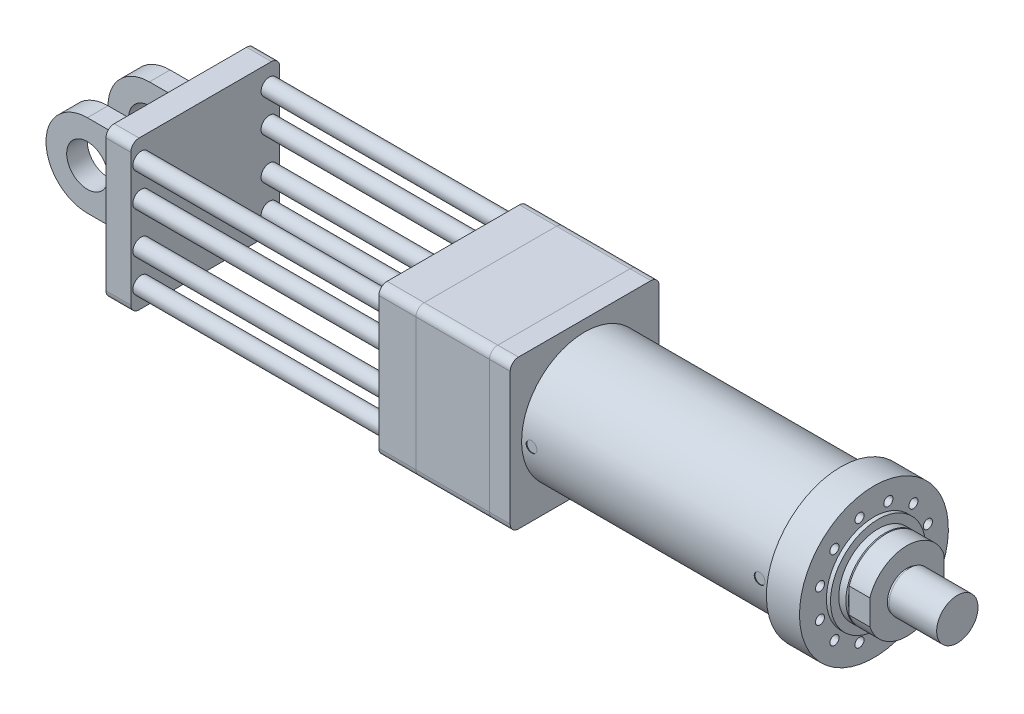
ISO-10303-21;
HEADER;
FILE_DESCRIPTION(('STEP AP214'),'2;1');
FILE_NAME('part.step','',(''),(''),'','','');
FILE_SCHEMA(('AUTOMOTIVE_DESIGN { 1 0 10303 214 1 1 1 1 }'));
ENDSEC;
DATA;
#1=APPLICATION_CONTEXT('core data for automotive mechanical design processes');
#2=APPLICATION_PROTOCOL_DEFINITION('international standard','automotive_design',2000,#1);
#3=PRODUCT_CONTEXT('',#1,'mechanical');
#4=PRODUCT('Part','Part','',(#3));
#5=PRODUCT_RELATED_PRODUCT_CATEGORY('part','',(#4));
#6=PRODUCT_DEFINITION_FORMATION('','',#4);
#7=PRODUCT_DEFINITION_CONTEXT('part definition',#1,'design');
#8=PRODUCT_DEFINITION('design','',#6,#7);
#9=PRODUCT_DEFINITION_SHAPE('','',#8);
#10=(LENGTH_UNIT() NAMED_UNIT(*) SI_UNIT(.MILLI.,.METRE.));
#11=(NAMED_UNIT(*) PLANE_ANGLE_UNIT() SI_UNIT($,.RADIAN.));
#12=(NAMED_UNIT(*) SI_UNIT($,.STERADIAN.) SOLID_ANGLE_UNIT());
#13=UNCERTAINTY_MEASURE_WITH_UNIT(LENGTH_MEASURE(1.E-05),#10,'distance_accuracy_value','');
#14=(GEOMETRIC_REPRESENTATION_CONTEXT(3) GLOBAL_UNCERTAINTY_ASSIGNED_CONTEXT((#13)) GLOBAL_UNIT_ASSIGNED_CONTEXT((#10,
#11,#12)) REPRESENTATION_CONTEXT('',''));
#15=CARTESIAN_POINT('',(0.,0.,0.));
#16=DIRECTION('',(0.,0.,1.));
#17=DIRECTION('',(1.,0.,0.));
#18=AXIS2_PLACEMENT_3D('',#15,#16,#17);
#19=CARTESIAN_POINT('',(-1202.5,99.9999999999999,-50.));
#20=DIRECTION('',(0.,0.,-1.));
#21=DIRECTION('',(0.,1.,0.));
#22=AXIS2_PLACEMENT_3D('',#19,#20,#21);
#23=PLANE('',#22);
#24=DIRECTION('',(1.,0.,0.));
#25=VECTOR('',#24,1.);
#26=CARTESIAN_POINT('',(-1202.5,99.9999999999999,-50.));
#27=LINE('',#26,#25);
#28=CARTESIAN_POINT('',(-1102.5,100.,-50.));
#29=VERTEX_POINT('',#28);
#30=CARTESIAN_POINT('',(-977.5,99.9999999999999,-50.));
#31=VERTEX_POINT('',#30);
#32=EDGE_CURVE('E257',#29,#31,#27,.T.);
#33=ORIENTED_EDGE('',*,*,#32,.F.);
#34=CARTESIAN_POINT('',(-1102.5,0.,-50.));
#35=DIRECTION('',(0.,0.,-1.));
#36=DIRECTION('',(0.,1.,0.));
#37=AXIS2_PLACEMENT_3D('',#34,#35,#36);
#38=CIRCLE('',#37,100.);
#39=CARTESIAN_POINT('',(-1102.5,-100.,-50.));
#40=VERTEX_POINT('',#39);
#41=EDGE_CURVE('E718',#29,#40,#38,.F.);
#42=ORIENTED_EDGE('',*,*,#41,.T.);
#43=DIRECTION('',(1.,0.,0.));
#44=VECTOR('',#43,1.);
#45=CARTESIAN_POINT('',(-1202.5,-100.,-50.));
#46=LINE('',#45,#44);
#47=CARTESIAN_POINT('',(-977.5,-100.,-50.));
#48=VERTEX_POINT('',#47);
#49=EDGE_CURVE('E251',#40,#48,#46,.T.);
#50=ORIENTED_EDGE('',*,*,#49,.T.);
#51=DIRECTION('',(0.,1.,0.));
#52=VECTOR('',#51,1.);
#53=CARTESIAN_POINT('',(-977.5,99.9999999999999,-50.));
#54=LINE('',#53,#52);
#55=EDGE_CURVE('E234',#48,#31,#54,.T.);
#56=ORIENTED_EDGE('',*,*,#55,.T.);
#57=EDGE_LOOP('',(#33,#42,#50,#56));
#58=FACE_BOUND('',#57,.T.);
#59=CARTESIAN_POINT('',(-1102.5,0.,-50.));
#60=DIRECTION('',(0.,0.,-1.));
#61=DIRECTION('',(0.,1.,0.));
#62=AXIS2_PLACEMENT_3D('',#59,#60,#61);
#63=CIRCLE('',#62,50.);
#64=CARTESIAN_POINT('',(-1102.5,50.,-50.));
#65=VERTEX_POINT('',#64);
#66=EDGE_CURVE('E696',#65,#65,#63,.T.);
#67=ORIENTED_EDGE('',*,*,#66,.T.);
#68=EDGE_LOOP('',(#67));
#69=FACE_BOUND('',#68,.T.);
#70=ADVANCED_FACE('F50',(#58,#69),#23,.F.);
#71=CARTESIAN_POINT('',(-1202.5,99.9999999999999,-100.));
#72=DIRECTION('',(0.,0.,1.));
#73=DIRECTION('',(0.,-1.,0.));
#74=AXIS2_PLACEMENT_3D('',#71,#72,#73);
#75=PLANE('',#74);
#76=DIRECTION('',(1.,0.,0.));
#77=VECTOR('',#76,1.);
#78=CARTESIAN_POINT('',(-1202.5,-100.,-100.));
#79=LINE('',#78,#77);
#80=CARTESIAN_POINT('',(-1102.5,-100.,-100.));
#81=VERTEX_POINT('',#80);
#82=CARTESIAN_POINT('',(-977.5,-100.,-100.));
#83=VERTEX_POINT('',#82);
#84=EDGE_CURVE('E253',#81,#83,#79,.T.);
#85=ORIENTED_EDGE('',*,*,#84,.F.);
#86=CARTESIAN_POINT('',(-1102.5,0.,-100.));
#87=DIRECTION('',(0.,0.,1.));
#88=DIRECTION('',(0.,-1.,0.));
#89=AXIS2_PLACEMENT_3D('',#86,#87,#88);
#90=CIRCLE('',#89,100.);
#91=CARTESIAN_POINT('',(-1102.5,100.,-100.));
#92=VERTEX_POINT('',#91);
#93=EDGE_CURVE('E66',#81,#92,#90,.F.);
#94=ORIENTED_EDGE('',*,*,#93,.T.);
#95=DIRECTION('',(1.,0.,0.));
#96=VECTOR('',#95,1.);
#97=CARTESIAN_POINT('',(-1202.5,99.9999999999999,-100.));
#98=LINE('',#97,#96);
#99=CARTESIAN_POINT('',(-977.5,99.9999999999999,-100.));
#100=VERTEX_POINT('',#99);
#101=EDGE_CURVE('E255',#92,#100,#98,.T.);
#102=ORIENTED_EDGE('',*,*,#101,.T.);
#103=DIRECTION('',(0.,-1.,0.));
#104=VECTOR('',#103,1.);
#105=CARTESIAN_POINT('',(-977.5,99.9999999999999,-100.));
#106=LINE('',#105,#104);
#107=EDGE_CURVE('E245',#100,#83,#106,.T.);
#108=ORIENTED_EDGE('',*,*,#107,.T.);
#109=EDGE_LOOP('',(#85,#94,#102,#108));
#110=FACE_BOUND('',#109,.T.);
#111=CARTESIAN_POINT('',(-1102.5,0.,-100.));
#112=DIRECTION('',(0.,0.,1.));
#113=DIRECTION('',(0.,-1.,0.));
#114=AXIS2_PLACEMENT_3D('',#111,#112,#113);
#115=CIRCLE('',#114,50.);
#116=CARTESIAN_POINT('',(-1102.5,-50.,-100.));
#117=VERTEX_POINT('',#116);
#118=EDGE_CURVE('E693',#117,#117,#115,.T.);
#119=ORIENTED_EDGE('',*,*,#118,.T.);
#120=EDGE_LOOP('',(#119));
#121=FACE_BOUND('',#120,.T.);
#122=ADVANCED_FACE('F473',(#110,#121),#75,.F.);
#123=CARTESIAN_POINT('',(-1202.5,100.,100.));
#124=DIRECTION('',(0.,0.,-1.));
#125=DIRECTION('',(0.,1.,0.));
#126=AXIS2_PLACEMENT_3D('',#123,#124,#125);
#127=PLANE('',#126);
#128=DIRECTION('',(1.,0.,0.));
#129=VECTOR('',#128,1.);
#130=CARTESIAN_POINT('',(-1202.5,100.,100.));
#131=LINE('',#130,#129);
#132=CARTESIAN_POINT('',(-1102.5,100.,100.));
#133=VERTEX_POINT('',#132);
#134=CARTESIAN_POINT('',(-977.5,100.,100.));
#135=VERTEX_POINT('',#134);
#136=EDGE_CURVE('E224',#133,#135,#131,.T.);
#137=ORIENTED_EDGE('',*,*,#136,.F.);
#138=CARTESIAN_POINT('',(-1102.5,0.,100.));
#139=DIRECTION('',(0.,0.,-1.));
#140=DIRECTION('',(1.,0.,0.));
#141=AXIS2_PLACEMENT_3D('',#138,#139,#140);
#142=CIRCLE('',#141,100.);
#143=CARTESIAN_POINT('',(-1102.5,-100.,100.));
#144=VERTEX_POINT('',#143);
#145=EDGE_CURVE('E210',#144,#133,#142,.T.);
#146=ORIENTED_EDGE('',*,*,#145,.F.);
#147=DIRECTION('',(1.,0.,0.));
#148=VECTOR('',#147,1.);
#149=CARTESIAN_POINT('',(-1202.5,-99.9999999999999,100.));
#150=LINE('',#149,#148);
#151=CARTESIAN_POINT('',(-977.5,-99.9999999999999,100.));
#152=VERTEX_POINT('',#151);
#153=EDGE_CURVE('E710',#144,#152,#150,.T.);
#154=ORIENTED_EDGE('',*,*,#153,.T.);
#155=DIRECTION('',(0.,1.,0.));
#156=VECTOR('',#155,1.);
#157=CARTESIAN_POINT('',(-977.5,100.,100.));
#158=LINE('',#157,#156);
#159=EDGE_CURVE('E232',#152,#135,#158,.T.);
#160=ORIENTED_EDGE('',*,*,#159,.T.);
#161=EDGE_LOOP('',(#137,#146,#154,#160));
#162=FACE_BOUND('',#161,.T.);
#163=CARTESIAN_POINT('',(-1102.5,0.,100.));
#164=DIRECTION('',(0.,0.,1.));
#165=DIRECTION('',(1.,0.,0.));
#166=AXIS2_PLACEMENT_3D('',#163,#164,#165);
#167=CIRCLE('',#166,50.);
#168=CARTESIAN_POINT('',(-1052.5,0.,100.));
#169=VERTEX_POINT('',#168);
#170=EDGE_CURVE('E219',#169,#169,#167,.T.);
#171=ORIENTED_EDGE('',*,*,#170,.F.);
#172=EDGE_LOOP('',(#171));
#173=FACE_BOUND('',#172,.T.);
#174=ADVANCED_FACE('F229',(#162,#173),#127,.F.);
#175=CARTESIAN_POINT('',(-1202.5,100.,50.));
#176=DIRECTION('',(0.,0.,1.));
#177=DIRECTION('',(0.,-1.,0.));
#178=AXIS2_PLACEMENT_3D('',#175,#176,#177);
#179=PLANE('',#178);
#180=DIRECTION('',(1.,0.,0.));
#181=VECTOR('',#180,1.);
#182=CARTESIAN_POINT('',(-1202.5,-99.9999999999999,50.));
#183=LINE('',#182,#181);
#184=CARTESIAN_POINT('',(-1102.5,-99.9999999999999,50.));
#185=VERTEX_POINT('',#184);
#186=CARTESIAN_POINT('',(-977.5,-99.9999999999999,50.));
#187=VERTEX_POINT('',#186);
#188=EDGE_CURVE('E239',#185,#187,#183,.T.);
#189=ORIENTED_EDGE('',*,*,#188,.F.);
#190=CARTESIAN_POINT('',(-1102.5,0.,50.));
#191=DIRECTION('',(0.,0.,1.));
#192=DIRECTION('',(0.,-1.,0.));
#193=AXIS2_PLACEMENT_3D('',#190,#191,#192);
#194=CIRCLE('',#193,100.);
#195=CARTESIAN_POINT('',(-1102.5,100.,50.));
#196=VERTEX_POINT('',#195);
#197=EDGE_CURVE('E74',#185,#196,#194,.F.);
#198=ORIENTED_EDGE('',*,*,#197,.T.);
#199=DIRECTION('',(1.,0.,0.));
#200=VECTOR('',#199,1.);
#201=CARTESIAN_POINT('',(-1202.5,100.,50.));
#202=LINE('',#201,#200);
#203=CARTESIAN_POINT('',(-977.5,100.,50.));
#204=VERTEX_POINT('',#203);
#205=EDGE_CURVE('E226',#196,#204,#202,.T.);
#206=ORIENTED_EDGE('',*,*,#205,.T.);
#207=DIRECTION('',(0.,-1.,0.));
#208=VECTOR('',#207,1.);
#209=CARTESIAN_POINT('',(-977.5,100.,50.));
#210=LINE('',#209,#208);
#211=EDGE_CURVE('E704',#204,#187,#210,.T.);
#212=ORIENTED_EDGE('',*,*,#211,.T.);
#213=EDGE_LOOP('',(#189,#198,#206,#212));
#214=FACE_BOUND('',#213,.T.);
#215=CARTESIAN_POINT('',(-1102.5,0.,50.));
#216=DIRECTION('',(0.,0.,1.));
#217=DIRECTION('',(0.,-1.,0.));
#218=AXIS2_PLACEMENT_3D('',#215,#216,#217);
#219=CIRCLE('',#218,50.);
#220=CARTESIAN_POINT('',(-1102.5,-50.,50.));
#221=VERTEX_POINT('',#220);
#222=EDGE_CURVE('E54',#221,#221,#219,.T.);
#223=ORIENTED_EDGE('',*,*,#222,.T.);
#224=EDGE_LOOP('',(#223));
#225=FACE_BOUND('',#224,.T.);
#226=ADVANCED_FACE('F487',(#214,#225),#179,.F.);
#227=CARTESIAN_POINT('',(-977.5,0.,0.));
#228=DIRECTION('',(-1.,0.,0.));
#229=DIRECTION('',(0.,0.,1.));
#230=AXIS2_PLACEMENT_3D('',#227,#228,#229);
#231=PLANE('',#230);
#232=DIRECTION('',(0.,-1.,0.));
#233=VECTOR('',#232,1.);
#234=CARTESIAN_POINT('',(-977.5,180.,-180.));
#235=LINE('',#234,#233);
#236=CARTESIAN_POINT('',(-977.5,160.,-180.));
#237=VERTEX_POINT('',#236);
#238=CARTESIAN_POINT('',(-977.5,-160.,-180.));
#239=VERTEX_POINT('',#238);
#240=EDGE_CURVE('E267',#237,#239,#235,.T.);
#241=ORIENTED_EDGE('',*,*,#240,.T.);
#242=CARTESIAN_POINT('',(-977.5,-160.,-160.));
#243=DIRECTION('',(-1.,0.,0.));
#244=DIRECTION('',(0.,0.,1.));
#245=AXIS2_PLACEMENT_3D('',#242,#243,#244);
#246=CIRCLE('',#245,20.);
#247=CARTESIAN_POINT('',(-977.5,-180.,-160.));
#248=VERTEX_POINT('',#247);
#249=EDGE_CURVE('E415',#239,#248,#246,.T.);
#250=ORIENTED_EDGE('',*,*,#249,.T.);
#251=DIRECTION('',(0.,0.,1.));
#252=VECTOR('',#251,1.);
#253=CARTESIAN_POINT('',(-977.5,-180.,-180.));
#254=LINE('',#253,#252);
#255=CARTESIAN_POINT('',(-977.5,-180.,160.));
#256=VERTEX_POINT('',#255);
#257=EDGE_CURVE('E270',#248,#256,#254,.T.);
#258=ORIENTED_EDGE('',*,*,#257,.T.);
#259=CARTESIAN_POINT('',(-977.5,-160.,160.));
#260=DIRECTION('',(-1.,0.,0.));
#261=DIRECTION('',(0.,0.,1.));
#262=AXIS2_PLACEMENT_3D('',#259,#260,#261);
#263=CIRCLE('',#262,20.);
#264=CARTESIAN_POINT('',(-977.5,-160.,180.));
#265=VERTEX_POINT('',#264);
#266=EDGE_CURVE('E413',#256,#265,#263,.T.);
#267=ORIENTED_EDGE('',*,*,#266,.T.);
#268=DIRECTION('',(0.,1.,0.));
#269=VECTOR('',#268,1.);
#270=CARTESIAN_POINT('',(-977.5,180.,180.));
#271=LINE('',#270,#269);
#272=CARTESIAN_POINT('',(-977.5,160.,180.));
#273=VERTEX_POINT('',#272);
#274=EDGE_CURVE('E260',#265,#273,#271,.T.);
#275=ORIENTED_EDGE('',*,*,#274,.T.);
#276=CARTESIAN_POINT('',(-977.5,160.,160.));
#277=DIRECTION('',(-1.,0.,0.));
#278=DIRECTION('',(0.,0.,1.));
#279=AXIS2_PLACEMENT_3D('',#276,#277,#278);
#280=CIRCLE('',#279,20.);
#281=CARTESIAN_POINT('',(-977.5,180.,160.));
#282=VERTEX_POINT('',#281);
#283=EDGE_CURVE('E409',#273,#282,#280,.T.);
#284=ORIENTED_EDGE('',*,*,#283,.T.);
#285=DIRECTION('',(0.,0.,-1.));
#286=VECTOR('',#285,1.);
#287=CARTESIAN_POINT('',(-977.5,180.,-180.));
#288=LINE('',#287,#286);
#289=CARTESIAN_POINT('',(-977.5,180.,-160.));
#290=VERTEX_POINT('',#289);
#291=EDGE_CURVE('E263',#282,#290,#288,.T.);
#292=ORIENTED_EDGE('',*,*,#291,.T.);
#293=CARTESIAN_POINT('',(-977.5,160.,-160.));
#294=DIRECTION('',(-1.,0.,0.));
#295=DIRECTION('',(0.,0.,1.));
#296=AXIS2_PLACEMENT_3D('',#293,#294,#295);
#297=CIRCLE('',#296,20.);
#298=EDGE_CURVE('E411',#290,#237,#297,.T.);
#299=ORIENTED_EDGE('',*,*,#298,.T.);
#300=EDGE_LOOP('',(#241,#250,#258,#267,#275,#284,#292,#299));
#301=FACE_BOUND('',#300,.T.);
#302=DIRECTION('',(0.,0.,-1.));
#303=VECTOR('',#302,1.);
#304=CARTESIAN_POINT('',(-977.5,99.9999999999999,-100.));
#305=LINE('',#304,#303);
#306=EDGE_CURVE('E237',#31,#100,#305,.T.);
#307=ORIENTED_EDGE('',*,*,#306,.F.);
#308=ORIENTED_EDGE('',*,*,#55,.F.);
#309=DIRECTION('',(0.,0.,1.));
#310=VECTOR('',#309,1.);
#311=CARTESIAN_POINT('',(-977.5,-100.,-100.));
#312=LINE('',#311,#310);
#313=EDGE_CURVE('E248',#83,#48,#312,.T.);
#314=ORIENTED_EDGE('',*,*,#313,.F.);
#315=ORIENTED_EDGE('',*,*,#107,.F.);
#316=EDGE_LOOP('',(#307,#308,#314,#315));
#317=FACE_BOUND('',#316,.T.);
#318=DIRECTION('',(0.,0.,-1.));
#319=VECTOR('',#318,1.);
#320=CARTESIAN_POINT('',(-977.5,100.,50.));
#321=LINE('',#320,#319);
#322=EDGE_CURVE('E698',#135,#204,#321,.T.);
#323=ORIENTED_EDGE('',*,*,#322,.F.);
#324=ORIENTED_EDGE('',*,*,#159,.F.);
#325=DIRECTION('',(0.,0.,1.));
#326=VECTOR('',#325,1.);
#327=CARTESIAN_POINT('',(-977.5,-99.9999999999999,50.));
#328=LINE('',#327,#326);
#329=EDGE_CURVE('E707',#187,#152,#328,.T.);
#330=ORIENTED_EDGE('',*,*,#329,.F.);
#331=ORIENTED_EDGE('',*,*,#211,.F.);
#332=EDGE_LOOP('',(#323,#324,#330,#331));
#333=FACE_BOUND('',#332,.T.);
#334=ADVANCED_FACE('F446',(#301,#317,#333),#231,.T.);
#335=CARTESIAN_POINT('',(-317.5,180.,180.));
#336=DIRECTION('',(0.,0.,-1.));
#337=DIRECTION('',(-1.,0.,0.));
#338=AXIS2_PLACEMENT_3D('',#335,#336,#337);
#339=PLANE('',#338);
#340=DIRECTION('',(0.,1.,0.));
#341=VECTOR('',#340,1.);
#342=CARTESIAN_POINT('',(-317.5,180.,180.));
#343=LINE('',#342,#341);
#344=CARTESIAN_POINT('',(-317.5,-160.,180.));
#345=VERTEX_POINT('',#344);
#346=CARTESIAN_POINT('',(-317.5,160.,180.));
#347=VERTEX_POINT('',#346);
#348=EDGE_CURVE('E332',#345,#347,#343,.T.);
#349=ORIENTED_EDGE('',*,*,#348,.F.);
#350=DIRECTION('',(1.,0.,0.));
#351=VECTOR('',#350,1.);
#352=CARTESIAN_POINT('',(-317.5,-160.,180.));
#353=LINE('',#352,#351);
#354=CARTESIAN_POINT('',(-228.,-160.,180.));
#355=VERTEX_POINT('',#354);
#356=EDGE_CURVE('E357',#345,#355,#353,.T.);
#357=ORIENTED_EDGE('',*,*,#356,.T.);
#358=DIRECTION('',(0.,1.,0.));
#359=VECTOR('',#358,1.);
#360=CARTESIAN_POINT('',(-228.,180.,180.));
#361=LINE('',#360,#359);
#362=CARTESIAN_POINT('',(-228.,160.,180.));
#363=VERTEX_POINT('',#362);
#364=EDGE_CURVE('E329',#355,#363,#361,.T.);
#365=ORIENTED_EDGE('',*,*,#364,.T.);
#366=DIRECTION('',(1.,0.,0.));
#367=VECTOR('',#366,1.);
#368=CARTESIAN_POINT('',(-317.5,160.,180.));
#369=LINE('',#368,#367);
#370=EDGE_CURVE('E345',#363,#347,#369,.F.);
#371=ORIENTED_EDGE('',*,*,#370,.T.);
#372=EDGE_LOOP('',(#349,#357,#365,#371));
#373=FACE_BOUND('',#372,.T.);
#374=ADVANCED_FACE('F486',(#373),#339,.F.);
#375=CARTESIAN_POINT('',(-317.5,180.,-180.));
#376=DIRECTION('',(0.,-1.,0.));
#377=DIRECTION('',(1.,0.,0.));
#378=AXIS2_PLACEMENT_3D('',#375,#376,#377);
#379=PLANE('',#378);
#380=DIRECTION('',(0.,0.,-1.));
#381=VECTOR('',#380,1.);
#382=CARTESIAN_POINT('',(-317.5,180.,-180.));
#383=LINE('',#382,#381);
#384=CARTESIAN_POINT('',(-317.5,180.,160.));
#385=VERTEX_POINT('',#384);
#386=CARTESIAN_POINT('',(-317.5,180.,-160.));
#387=VERTEX_POINT('',#386);
#388=EDGE_CURVE('E335',#385,#387,#383,.T.);
#389=ORIENTED_EDGE('',*,*,#388,.F.);
#390=DIRECTION('',(1.,0.,0.));
#391=VECTOR('',#390,1.);
#392=CARTESIAN_POINT('',(-317.5,180.,160.));
#393=LINE('',#392,#391);
#394=CARTESIAN_POINT('',(-228.,180.,160.));
#395=VERTEX_POINT('',#394);
#396=EDGE_CURVE('E383',#385,#395,#393,.T.);
#397=ORIENTED_EDGE('',*,*,#396,.T.);
#398=DIRECTION('',(0.,0.,-1.));
#399=VECTOR('',#398,1.);
#400=CARTESIAN_POINT('',(-228.,180.,-180.));
#401=LINE('',#400,#399);
#402=CARTESIAN_POINT('',(-228.,180.,-160.));
#403=VERTEX_POINT('',#402);
#404=EDGE_CURVE('E348',#395,#403,#401,.T.);
#405=ORIENTED_EDGE('',*,*,#404,.T.);
#406=DIRECTION('',(1.,0.,0.));
#407=VECTOR('',#406,1.);
#408=CARTESIAN_POINT('',(-317.5,180.,-160.));
#409=LINE('',#408,#407);
#410=EDGE_CURVE('E381',#403,#387,#409,.F.);
#411=ORIENTED_EDGE('',*,*,#410,.T.);
#412=EDGE_LOOP('',(#389,#397,#405,#411));
#413=FACE_BOUND('',#412,.T.);
#414=ADVANCED_FACE('F548',(#413),#379,.F.);
#415=CARTESIAN_POINT('',(-317.5,180.,-180.));
#416=DIRECTION('',(0.,0.,1.));
#417=DIRECTION('',(1.,0.,0.));
#418=AXIS2_PLACEMENT_3D('',#415,#416,#417);
#419=PLANE('',#418);
#420=DIRECTION('',(0.,-1.,0.));
#421=VECTOR('',#420,1.);
#422=CARTESIAN_POINT('',(-228.,180.,-180.));
#423=LINE('',#422,#421);
#424=CARTESIAN_POINT('',(-228.,160.,-180.));
#425=VERTEX_POINT('',#424);
#426=CARTESIAN_POINT('',(-228.,-160.,-180.));
#427=VERTEX_POINT('',#426);
#428=EDGE_CURVE('E351',#425,#427,#423,.T.);
#429=ORIENTED_EDGE('',*,*,#428,.T.);
#430=DIRECTION('',(1.,0.,0.));
#431=VECTOR('',#430,1.);
#432=CARTESIAN_POINT('',(-317.5,-160.,-180.));
#433=LINE('',#432,#431);
#434=CARTESIAN_POINT('',(-317.5,-160.,-180.));
#435=VERTEX_POINT('',#434);
#436=EDGE_CURVE('E389',#427,#435,#433,.F.);
#437=ORIENTED_EDGE('',*,*,#436,.T.);
#438=DIRECTION('',(0.,-1.,0.));
#439=VECTOR('',#438,1.);
#440=CARTESIAN_POINT('',(-317.5,180.,-180.));
#441=LINE('',#440,#439);
#442=CARTESIAN_POINT('',(-317.5,160.,-180.));
#443=VERTEX_POINT('',#442);
#444=EDGE_CURVE('E339',#443,#435,#441,.T.);
#445=ORIENTED_EDGE('',*,*,#444,.F.);
#446=DIRECTION('',(1.,0.,0.));
#447=VECTOR('',#446,1.);
#448=CARTESIAN_POINT('',(-317.5,160.,-180.));
#449=LINE('',#448,#447);
#450=EDGE_CURVE('E386',#443,#425,#449,.T.);
#451=ORIENTED_EDGE('',*,*,#450,.T.);
#452=EDGE_LOOP('',(#429,#437,#445,#451));
#453=FACE_BOUND('',#452,.T.);
#454=ADVANCED_FACE('F544',(#453),#419,.F.);
#455=CARTESIAN_POINT('',(-317.5,-180.,-180.));
#456=DIRECTION('',(0.,1.,0.));
#457=DIRECTION('',(-1.,0.,0.));
#458=AXIS2_PLACEMENT_3D('',#455,#456,#457);
#459=PLANE('',#458);
#460=DIRECTION('',(0.,0.,1.));
#461=VECTOR('',#460,1.);
#462=CARTESIAN_POINT('',(-228.,-180.,-180.));
#463=LINE('',#462,#461);
#464=CARTESIAN_POINT('',(-228.,-180.,-160.));
#465=VERTEX_POINT('',#464);
#466=CARTESIAN_POINT('',(-228.,-180.,160.));
#467=VERTEX_POINT('',#466);
#468=EDGE_CURVE('E336',#465,#467,#463,.T.);
#469=ORIENTED_EDGE('',*,*,#468,.T.);
#470=DIRECTION('',(1.,0.,0.));
#471=VECTOR('',#470,1.);
#472=CARTESIAN_POINT('',(-317.5,-180.,160.));
#473=LINE('',#472,#471);
#474=CARTESIAN_POINT('',(-317.5,-180.,160.));
#475=VERTEX_POINT('',#474);
#476=EDGE_CURVE('E371',#467,#475,#473,.F.);
#477=ORIENTED_EDGE('',*,*,#476,.T.);
#478=DIRECTION('',(0.,0.,1.));
#479=VECTOR('',#478,1.);
#480=CARTESIAN_POINT('',(-317.5,-180.,-180.));
#481=LINE('',#480,#479);
#482=CARTESIAN_POINT('',(-317.5,-180.,-160.));
#483=VERTEX_POINT('',#482);
#484=EDGE_CURVE('E342',#483,#475,#481,.T.);
#485=ORIENTED_EDGE('',*,*,#484,.F.);
#486=DIRECTION('',(1.,0.,0.));
#487=VECTOR('',#486,1.);
#488=CARTESIAN_POINT('',(-317.5,-180.,-160.));
#489=LINE('',#488,#487);
#490=EDGE_CURVE('E368',#483,#465,#489,.T.);
#491=ORIENTED_EDGE('',*,*,#490,.T.);
#492=EDGE_LOOP('',(#469,#477,#485,#491));
#493=FACE_BOUND('',#492,.T.);
#494=ADVANCED_FACE('F536',(#493),#459,.F.);
#495=CARTESIAN_POINT('',(-317.5,0.,0.));
#496=DIRECTION('',(-1.,0.,0.));
#497=DIRECTION('',(0.,-1.,0.));
#498=AXIS2_PLACEMENT_3D('',#495,#496,#497);
#499=PLANE('',#498);
#500=CARTESIAN_POINT('',(-317.5,130.,155.));
#501=DIRECTION('',(-1.,0.,0.));
#502=DIRECTION('',(0.,1.,0.));
#503=AXIS2_PLACEMENT_3D('',#500,#501,#502);
#504=CIRCLE('',#503,20.);
#505=CARTESIAN_POINT('',(-317.5,150.,155.));
#506=VERTEX_POINT('',#505);
#507=EDGE_CURVE('E273',#506,#506,#504,.T.);
#508=ORIENTED_EDGE('',*,*,#507,.F.);
#509=EDGE_LOOP('',(#508));
#510=FACE_BOUND('',#509,.T.);
#511=CARTESIAN_POINT('',(-317.5,50.0000000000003,155.));
#512=DIRECTION('',(-1.,0.,0.));
#513=DIRECTION('',(0.,1.,0.));
#514=AXIS2_PLACEMENT_3D('',#511,#512,#513);
#515=CIRCLE('',#514,20.);
#516=CARTESIAN_POINT('',(-317.5,70.0000000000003,155.));
#517=VERTEX_POINT('',#516);
#518=EDGE_CURVE('E287',#517,#517,#515,.T.);
#519=ORIENTED_EDGE('',*,*,#518,.F.);
#520=EDGE_LOOP('',(#519));
#521=FACE_BOUND('',#520,.T.);
#522=CARTESIAN_POINT('',(-317.5,-49.9999999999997,155.));
#523=DIRECTION('',(-1.,0.,0.));
#524=DIRECTION('',(0.,1.,0.));
#525=AXIS2_PLACEMENT_3D('',#522,#523,#524);
#526=CIRCLE('',#525,20.);
#527=CARTESIAN_POINT('',(-317.5,-29.9999999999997,155.));
#528=VERTEX_POINT('',#527);
#529=EDGE_CURVE('E293',#528,#528,#526,.T.);
#530=ORIENTED_EDGE('',*,*,#529,.F.);
#531=EDGE_LOOP('',(#530));
#532=FACE_BOUND('',#531,.T.);
#533=CARTESIAN_POINT('',(-317.5,-130.,155.));
#534=DIRECTION('',(-1.,0.,0.));
#535=DIRECTION('',(0.,1.,0.));
#536=AXIS2_PLACEMENT_3D('',#533,#534,#535);
#537=CIRCLE('',#536,20.);
#538=CARTESIAN_POINT('',(-317.5,-110.,155.));
#539=VERTEX_POINT('',#538);
#540=EDGE_CURVE('E299',#539,#539,#537,.T.);
#541=ORIENTED_EDGE('',*,*,#540,.F.);
#542=EDGE_LOOP('',(#541));
#543=FACE_BOUND('',#542,.T.);
#544=CARTESIAN_POINT('',(-317.5,-130.,-155.));
#545=DIRECTION('',(-1.,0.,0.));
#546=DIRECTION('',(0.,-1.,0.));
#547=AXIS2_PLACEMENT_3D('',#544,#545,#546);
#548=CIRCLE('',#547,20.);
#549=CARTESIAN_POINT('',(-317.5,-150.,-155.));
#550=VERTEX_POINT('',#549);
#551=EDGE_CURVE('E305',#550,#550,#548,.T.);
#552=ORIENTED_EDGE('',*,*,#551,.F.);
#553=EDGE_LOOP('',(#552));
#554=FACE_BOUND('',#553,.T.);
#555=CARTESIAN_POINT('',(-317.5,-50.,-155.));
#556=DIRECTION('',(-1.,0.,0.));
#557=DIRECTION('',(0.,-1.,0.));
#558=AXIS2_PLACEMENT_3D('',#555,#556,#557);
#559=CIRCLE('',#558,20.);
#560=CARTESIAN_POINT('',(-317.5,-69.9999999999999,-155.));
#561=VERTEX_POINT('',#560);
#562=EDGE_CURVE('E311',#561,#561,#559,.T.);
#563=ORIENTED_EDGE('',*,*,#562,.F.);
#564=EDGE_LOOP('',(#563));
#565=FACE_BOUND('',#564,.T.);
#566=CARTESIAN_POINT('',(-317.5,50.,-155.));
#567=DIRECTION('',(-1.,0.,0.));
#568=DIRECTION('',(0.,-1.,0.));
#569=AXIS2_PLACEMENT_3D('',#566,#567,#568);
#570=CIRCLE('',#569,20.);
#571=CARTESIAN_POINT('',(-317.5,30.0000000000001,-155.));
#572=VERTEX_POINT('',#571);
#573=EDGE_CURVE('E317',#572,#572,#570,.T.);
#574=ORIENTED_EDGE('',*,*,#573,.F.);
#575=EDGE_LOOP('',(#574));
#576=FACE_BOUND('',#575,.T.);
#577=CARTESIAN_POINT('',(-317.5,130.,-155.));
#578=DIRECTION('',(-1.,0.,0.));
#579=DIRECTION('',(0.,-1.,0.));
#580=AXIS2_PLACEMENT_3D('',#577,#578,#579);
#581=CIRCLE('',#580,20.);
#582=CARTESIAN_POINT('',(-317.5,110.,-155.));
#583=VERTEX_POINT('',#582);
#584=EDGE_CURVE('E323',#583,#583,#581,.T.);
#585=ORIENTED_EDGE('',*,*,#584,.F.);
#586=EDGE_LOOP('',(#585));
#587=FACE_BOUND('',#586,.T.);
#588=ORIENTED_EDGE('',*,*,#484,.T.);
#589=CARTESIAN_POINT('',(-317.5,-160.,160.));
#590=DIRECTION('',(-1.,0.,0.));
#591=DIRECTION('',(0.,-1.,0.));
#592=AXIS2_PLACEMENT_3D('',#589,#590,#591);
#593=CIRCLE('',#592,20.);
#594=EDGE_CURVE('E379',#475,#345,#593,.T.);
#595=ORIENTED_EDGE('',*,*,#594,.T.);
#596=ORIENTED_EDGE('',*,*,#348,.T.);
#597=CARTESIAN_POINT('',(-317.5,160.,160.));
#598=DIRECTION('',(-1.,0.,0.));
#599=DIRECTION('',(0.,-1.,0.));
#600=AXIS2_PLACEMENT_3D('',#597,#598,#599);
#601=CIRCLE('',#600,20.);
#602=EDGE_CURVE('E377',#347,#385,#601,.T.);
#603=ORIENTED_EDGE('',*,*,#602,.T.);
#604=ORIENTED_EDGE('',*,*,#388,.T.);
#605=CARTESIAN_POINT('',(-317.5,160.,-160.));
#606=DIRECTION('',(-1.,0.,0.));
#607=DIRECTION('',(0.,-1.,0.));
#608=AXIS2_PLACEMENT_3D('',#605,#606,#607);
#609=CIRCLE('',#608,20.);
#610=EDGE_CURVE('E373',#387,#443,#609,.T.);
#611=ORIENTED_EDGE('',*,*,#610,.T.);
#612=ORIENTED_EDGE('',*,*,#444,.T.);
#613=CARTESIAN_POINT('',(-317.5,-160.,-160.));
#614=DIRECTION('',(-1.,0.,0.));
#615=DIRECTION('',(0.,-1.,0.));
#616=AXIS2_PLACEMENT_3D('',#613,#614,#615);
#617=CIRCLE('',#616,20.);
#618=EDGE_CURVE('E375',#435,#483,#617,.T.);
#619=ORIENTED_EDGE('',*,*,#618,.T.);
#620=EDGE_LOOP('',(#588,#595,#596,#603,#604,#611,#612,#619));
#621=FACE_BOUND('',#620,.T.);
#622=ADVANCED_FACE('F532',(#510,#521,#532,#543,#554,#565,#576,#587,#621),#499,.T.);
#623=CARTESIAN_POINT('',(-228.,0.,0.));
#624=DIRECTION('',(-1.,0.,0.));
#625=DIRECTION('',(0.,-1.,0.));
#626=AXIS2_PLACEMENT_3D('',#623,#624,#625);
#627=PLANE('',#626);
#628=ORIENTED_EDGE('',*,*,#364,.F.);
#629=CARTESIAN_POINT('',(-228.,-160.,160.));
#630=DIRECTION('',(-1.,0.,0.));
#631=DIRECTION('',(0.,-1.,0.));
#632=AXIS2_PLACEMENT_3D('',#629,#630,#631);
#633=CIRCLE('',#632,20.);
#634=EDGE_CURVE('E366',#355,#467,#633,.F.);
#635=ORIENTED_EDGE('',*,*,#634,.T.);
#636=ORIENTED_EDGE('',*,*,#468,.F.);
#637=CARTESIAN_POINT('',(-228.,-160.,-160.));
#638=DIRECTION('',(-1.,0.,0.));
#639=DIRECTION('',(0.,-1.,0.));
#640=AXIS2_PLACEMENT_3D('',#637,#638,#639);
#641=CIRCLE('',#640,20.);
#642=EDGE_CURVE('E362',#465,#427,#641,.F.);
#643=ORIENTED_EDGE('',*,*,#642,.T.);
#644=ORIENTED_EDGE('',*,*,#428,.F.);
#645=CARTESIAN_POINT('',(-228.,160.,-160.));
#646=DIRECTION('',(-1.,0.,0.));
#647=DIRECTION('',(0.,-1.,0.));
#648=AXIS2_PLACEMENT_3D('',#645,#646,#647);
#649=CIRCLE('',#648,20.);
#650=EDGE_CURVE('E360',#425,#403,#649,.F.);
#651=ORIENTED_EDGE('',*,*,#650,.T.);
#652=ORIENTED_EDGE('',*,*,#404,.F.);
#653=CARTESIAN_POINT('',(-228.,160.,160.));
#654=DIRECTION('',(-1.,0.,0.));
#655=DIRECTION('',(0.,-1.,0.));
#656=AXIS2_PLACEMENT_3D('',#653,#654,#655);
#657=CIRCLE('',#656,20.);
#658=EDGE_CURVE('E364',#395,#363,#657,.F.);
#659=ORIENTED_EDGE('',*,*,#658,.T.);
#660=EDGE_LOOP('',(#628,#635,#636,#643,#644,#651,#652,#659));
#661=FACE_BOUND('',#660,.T.);
#662=ADVANCED_FACE('F535',(#661),#627,.F.);
#663=CARTESIAN_POINT('',(-317.5,-160.,160.));
#664=DIRECTION('',(1.,0.,0.));
#665=DIRECTION('',(0.,1.,0.));
#666=AXIS2_PLACEMENT_3D('',#663,#664,#665);
#667=CYLINDRICAL_SURFACE('',#666,20.);
#668=ORIENTED_EDGE('',*,*,#594,.F.);
#669=ORIENTED_EDGE('',*,*,#476,.F.);
#670=ORIENTED_EDGE('',*,*,#634,.F.);
#671=ORIENTED_EDGE('',*,*,#356,.F.);
#672=EDGE_LOOP('',(#668,#669,#670,#671));
#673=FACE_BOUND('',#672,.T.);
#674=ADVANCED_FACE('F540',(#673),#667,.T.);
#675=CARTESIAN_POINT('',(-317.5,160.,160.));
#676=DIRECTION('',(1.,0.,0.));
#677=DIRECTION('',(0.,1.,0.));
#678=AXIS2_PLACEMENT_3D('',#675,#676,#677);
#679=CYLINDRICAL_SURFACE('',#678,20.);
#680=ORIENTED_EDGE('',*,*,#602,.F.);
#681=ORIENTED_EDGE('',*,*,#370,.F.);
#682=ORIENTED_EDGE('',*,*,#658,.F.);
#683=ORIENTED_EDGE('',*,*,#396,.F.);
#684=EDGE_LOOP('',(#680,#681,#682,#683));
#685=FACE_BOUND('',#684,.T.);
#686=ADVANCED_FACE('F558',(#685),#679,.T.);
#687=CARTESIAN_POINT('',(-317.5,-160.,-160.));
#688=DIRECTION('',(1.,0.,0.));
#689=DIRECTION('',(0.,1.,0.));
#690=AXIS2_PLACEMENT_3D('',#687,#688,#689);
#691=CYLINDRICAL_SURFACE('',#690,20.);
#692=ORIENTED_EDGE('',*,*,#618,.F.);
#693=ORIENTED_EDGE('',*,*,#436,.F.);
#694=ORIENTED_EDGE('',*,*,#642,.F.);
#695=ORIENTED_EDGE('',*,*,#490,.F.);
#696=EDGE_LOOP('',(#692,#693,#694,#695));
#697=FACE_BOUND('',#696,.T.);
#698=ADVANCED_FACE('F562',(#697),#691,.T.);
#699=CARTESIAN_POINT('',(-317.5,160.,-160.));
#700=DIRECTION('',(1.,0.,0.));
#701=DIRECTION('',(0.,1.,0.));
#702=AXIS2_PLACEMENT_3D('',#699,#700,#701);
#703=CYLINDRICAL_SURFACE('',#702,20.);
#704=ORIENTED_EDGE('',*,*,#610,.F.);
#705=ORIENTED_EDGE('',*,*,#410,.F.);
#706=ORIENTED_EDGE('',*,*,#650,.F.);
#707=ORIENTED_EDGE('',*,*,#450,.F.);
#708=EDGE_LOOP('',(#704,#705,#706,#707));
#709=FACE_BOUND('',#708,.T.);
#710=ADVANCED_FACE('F530',(#709),#703,.T.);
#711=CARTESIAN_POINT('',(-917.5,130.,-155.));
#712=DIRECTION('',(1.,0.,0.));
#713=DIRECTION('',(0.,1.,0.));
#714=AXIS2_PLACEMENT_3D('',#711,#712,#713);
#715=CYLINDRICAL_SURFACE('',#714,20.);
#716=CARTESIAN_POINT('',(-917.5,130.,-155.));
#717=DIRECTION('',(-1.,0.,0.));
#718=DIRECTION('',(0.,-1.,0.));
#719=AXIS2_PLACEMENT_3D('',#716,#717,#718);
#720=CIRCLE('',#719,20.);
#721=CARTESIAN_POINT('',(-917.5,110.,-155.));
#722=VERTEX_POINT('',#721);
#723=EDGE_CURVE('E326',#722,#722,#720,.T.);
#724=ORIENTED_EDGE('',*,*,#723,.F.);
#725=EDGE_LOOP('',(#724));
#726=FACE_BOUND('',#725,.T.);
#727=ORIENTED_EDGE('',*,*,#584,.T.);
#728=EDGE_LOOP('',(#727));
#729=FACE_BOUND('',#728,.T.);
#730=ADVANCED_FACE('F526',(#726,#729),#715,.T.);
#731=CARTESIAN_POINT('',(-917.5,50.0000000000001,-155.));
#732=DIRECTION('',(1.,0.,0.));
#733=DIRECTION('',(0.,1.,0.));
#734=AXIS2_PLACEMENT_3D('',#731,#732,#733);
#735=CYLINDRICAL_SURFACE('',#734,20.);
#736=CARTESIAN_POINT('',(-917.5,50.0000000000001,-155.));
#737=DIRECTION('',(-1.,0.,0.));
#738=DIRECTION('',(0.,-1.,0.));
#739=AXIS2_PLACEMENT_3D('',#736,#737,#738);
#740=CIRCLE('',#739,20.);
#741=CARTESIAN_POINT('',(-917.5,30.0000000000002,-155.));
#742=VERTEX_POINT('',#741);
#743=EDGE_CURVE('E320',#742,#742,#740,.T.);
#744=ORIENTED_EDGE('',*,*,#743,.F.);
#745=EDGE_LOOP('',(#744));
#746=FACE_BOUND('',#745,.T.);
#747=ORIENTED_EDGE('',*,*,#573,.T.);
#748=EDGE_LOOP('',(#747));
#749=FACE_BOUND('',#748,.T.);
#750=ADVANCED_FACE('F522',(#746,#749),#735,.T.);
#751=CARTESIAN_POINT('',(-917.5,-49.9999999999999,-155.));
#752=DIRECTION('',(1.,0.,0.));
#753=DIRECTION('',(0.,1.,0.));
#754=AXIS2_PLACEMENT_3D('',#751,#752,#753);
#755=CYLINDRICAL_SURFACE('',#754,20.);
#756=CARTESIAN_POINT('',(-917.5,-49.9999999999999,-155.));
#757=DIRECTION('',(-1.,0.,0.));
#758=DIRECTION('',(0.,-1.,0.));
#759=AXIS2_PLACEMENT_3D('',#756,#757,#758);
#760=CIRCLE('',#759,20.);
#761=CARTESIAN_POINT('',(-917.5,-69.9999999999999,-155.));
#762=VERTEX_POINT('',#761);
#763=EDGE_CURVE('E314',#762,#762,#760,.T.);
#764=ORIENTED_EDGE('',*,*,#763,.F.);
#765=EDGE_LOOP('',(#764));
#766=FACE_BOUND('',#765,.T.);
#767=ORIENTED_EDGE('',*,*,#562,.T.);
#768=EDGE_LOOP('',(#767));
#769=FACE_BOUND('',#768,.T.);
#770=ADVANCED_FACE('F518',(#766,#769),#755,.T.);
#771=CARTESIAN_POINT('',(-917.5,-130.,-155.));
#772=DIRECTION('',(1.,0.,0.));
#773=DIRECTION('',(0.,1.,0.));
#774=AXIS2_PLACEMENT_3D('',#771,#772,#773);
#775=CYLINDRICAL_SURFACE('',#774,20.);
#776=CARTESIAN_POINT('',(-917.5,-130.,-155.));
#777=DIRECTION('',(-1.,0.,0.));
#778=DIRECTION('',(0.,-1.,0.));
#779=AXIS2_PLACEMENT_3D('',#776,#777,#778);
#780=CIRCLE('',#779,20.);
#781=CARTESIAN_POINT('',(-917.5,-150.,-155.));
#782=VERTEX_POINT('',#781);
#783=EDGE_CURVE('E308',#782,#782,#780,.T.);
#784=ORIENTED_EDGE('',*,*,#783,.F.);
#785=EDGE_LOOP('',(#784));
#786=FACE_BOUND('',#785,.T.);
#787=ORIENTED_EDGE('',*,*,#551,.T.);
#788=EDGE_LOOP('',(#787));
#789=FACE_BOUND('',#788,.T.);
#790=ADVANCED_FACE('F514',(#786,#789),#775,.T.);
#791=CARTESIAN_POINT('',(-917.5,-130.,155.));
#792=DIRECTION('',(1.,0.,0.));
#793=DIRECTION('',(0.,1.,0.));
#794=AXIS2_PLACEMENT_3D('',#791,#792,#793);
#795=CYLINDRICAL_SURFACE('',#794,20.);
#796=CARTESIAN_POINT('',(-917.5,-130.,155.));
#797=DIRECTION('',(-1.,0.,0.));
#798=DIRECTION('',(0.,1.,0.));
#799=AXIS2_PLACEMENT_3D('',#796,#797,#798);
#800=CIRCLE('',#799,20.);
#801=CARTESIAN_POINT('',(-917.5,-110.,155.));
#802=VERTEX_POINT('',#801);
#803=EDGE_CURVE('E302',#802,#802,#800,.T.);
#804=ORIENTED_EDGE('',*,*,#803,.F.);
#805=EDGE_LOOP('',(#804));
#806=FACE_BOUND('',#805,.T.);
#807=ORIENTED_EDGE('',*,*,#540,.T.);
#808=EDGE_LOOP('',(#807));
#809=FACE_BOUND('',#808,.T.);
#810=ADVANCED_FACE('F510',(#806,#809),#795,.T.);
#811=CARTESIAN_POINT('',(-917.5,-49.9999999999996,155.));
#812=DIRECTION('',(1.,0.,0.));
#813=DIRECTION('',(0.,1.,0.));
#814=AXIS2_PLACEMENT_3D('',#811,#812,#813);
#815=CYLINDRICAL_SURFACE('',#814,20.);
#816=CARTESIAN_POINT('',(-917.5,-49.9999999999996,155.));
#817=DIRECTION('',(-1.,0.,0.));
#818=DIRECTION('',(0.,1.,0.));
#819=AXIS2_PLACEMENT_3D('',#816,#817,#818);
#820=CIRCLE('',#819,20.);
#821=CARTESIAN_POINT('',(-917.5,-29.9999999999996,155.));
#822=VERTEX_POINT('',#821);
#823=EDGE_CURVE('E296',#822,#822,#820,.T.);
#824=ORIENTED_EDGE('',*,*,#823,.F.);
#825=EDGE_LOOP('',(#824));
#826=FACE_BOUND('',#825,.T.);
#827=ORIENTED_EDGE('',*,*,#529,.T.);
#828=EDGE_LOOP('',(#827));
#829=FACE_BOUND('',#828,.T.);
#830=ADVANCED_FACE('F506',(#826,#829),#815,.T.);
#831=CARTESIAN_POINT('',(-917.5,50.0000000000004,155.));
#832=DIRECTION('',(1.,0.,0.));
#833=DIRECTION('',(0.,1.,0.));
#834=AXIS2_PLACEMENT_3D('',#831,#832,#833);
#835=CYLINDRICAL_SURFACE('',#834,20.);
#836=CARTESIAN_POINT('',(-917.5,50.0000000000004,155.));
#837=DIRECTION('',(-1.,0.,0.));
#838=DIRECTION('',(0.,1.,0.));
#839=AXIS2_PLACEMENT_3D('',#836,#837,#838);
#840=CIRCLE('',#839,20.);
#841=CARTESIAN_POINT('',(-917.5,70.0000000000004,155.));
#842=VERTEX_POINT('',#841);
#843=EDGE_CURVE('E290',#842,#842,#840,.T.);
#844=ORIENTED_EDGE('',*,*,#843,.F.);
#845=EDGE_LOOP('',(#844));
#846=FACE_BOUND('',#845,.T.);
#847=ORIENTED_EDGE('',*,*,#518,.T.);
#848=EDGE_LOOP('',(#847));
#849=FACE_BOUND('',#848,.T.);
#850=ADVANCED_FACE('F502',(#846,#849),#835,.T.);
#851=CARTESIAN_POINT('',(-917.5,130.,155.));
#852=DIRECTION('',(1.,0.,0.));
#853=DIRECTION('',(0.,1.,0.));
#854=AXIS2_PLACEMENT_3D('',#851,#852,#853);
#855=CYLINDRICAL_SURFACE('',#854,20.);
#856=CARTESIAN_POINT('',(-917.5,130.,155.));
#857=DIRECTION('',(-1.,0.,0.));
#858=DIRECTION('',(0.,1.,0.));
#859=AXIS2_PLACEMENT_3D('',#856,#857,#858);
#860=CIRCLE('',#859,20.);
#861=CARTESIAN_POINT('',(-917.5,150.,155.));
#862=VERTEX_POINT('',#861);
#863=EDGE_CURVE('E284',#862,#862,#860,.T.);
#864=ORIENTED_EDGE('',*,*,#863,.F.);
#865=EDGE_LOOP('',(#864));
#866=FACE_BOUND('',#865,.T.);
#867=ORIENTED_EDGE('',*,*,#507,.T.);
#868=EDGE_LOOP('',(#867));
#869=FACE_BOUND('',#868,.T.);
#870=ADVANCED_FACE('F499',(#866,#869),#855,.T.);
#871=CARTESIAN_POINT('',(-977.5,180.,180.));
#872=DIRECTION('',(0.,0.,-1.));
#873=DIRECTION('',(0.,1.,0.));
#874=AXIS2_PLACEMENT_3D('',#871,#872,#873);
#875=PLANE('',#874);
#876=ORIENTED_EDGE('',*,*,#274,.F.);
#877=DIRECTION('',(1.,0.,0.));
#878=VECTOR('',#877,1.);
#879=CARTESIAN_POINT('',(-977.5,-160.,180.));
#880=LINE('',#879,#878);
#881=CARTESIAN_POINT('',(-917.5,-160.,180.));
#882=VERTEX_POINT('',#881);
#883=EDGE_CURVE('E419',#265,#882,#880,.T.);
#884=ORIENTED_EDGE('',*,*,#883,.T.);
#885=DIRECTION('',(0.,1.,0.));
#886=VECTOR('',#885,1.);
#887=CARTESIAN_POINT('',(-917.5,180.,180.));
#888=LINE('',#887,#886);
#889=CARTESIAN_POINT('',(-917.5,160.,180.));
#890=VERTEX_POINT('',#889);
#891=EDGE_CURVE('E259',#882,#890,#888,.T.);
#892=ORIENTED_EDGE('',*,*,#891,.T.);
#893=DIRECTION('',(1.,0.,0.));
#894=VECTOR('',#893,1.);
#895=CARTESIAN_POINT('',(-977.5,160.,180.));
#896=LINE('',#895,#894);
#897=EDGE_CURVE('E417',#890,#273,#896,.F.);
#898=ORIENTED_EDGE('',*,*,#897,.T.);
#899=EDGE_LOOP('',(#876,#884,#892,#898));
#900=FACE_BOUND('',#899,.T.);
#901=ADVANCED_FACE('F461',(#900),#875,.F.);
#902=CARTESIAN_POINT('',(-977.5,180.,-180.));
#903=DIRECTION('',(0.,-1.,0.));
#904=DIRECTION('',(1.,0.,0.));
#905=AXIS2_PLACEMENT_3D('',#902,#903,#904);
#906=PLANE('',#905);
#907=DIRECTION('',(0.,0.,-1.));
#908=VECTOR('',#907,1.);
#909=CARTESIAN_POINT('',(-917.5,180.,-180.));
#910=LINE('',#909,#908);
#911=CARTESIAN_POINT('',(-917.5,180.,160.));
#912=VERTEX_POINT('',#911);
#913=CARTESIAN_POINT('',(-917.5,180.,-160.));
#914=VERTEX_POINT('',#913);
#915=EDGE_CURVE('E276',#912,#914,#910,.T.);
#916=ORIENTED_EDGE('',*,*,#915,.T.);
#917=DIRECTION('',(1.,0.,0.));
#918=VECTOR('',#917,1.);
#919=CARTESIAN_POINT('',(-977.5,180.,-160.));
#920=LINE('',#919,#918);
#921=EDGE_CURVE('E12',#914,#290,#920,.F.);
#922=ORIENTED_EDGE('',*,*,#921,.T.);
#923=ORIENTED_EDGE('',*,*,#291,.F.);
#924=DIRECTION('',(1.,0.,0.));
#925=VECTOR('',#924,1.);
#926=CARTESIAN_POINT('',(-977.5,180.,160.));
#927=LINE('',#926,#925);
#928=EDGE_CURVE('E59',#282,#912,#927,.T.);
#929=ORIENTED_EDGE('',*,*,#928,.T.);
#930=EDGE_LOOP('',(#916,#922,#923,#929));
#931=FACE_BOUND('',#930,.T.);
#932=ADVANCED_FACE('F427',(#931),#906,.F.);
#933=CARTESIAN_POINT('',(-977.5,180.,-180.));
#934=DIRECTION('',(0.,0.,1.));
#935=DIRECTION('',(0.,-1.,0.));
#936=AXIS2_PLACEMENT_3D('',#933,#934,#935);
#937=PLANE('',#936);
#938=DIRECTION('',(0.,-1.,0.));
#939=VECTOR('',#938,1.);
#940=CARTESIAN_POINT('',(-917.5,180.,-180.));
#941=LINE('',#940,#939);
#942=CARTESIAN_POINT('',(-917.5,160.,-180.));
#943=VERTEX_POINT('',#942);
#944=CARTESIAN_POINT('',(-917.5,-160.,-180.));
#945=VERTEX_POINT('',#944);
#946=EDGE_CURVE('E279',#943,#945,#941,.T.);
#947=ORIENTED_EDGE('',*,*,#946,.T.);
#948=DIRECTION('',(1.,0.,0.));
#949=VECTOR('',#948,1.);
#950=CARTESIAN_POINT('',(-977.5,-160.,-180.));
#951=LINE('',#950,#949);
#952=EDGE_CURVE('E407',#945,#239,#951,.F.);
#953=ORIENTED_EDGE('',*,*,#952,.T.);
#954=ORIENTED_EDGE('',*,*,#240,.F.);
#955=DIRECTION('',(1.,0.,0.));
#956=VECTOR('',#955,1.);
#957=CARTESIAN_POINT('',(-977.5,160.,-180.));
#958=LINE('',#957,#956);
#959=EDGE_CURVE('E404',#237,#943,#958,.T.);
#960=ORIENTED_EDGE('',*,*,#959,.T.);
#961=EDGE_LOOP('',(#947,#953,#954,#960));
#962=FACE_BOUND('',#961,.T.);
#963=ADVANCED_FACE('F442',(#962),#937,.F.);
#964=CARTESIAN_POINT('',(-977.5,-180.,-180.));
#965=DIRECTION('',(0.,1.,0.));
#966=DIRECTION('',(-1.,0.,0.));
#967=AXIS2_PLACEMENT_3D('',#964,#965,#966);
#968=PLANE('',#967);
#969=ORIENTED_EDGE('',*,*,#257,.F.);
#970=DIRECTION('',(1.,0.,0.));
#971=VECTOR('',#970,1.);
#972=CARTESIAN_POINT('',(-977.5,-180.,-160.));
#973=LINE('',#972,#971);
#974=CARTESIAN_POINT('',(-917.5,-180.,-160.));
#975=VERTEX_POINT('',#974);
#976=EDGE_CURVE('E393',#248,#975,#973,.T.);
#977=ORIENTED_EDGE('',*,*,#976,.T.);
#978=DIRECTION('',(0.,0.,1.));
#979=VECTOR('',#978,1.);
#980=CARTESIAN_POINT('',(-917.5,-180.,-180.));
#981=LINE('',#980,#979);
#982=CARTESIAN_POINT('',(-917.5,-180.,160.));
#983=VERTEX_POINT('',#982);
#984=EDGE_CURVE('E264',#975,#983,#981,.T.);
#985=ORIENTED_EDGE('',*,*,#984,.T.);
#986=DIRECTION('',(1.,0.,0.));
#987=VECTOR('',#986,1.);
#988=CARTESIAN_POINT('',(-977.5,-180.,160.));
#989=LINE('',#988,#987);
#990=EDGE_CURVE('E391',#983,#256,#989,.F.);
#991=ORIENTED_EDGE('',*,*,#990,.T.);
#992=EDGE_LOOP('',(#969,#977,#985,#991));
#993=FACE_BOUND('',#992,.T.);
#994=ADVANCED_FACE('F453',(#993),#968,.F.);
#995=CARTESIAN_POINT('',(-917.5,0.,0.));
#996=DIRECTION('',(-1.,0.,0.));
#997=DIRECTION('',(0.,0.,1.));
#998=AXIS2_PLACEMENT_3D('',#995,#996,#997);
#999=PLANE('',#998);
#1000=ORIENTED_EDGE('',*,*,#723,.T.);
#1001=EDGE_LOOP('',(#1000));
#1002=FACE_BOUND('',#1001,.T.);
#1003=ORIENTED_EDGE('',*,*,#743,.T.);
#1004=EDGE_LOOP('',(#1003));
#1005=FACE_BOUND('',#1004,.T.);
#1006=ORIENTED_EDGE('',*,*,#763,.T.);
#1007=EDGE_LOOP('',(#1006));
#1008=FACE_BOUND('',#1007,.T.);
#1009=ORIENTED_EDGE('',*,*,#783,.T.);
#1010=EDGE_LOOP('',(#1009));
#1011=FACE_BOUND('',#1010,.T.);
#1012=ORIENTED_EDGE('',*,*,#803,.T.);
#1013=EDGE_LOOP('',(#1012));
#1014=FACE_BOUND('',#1013,.T.);
#1015=ORIENTED_EDGE('',*,*,#823,.T.);
#1016=EDGE_LOOP('',(#1015));
#1017=FACE_BOUND('',#1016,.T.);
#1018=ORIENTED_EDGE('',*,*,#843,.T.);
#1019=EDGE_LOOP('',(#1018));
#1020=FACE_BOUND('',#1019,.T.);
#1021=ORIENTED_EDGE('',*,*,#863,.T.);
#1022=EDGE_LOOP('',(#1021));
#1023=FACE_BOUND('',#1022,.T.);
#1024=ORIENTED_EDGE('',*,*,#984,.F.);
#1025=CARTESIAN_POINT('',(-917.5,-160.,-160.));
#1026=DIRECTION('',(-1.,0.,0.));
#1027=DIRECTION('',(0.,0.,1.));
#1028=AXIS2_PLACEMENT_3D('',#1025,#1026,#1027);
#1029=CIRCLE('',#1028,20.);
#1030=EDGE_CURVE('E402',#975,#945,#1029,.F.);
#1031=ORIENTED_EDGE('',*,*,#1030,.T.);
#1032=ORIENTED_EDGE('',*,*,#946,.F.);
#1033=CARTESIAN_POINT('',(-917.5,160.,-160.));
#1034=DIRECTION('',(-1.,0.,0.));
#1035=DIRECTION('',(0.,0.,1.));
#1036=AXIS2_PLACEMENT_3D('',#1033,#1034,#1035);
#1037=CIRCLE('',#1036,20.);
#1038=EDGE_CURVE('E398',#943,#914,#1037,.F.);
#1039=ORIENTED_EDGE('',*,*,#1038,.T.);
#1040=ORIENTED_EDGE('',*,*,#915,.F.);
#1041=CARTESIAN_POINT('',(-917.5,160.,160.));
#1042=DIRECTION('',(-1.,0.,0.));
#1043=DIRECTION('',(0.,0.,1.));
#1044=AXIS2_PLACEMENT_3D('',#1041,#1042,#1043);
#1045=CIRCLE('',#1044,20.);
#1046=EDGE_CURVE('E396',#912,#890,#1045,.F.);
#1047=ORIENTED_EDGE('',*,*,#1046,.T.);
#1048=ORIENTED_EDGE('',*,*,#891,.F.);
#1049=CARTESIAN_POINT('',(-917.5,-160.,160.));
#1050=DIRECTION('',(-1.,0.,0.));
#1051=DIRECTION('',(0.,0.,1.));
#1052=AXIS2_PLACEMENT_3D('',#1049,#1050,#1051);
#1053=CIRCLE('',#1052,20.);
#1054=EDGE_CURVE('E400',#882,#983,#1053,.F.);
#1055=ORIENTED_EDGE('',*,*,#1054,.T.);
#1056=EDGE_LOOP('',(#1024,#1031,#1032,#1039,#1040,#1047,#1048,#1055));
#1057=FACE_BOUND('',#1056,.T.);
#1058=ADVANCED_FACE('F433',(#1002,#1005,#1008,#1011,#1014,#1017,#1020,#1023,#1057),#999,.F.);
#1059=CARTESIAN_POINT('',(-977.5,-160.,-160.));
#1060=DIRECTION('',(1.,0.,0.));
#1061=DIRECTION('',(0.,1.,0.));
#1062=AXIS2_PLACEMENT_3D('',#1059,#1060,#1061);
#1063=CYLINDRICAL_SURFACE('',#1062,20.);
#1064=ORIENTED_EDGE('',*,*,#249,.F.);
#1065=ORIENTED_EDGE('',*,*,#952,.F.);
#1066=ORIENTED_EDGE('',*,*,#1030,.F.);
#1067=ORIENTED_EDGE('',*,*,#976,.F.);
#1068=EDGE_LOOP('',(#1064,#1065,#1066,#1067));
#1069=FACE_BOUND('',#1068,.T.);
#1070=ADVANCED_FACE('F451',(#1069),#1063,.T.);
#1071=CARTESIAN_POINT('',(-977.5,-160.,160.));
#1072=DIRECTION('',(1.,0.,0.));
#1073=DIRECTION('',(0.,1.,0.));
#1074=AXIS2_PLACEMENT_3D('',#1071,#1072,#1073);
#1075=CYLINDRICAL_SURFACE('',#1074,20.);
#1076=ORIENTED_EDGE('',*,*,#266,.F.);
#1077=ORIENTED_EDGE('',*,*,#990,.F.);
#1078=ORIENTED_EDGE('',*,*,#1054,.F.);
#1079=ORIENTED_EDGE('',*,*,#883,.F.);
#1080=EDGE_LOOP('',(#1076,#1077,#1078,#1079));
#1081=FACE_BOUND('',#1080,.T.);
#1082=ADVANCED_FACE('F458',(#1081),#1075,.T.);
#1083=CARTESIAN_POINT('',(-977.5,160.,-160.));
#1084=DIRECTION('',(1.,0.,0.));
#1085=DIRECTION('',(0.,1.,0.));
#1086=AXIS2_PLACEMENT_3D('',#1083,#1084,#1085);
#1087=CYLINDRICAL_SURFACE('',#1086,20.);
#1088=ORIENTED_EDGE('',*,*,#298,.F.);
#1089=ORIENTED_EDGE('',*,*,#921,.F.);
#1090=ORIENTED_EDGE('',*,*,#1038,.F.);
#1091=ORIENTED_EDGE('',*,*,#959,.F.);
#1092=EDGE_LOOP('',(#1088,#1089,#1090,#1091));
#1093=FACE_BOUND('',#1092,.T.);
#1094=ADVANCED_FACE('F439',(#1093),#1087,.T.);
#1095=CARTESIAN_POINT('',(-977.5,160.,160.));
#1096=DIRECTION('',(1.,0.,0.));
#1097=DIRECTION('',(0.,1.,0.));
#1098=AXIS2_PLACEMENT_3D('',#1095,#1096,#1097);
#1099=CYLINDRICAL_SURFACE('',#1098,20.);
#1100=ORIENTED_EDGE('',*,*,#283,.F.);
#1101=ORIENTED_EDGE('',*,*,#897,.F.);
#1102=ORIENTED_EDGE('',*,*,#1046,.F.);
#1103=ORIENTED_EDGE('',*,*,#928,.F.);
#1104=EDGE_LOOP('',(#1100,#1101,#1102,#1103));
#1105=FACE_BOUND('',#1104,.T.);
#1106=ADVANCED_FACE('F52',(#1105),#1099,.T.);
#1107=CARTESIAN_POINT('',(-1202.5,99.9999999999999,-100.));
#1108=DIRECTION('',(0.,-1.,0.));
#1109=DIRECTION('',(0.,0.,-1.));
#1110=AXIS2_PLACEMENT_3D('',#1107,#1108,#1109);
#1111=PLANE('',#1110);
#1112=ORIENTED_EDGE('',*,*,#101,.F.);
#1113=DIRECTION('',(0.,0.,1.));
#1114=VECTOR('',#1113,1.);
#1115=CARTESIAN_POINT('',(-1102.5,100.,-125.));
#1116=LINE('',#1115,#1114);
#1117=EDGE_CURVE('E227',#92,#29,#1116,.T.);
#1118=ORIENTED_EDGE('',*,*,#1117,.T.);
#1119=ORIENTED_EDGE('',*,*,#32,.T.);
#1120=ORIENTED_EDGE('',*,*,#306,.T.);
#1121=EDGE_LOOP('',(#1112,#1118,#1119,#1120));
#1122=FACE_BOUND('',#1121,.T.);
#1123=ADVANCED_FACE('F464',(#1122),#1111,.F.);
#1124=CARTESIAN_POINT('',(-1202.5,-100.,-100.));
#1125=DIRECTION('',(0.,1.,0.));
#1126=DIRECTION('',(0.,0.,1.));
#1127=AXIS2_PLACEMENT_3D('',#1124,#1125,#1126);
#1128=PLANE('',#1127);
#1129=ORIENTED_EDGE('',*,*,#49,.F.);
#1130=DIRECTION('',(0.,0.,1.));
#1131=VECTOR('',#1130,1.);
#1132=CARTESIAN_POINT('',(-1102.5,-100.,-125.));
#1133=LINE('',#1132,#1131);
#1134=EDGE_CURVE('E716',#81,#40,#1133,.T.);
#1135=ORIENTED_EDGE('',*,*,#1134,.F.);
#1136=ORIENTED_EDGE('',*,*,#84,.T.);
#1137=ORIENTED_EDGE('',*,*,#313,.T.);
#1138=EDGE_LOOP('',(#1129,#1135,#1136,#1137));
#1139=FACE_BOUND('',#1138,.T.);
#1140=ADVANCED_FACE('F469',(#1139),#1128,.F.);
#1141=CARTESIAN_POINT('',(-1202.5,100.,50.));
#1142=DIRECTION('',(0.,-1.,0.));
#1143=DIRECTION('',(0.,0.,-1.));
#1144=AXIS2_PLACEMENT_3D('',#1141,#1142,#1143);
#1145=PLANE('',#1144);
#1146=ORIENTED_EDGE('',*,*,#205,.F.);
#1147=EDGE_CURVE('E213',#196,#133,#1116,.T.);
#1148=ORIENTED_EDGE('',*,*,#1147,.T.);
#1149=ORIENTED_EDGE('',*,*,#136,.T.);
#1150=ORIENTED_EDGE('',*,*,#322,.T.);
#1151=EDGE_LOOP('',(#1146,#1148,#1149,#1150));
#1152=FACE_BOUND('',#1151,.T.);
#1153=ADVANCED_FACE('F222',(#1152),#1145,.F.);
#1154=CARTESIAN_POINT('',(-1202.5,-99.9999999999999,50.));
#1155=DIRECTION('',(0.,1.,0.));
#1156=DIRECTION('',(0.,0.,1.));
#1157=AXIS2_PLACEMENT_3D('',#1154,#1155,#1156);
#1158=PLANE('',#1157);
#1159=ORIENTED_EDGE('',*,*,#153,.F.);
#1160=EDGE_CURVE('E215',#185,#144,#1133,.T.);
#1161=ORIENTED_EDGE('',*,*,#1160,.F.);
#1162=ORIENTED_EDGE('',*,*,#188,.T.);
#1163=ORIENTED_EDGE('',*,*,#329,.T.);
#1164=EDGE_LOOP('',(#1159,#1161,#1162,#1163));
#1165=FACE_BOUND('',#1164,.T.);
#1166=ADVANCED_FACE('F644',(#1165),#1158,.F.);
#1167=CARTESIAN_POINT('',(-1102.5,0.,-125.));
#1168=DIRECTION('',(0.,0.,1.));
#1169=DIRECTION('',(1.,0.,0.));
#1170=AXIS2_PLACEMENT_3D('',#1167,#1168,#1169);
#1171=CYLINDRICAL_SURFACE('',#1170,100.);
#1172=ORIENTED_EDGE('',*,*,#1160,.T.);
#1173=ORIENTED_EDGE('',*,*,#145,.T.);
#1174=ORIENTED_EDGE('',*,*,#1147,.F.);
#1175=ORIENTED_EDGE('',*,*,#197,.F.);
#1176=EDGE_LOOP('',(#1172,#1173,#1174,#1175));
#1177=FACE_BOUND('',#1176,.T.);
#1178=ADVANCED_FACE('F212',(#1177),#1171,.T.);
#1179=CARTESIAN_POINT('',(-1102.5,0.,-125.));
#1180=DIRECTION('',(0.,0.,1.));
#1181=DIRECTION('',(1.,0.,0.));
#1182=AXIS2_PLACEMENT_3D('',#1179,#1180,#1181);
#1183=CYLINDRICAL_SURFACE('',#1182,50.);
#1184=ORIENTED_EDGE('',*,*,#170,.T.);
#1185=EDGE_LOOP('',(#1184));
#1186=FACE_BOUND('',#1185,.T.);
#1187=ORIENTED_EDGE('',*,*,#222,.F.);
#1188=EDGE_LOOP('',(#1187));
#1189=FACE_BOUND('',#1188,.T.);
#1190=ADVANCED_FACE('F660',(#1186,#1189),#1183,.F.);
#1191=ORIENTED_EDGE('',*,*,#1117,.F.);
#1192=ORIENTED_EDGE('',*,*,#93,.F.);
#1193=ORIENTED_EDGE('',*,*,#1134,.T.);
#1194=ORIENTED_EDGE('',*,*,#41,.F.);
#1195=EDGE_LOOP('',(#1191,#1192,#1193,#1194));
#1196=FACE_BOUND('',#1195,.T.);
#1197=ADVANCED_FACE('F662',(#1196),#1171,.T.);
#1198=ORIENTED_EDGE('',*,*,#118,.F.);
#1199=EDGE_LOOP('',(#1198));
#1200=FACE_BOUND('',#1199,.T.);
#1201=ORIENTED_EDGE('',*,*,#66,.F.);
#1202=EDGE_LOOP('',(#1201));
#1203=FACE_BOUND('',#1202,.T.);
#1204=ADVANCED_FACE('F672',(#1200,#1203),#1183,.F.);
#1205=CLOSED_SHELL('',(#70,#122,#174,#226,#334,#374,#414,#454,#494,#622,#662,#674,#686,#698,
#710,#730,#750,#770,#790,#810,#830,#850,#870,#901,#932,#963,#994,#1058,#1070,#1082,#1094,#1106,
#1123,#1140,#1153,#1166,#1178,#1190,#1197,#1204));
#1206=MANIFOLD_SOLID_BREP('B2',#1205);
#1207=CARTESIAN_POINT('',(-228.,180.,180.));
#1208=DIRECTION('',(0.,0.,-1.));
#1209=DIRECTION('',(-1.,0.,0.));
#1210=AXIS2_PLACEMENT_3D('',#1207,#1208,#1209);
#1211=PLANE('',#1210);
#1212=DIRECTION('',(0.,1.,0.));
#1213=VECTOR('',#1212,1.);
#1214=CARTESIAN_POINT('',(-228.,180.,180.));
#1215=LINE('',#1214,#1213);
#1216=CARTESIAN_POINT('',(-228.,-160.,180.));
#1217=VERTEX_POINT('',#1216);
#1218=CARTESIAN_POINT('',(-228.,160.,180.));
#1219=VERTEX_POINT('',#1218);
#1220=EDGE_CURVE('E1035',#1217,#1219,#1215,.T.);
#1221=ORIENTED_EDGE('',*,*,#1220,.F.);
#1222=DIRECTION('',(1.,0.,0.));
#1223=VECTOR('',#1222,1.);
#1224=CARTESIAN_POINT('',(-228.,-160.,180.));
#1225=LINE('',#1224,#1223);
#1226=CARTESIAN_POINT('',(-50.,-160.,180.));
#1227=VERTEX_POINT('',#1226);
#1228=EDGE_CURVE('E1020',#1217,#1227,#1225,.T.);
#1229=ORIENTED_EDGE('',*,*,#1228,.T.);
#1230=DIRECTION('',(0.,1.,0.));
#1231=VECTOR('',#1230,1.);
#1232=CARTESIAN_POINT('',(-50.,180.,180.));
#1233=LINE('',#1232,#1231);
#1234=CARTESIAN_POINT('',(-50.,160.,180.));
#1235=VERTEX_POINT('',#1234);
#1236=EDGE_CURVE('E1032',#1227,#1235,#1233,.T.);
#1237=ORIENTED_EDGE('',*,*,#1236,.T.);
#1238=DIRECTION('',(1.,0.,0.));
#1239=VECTOR('',#1238,1.);
#1240=CARTESIAN_POINT('',(-228.,160.,180.));
#1241=LINE('',#1240,#1239);
#1242=EDGE_CURVE('E1037',#1235,#1219,#1241,.F.);
#1243=ORIENTED_EDGE('',*,*,#1242,.T.);
#1244=EDGE_LOOP('',(#1221,#1229,#1237,#1243));
#1245=FACE_BOUND('',#1244,.T.);
#1246=ADVANCED_FACE('F951',(#1245),#1211,.F.);
#1247=CARTESIAN_POINT('',(-228.,180.,-180.));
#1248=DIRECTION('',(0.,-1.,0.));
#1249=DIRECTION('',(1.,0.,0.));
#1250=AXIS2_PLACEMENT_3D('',#1247,#1248,#1249);
#1251=PLANE('',#1250);
#1252=DIRECTION('',(0.,0.,-1.));
#1253=VECTOR('',#1252,1.);
#1254=CARTESIAN_POINT('',(-228.,180.,-180.));
#1255=LINE('',#1254,#1253);
#1256=CARTESIAN_POINT('',(-228.,180.,160.));
#1257=VERTEX_POINT('',#1256);
#1258=CARTESIAN_POINT('',(-228.,180.,-160.));
#1259=VERTEX_POINT('',#1258);
#1260=EDGE_CURVE('E1086',#1257,#1259,#1255,.T.);
#1261=ORIENTED_EDGE('',*,*,#1260,.F.);
#1262=DIRECTION('',(1.,0.,0.));
#1263=VECTOR('',#1262,1.);
#1264=CARTESIAN_POINT('',(-228.,180.,160.));
#1265=LINE('',#1264,#1263);
#1266=CARTESIAN_POINT('',(-50.,180.,160.));
#1267=VERTEX_POINT('',#1266);
#1268=EDGE_CURVE('E1070',#1257,#1267,#1265,.T.);
#1269=ORIENTED_EDGE('',*,*,#1268,.T.);
#1270=DIRECTION('',(0.,0.,-1.));
#1271=VECTOR('',#1270,1.);
#1272=CARTESIAN_POINT('',(-50.,180.,-180.));
#1273=LINE('',#1272,#1271);
#1274=CARTESIAN_POINT('',(-50.,180.,-160.));
#1275=VERTEX_POINT('',#1274);
#1276=EDGE_CURVE('E1041',#1267,#1275,#1273,.T.);
#1277=ORIENTED_EDGE('',*,*,#1276,.T.);
#1278=DIRECTION('',(1.,0.,0.));
#1279=VECTOR('',#1278,1.);
#1280=CARTESIAN_POINT('',(-228.,180.,-160.));
#1281=LINE('',#1280,#1279);
#1282=EDGE_CURVE('E1068',#1275,#1259,#1281,.F.);
#1283=ORIENTED_EDGE('',*,*,#1282,.T.);
#1284=EDGE_LOOP('',(#1261,#1269,#1277,#1283));
#1285=FACE_BOUND('',#1284,.T.);
#1286=ADVANCED_FACE('F1096',(#1285),#1251,.F.);
#1287=CARTESIAN_POINT('',(-228.,180.,-180.));
#1288=DIRECTION('',(0.,0.,1.));
#1289=DIRECTION('',(1.,0.,0.));
#1290=AXIS2_PLACEMENT_3D('',#1287,#1288,#1289);
#1291=PLANE('',#1290);
#1292=DIRECTION('',(0.,-1.,0.));
#1293=VECTOR('',#1292,1.);
#1294=CARTESIAN_POINT('',(-50.,180.,-180.));
#1295=LINE('',#1294,#1293);
#1296=CARTESIAN_POINT('',(-50.,160.,-180.));
#1297=VERTEX_POINT('',#1296);
#1298=CARTESIAN_POINT('',(-50.,-160.,-180.));
#1299=VERTEX_POINT('',#1298);
#1300=EDGE_CURVE('E1044',#1297,#1299,#1295,.T.);
#1301=ORIENTED_EDGE('',*,*,#1300,.T.);
#1302=DIRECTION('',(1.,0.,0.));
#1303=VECTOR('',#1302,1.);
#1304=CARTESIAN_POINT('',(-228.,-160.,-180.));
#1305=LINE('',#1304,#1303);
#1306=CARTESIAN_POINT('',(-228.,-160.,-180.));
#1307=VERTEX_POINT('',#1306);
#1308=EDGE_CURVE('E48',#1299,#1307,#1305,.F.);
#1309=ORIENTED_EDGE('',*,*,#1308,.T.);
#1310=DIRECTION('',(0.,-1.,0.));
#1311=VECTOR('',#1310,1.);
#1312=CARTESIAN_POINT('',(-228.,180.,-180.));
#1313=LINE('',#1312,#1311);
#1314=CARTESIAN_POINT('',(-228.,160.,-180.));
#1315=VERTEX_POINT('',#1314);
#1316=EDGE_CURVE('E1076',#1315,#1307,#1313,.T.);
#1317=ORIENTED_EDGE('',*,*,#1316,.F.);
#1318=DIRECTION('',(1.,0.,0.));
#1319=VECTOR('',#1318,1.);
#1320=CARTESIAN_POINT('',(-228.,160.,-180.));
#1321=LINE('',#1320,#1319);
#1322=EDGE_CURVE('E959',#1315,#1297,#1321,.T.);
#1323=ORIENTED_EDGE('',*,*,#1322,.T.);
#1324=EDGE_LOOP('',(#1301,#1309,#1317,#1323));
#1325=FACE_BOUND('',#1324,.T.);
#1326=ADVANCED_FACE('F1075',(#1325),#1291,.F.);
#1327=CARTESIAN_POINT('',(-228.,-180.,-180.));
#1328=DIRECTION('',(0.,1.,0.));
#1329=DIRECTION('',(-1.,0.,0.));
#1330=AXIS2_PLACEMENT_3D('',#1327,#1328,#1329);
#1331=PLANE('',#1330);
#1332=DIRECTION('',(0.,0.,1.));
#1333=VECTOR('',#1332,1.);
#1334=CARTESIAN_POINT('',(-50.,-180.,-180.));
#1335=LINE('',#1334,#1333);
#1336=CARTESIAN_POINT('',(-50.,-180.,-160.));
#1337=VERTEX_POINT('',#1336);
#1338=CARTESIAN_POINT('',(-50.,-180.,160.));
#1339=VERTEX_POINT('',#1338);
#1340=EDGE_CURVE('E1051',#1337,#1339,#1335,.T.);
#1341=ORIENTED_EDGE('',*,*,#1340,.T.);
#1342=DIRECTION('',(1.,0.,0.));
#1343=VECTOR('',#1342,1.);
#1344=CARTESIAN_POINT('',(-228.,-180.,160.));
#1345=LINE('',#1344,#1343);
#1346=CARTESIAN_POINT('',(-228.,-180.,160.));
#1347=VERTEX_POINT('',#1346);
#1348=EDGE_CURVE('E1021',#1339,#1347,#1345,.F.);
#1349=ORIENTED_EDGE('',*,*,#1348,.T.);
#1350=DIRECTION('',(0.,0.,1.));
#1351=VECTOR('',#1350,1.);
#1352=CARTESIAN_POINT('',(-228.,-180.,-180.));
#1353=LINE('',#1352,#1351);
#1354=CARTESIAN_POINT('',(-228.,-180.,-160.));
#1355=VERTEX_POINT('',#1354);
#1356=EDGE_CURVE('E1047',#1355,#1347,#1353,.T.);
#1357=ORIENTED_EDGE('',*,*,#1356,.F.);
#1358=DIRECTION('',(1.,0.,0.));
#1359=VECTOR('',#1358,1.);
#1360=CARTESIAN_POINT('',(-228.,-180.,-160.));
#1361=LINE('',#1360,#1359);
#1362=EDGE_CURVE('E1026',#1355,#1337,#1361,.T.);
#1363=ORIENTED_EDGE('',*,*,#1362,.T.);
#1364=EDGE_LOOP('',(#1341,#1349,#1357,#1363));
#1365=FACE_BOUND('',#1364,.T.);
#1366=ADVANCED_FACE('F1084',(#1365),#1331,.F.);
#1367=CARTESIAN_POINT('',(-228.,0.,0.));
#1368=DIRECTION('',(-1.,0.,0.));
#1369=DIRECTION('',(0.,-1.,0.));
#1370=AXIS2_PLACEMENT_3D('',#1367,#1368,#1369);
#1371=PLANE('',#1370);
#1372=ORIENTED_EDGE('',*,*,#1356,.T.);
#1373=CARTESIAN_POINT('',(-228.,-160.,160.));
#1374=DIRECTION('',(-1.,0.,0.));
#1375=DIRECTION('',(0.,-1.,0.));
#1376=AXIS2_PLACEMENT_3D('',#1373,#1374,#1375);
#1377=CIRCLE('',#1376,20.);
#1378=EDGE_CURVE('E1066',#1347,#1217,#1377,.T.);
#1379=ORIENTED_EDGE('',*,*,#1378,.T.);
#1380=ORIENTED_EDGE('',*,*,#1220,.T.);
#1381=CARTESIAN_POINT('',(-228.,160.,160.));
#1382=DIRECTION('',(-1.,0.,0.));
#1383=DIRECTION('',(0.,-1.,0.));
#1384=AXIS2_PLACEMENT_3D('',#1381,#1382,#1383);
#1385=CIRCLE('',#1384,20.);
#1386=EDGE_CURVE('E1064',#1219,#1257,#1385,.T.);
#1387=ORIENTED_EDGE('',*,*,#1386,.T.);
#1388=ORIENTED_EDGE('',*,*,#1260,.T.);
#1389=CARTESIAN_POINT('',(-228.,160.,-160.));
#1390=DIRECTION('',(-1.,0.,0.));
#1391=DIRECTION('',(0.,-1.,0.));
#1392=AXIS2_PLACEMENT_3D('',#1389,#1390,#1391);
#1393=CIRCLE('',#1392,20.);
#1394=EDGE_CURVE('E971',#1259,#1315,#1393,.T.);
#1395=ORIENTED_EDGE('',*,*,#1394,.T.);
#1396=ORIENTED_EDGE('',*,*,#1316,.T.);
#1397=CARTESIAN_POINT('',(-228.,-160.,-160.));
#1398=DIRECTION('',(-1.,0.,0.));
#1399=DIRECTION('',(0.,-1.,0.));
#1400=AXIS2_PLACEMENT_3D('',#1397,#1398,#1399);
#1401=CIRCLE('',#1400,20.);
#1402=EDGE_CURVE('E1062',#1307,#1355,#1401,.T.);
#1403=ORIENTED_EDGE('',*,*,#1402,.T.);
#1404=EDGE_LOOP('',(#1372,#1379,#1380,#1387,#1388,#1395,#1396,#1403));
#1405=FACE_BOUND('',#1404,.T.);
#1406=ADVANCED_FACE('F1090',(#1405),#1371,.T.);
#1407=CARTESIAN_POINT('',(-50.,0.,0.));
#1408=DIRECTION('',(-1.,0.,0.));
#1409=DIRECTION('',(0.,-1.,0.));
#1410=AXIS2_PLACEMENT_3D('',#1407,#1408,#1409);
#1411=PLANE('',#1410);
#1412=ORIENTED_EDGE('',*,*,#1236,.F.);
#1413=CARTESIAN_POINT('',(-50.,-160.,160.));
#1414=DIRECTION('',(-1.,0.,0.));
#1415=DIRECTION('',(0.,-1.,0.));
#1416=AXIS2_PLACEMENT_3D('',#1413,#1414,#1415);
#1417=CIRCLE('',#1416,20.);
#1418=EDGE_CURVE('E1016',#1227,#1339,#1417,.F.);
#1419=ORIENTED_EDGE('',*,*,#1418,.T.);
#1420=ORIENTED_EDGE('',*,*,#1340,.F.);
#1421=CARTESIAN_POINT('',(-50.,-160.,-160.));
#1422=DIRECTION('',(-1.,0.,0.));
#1423=DIRECTION('',(0.,-1.,0.));
#1424=AXIS2_PLACEMENT_3D('',#1421,#1422,#1423);
#1425=CIRCLE('',#1424,20.);
#1426=EDGE_CURVE('E1055',#1337,#1299,#1425,.F.);
#1427=ORIENTED_EDGE('',*,*,#1426,.T.);
#1428=ORIENTED_EDGE('',*,*,#1300,.F.);
#1429=CARTESIAN_POINT('',(-50.,160.,-160.));
#1430=DIRECTION('',(-1.,0.,0.));
#1431=DIRECTION('',(0.,-1.,0.));
#1432=AXIS2_PLACEMENT_3D('',#1429,#1430,#1431);
#1433=CIRCLE('',#1432,20.);
#1434=EDGE_CURVE('E1036',#1297,#1275,#1433,.F.);
#1435=ORIENTED_EDGE('',*,*,#1434,.T.);
#1436=ORIENTED_EDGE('',*,*,#1276,.F.);
#1437=CARTESIAN_POINT('',(-50.,160.,160.));
#1438=DIRECTION('',(-1.,0.,0.));
#1439=DIRECTION('',(0.,-1.,0.));
#1440=AXIS2_PLACEMENT_3D('',#1437,#1438,#1439);
#1441=CIRCLE('',#1440,20.);
#1442=EDGE_CURVE('E1027',#1267,#1235,#1441,.F.);
#1443=ORIENTED_EDGE('',*,*,#1442,.T.);
#1444=EDGE_LOOP('',(#1412,#1419,#1420,#1427,#1428,#1435,#1436,#1443));
#1445=FACE_BOUND('',#1444,.T.);
#1446=ADVANCED_FACE('F1039',(#1445),#1411,.F.);
#1447=CARTESIAN_POINT('',(-228.,-160.,160.));
#1448=DIRECTION('',(1.,0.,0.));
#1449=DIRECTION('',(0.,1.,0.));
#1450=AXIS2_PLACEMENT_3D('',#1447,#1448,#1449);
#1451=CYLINDRICAL_SURFACE('',#1450,20.);
#1452=ORIENTED_EDGE('',*,*,#1378,.F.);
#1453=ORIENTED_EDGE('',*,*,#1348,.F.);
#1454=ORIENTED_EDGE('',*,*,#1418,.F.);
#1455=ORIENTED_EDGE('',*,*,#1228,.F.);
#1456=EDGE_LOOP('',(#1452,#1453,#1454,#1455));
#1457=FACE_BOUND('',#1456,.T.);
#1458=ADVANCED_FACE('F1019',(#1457),#1451,.T.);
#1459=CARTESIAN_POINT('',(-228.,160.,160.));
#1460=DIRECTION('',(1.,0.,0.));
#1461=DIRECTION('',(0.,1.,0.));
#1462=AXIS2_PLACEMENT_3D('',#1459,#1460,#1461);
#1463=CYLINDRICAL_SURFACE('',#1462,20.);
#1464=ORIENTED_EDGE('',*,*,#1386,.F.);
#1465=ORIENTED_EDGE('',*,*,#1242,.F.);
#1466=ORIENTED_EDGE('',*,*,#1442,.F.);
#1467=ORIENTED_EDGE('',*,*,#1268,.F.);
#1468=EDGE_LOOP('',(#1464,#1465,#1466,#1467));
#1469=FACE_BOUND('',#1468,.T.);
#1470=ADVANCED_FACE('F1094',(#1469),#1463,.T.);
#1471=CARTESIAN_POINT('',(-228.,-160.,-160.));
#1472=DIRECTION('',(1.,0.,0.));
#1473=DIRECTION('',(0.,1.,0.));
#1474=AXIS2_PLACEMENT_3D('',#1471,#1472,#1473);
#1475=CYLINDRICAL_SURFACE('',#1474,20.);
#1476=ORIENTED_EDGE('',*,*,#1402,.F.);
#1477=ORIENTED_EDGE('',*,*,#1308,.F.);
#1478=ORIENTED_EDGE('',*,*,#1426,.F.);
#1479=ORIENTED_EDGE('',*,*,#1362,.F.);
#1480=EDGE_LOOP('',(#1476,#1477,#1478,#1479));
#1481=FACE_BOUND('',#1480,.T.);
#1482=ADVANCED_FACE('F1081',(#1481),#1475,.T.);
#1483=CARTESIAN_POINT('',(-228.,160.,-160.));
#1484=DIRECTION('',(1.,0.,0.));
#1485=DIRECTION('',(0.,1.,0.));
#1486=AXIS2_PLACEMENT_3D('',#1483,#1484,#1485);
#1487=CYLINDRICAL_SURFACE('',#1486,20.);
#1488=ORIENTED_EDGE('',*,*,#1394,.F.);
#1489=ORIENTED_EDGE('',*,*,#1282,.F.);
#1490=ORIENTED_EDGE('',*,*,#1434,.F.);
#1491=ORIENTED_EDGE('',*,*,#1322,.F.);
#1492=EDGE_LOOP('',(#1488,#1489,#1490,#1491));
#1493=FACE_BOUND('',#1492,.T.);
#1494=ADVANCED_FACE('F953',(#1493),#1487,.T.);
#1495=CLOSED_SHELL('',(#1246,#1286,#1326,#1366,#1406,#1446,#1458,#1470,#1482,#1494));
#1496=MANIFOLD_SOLID_BREP('B6',#1495);
#1497=CARTESIAN_POINT('',(729.5,0.,0.));
#1498=DIRECTION('',(1.,0.,0.));
#1499=DIRECTION('',(0.,1.,0.));
#1500=AXIS2_PLACEMENT_3D('',#1497,#1498,#1499);
#1501=PLANE('',#1500);
#1502=DIRECTION('',(0.,-1.,0.));
#1503=VECTOR('',#1502,1.);
#1504=CARTESIAN_POINT('',(729.5,30.4138126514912,90.));
#1505=LINE('',#1504,#1503);
#1506=CARTESIAN_POINT('',(729.5,19.0787840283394,90.));
#1507=VERTEX_POINT('',#1506);
#1508=CARTESIAN_POINT('',(729.5,-19.0787840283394,90.));
#1509=VERTEX_POINT('',#1508);
#1510=EDGE_CURVE('E1615',#1507,#1509,#1505,.T.);
#1511=ORIENTED_EDGE('',*,*,#1510,.F.);
#1512=CARTESIAN_POINT('',(729.5,0.,0.));
#1513=DIRECTION('',(1.,0.,0.));
#1514=DIRECTION('',(0.,1.,0.));
#1515=AXIS2_PLACEMENT_3D('',#1512,#1513,#1514);
#1516=CIRCLE('',#1515,92.0000000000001);
#1517=EDGE_CURVE('E1484',#1507,#1509,#1516,.T.);
#1518=ORIENTED_EDGE('',*,*,#1517,.T.);
#1519=EDGE_LOOP('',(#1511,#1518));
#1520=FACE_BOUND('',#1519,.T.);
#1521=ADVANCED_FACE('F1179',(#1520),#1501,.T.);
#1522=CARTESIAN_POINT('',(619.5,0.,0.));
#1523=DIRECTION('',(1.,0.,0.));
#1524=DIRECTION('',(0.,1.,0.));
#1525=AXIS2_PLACEMENT_3D('',#1522,#1523,#1524);
#1526=CYLINDRICAL_SURFACE('',#1525,152.5);
#1527=CARTESIAN_POINT('',(37.,0.,152.5));
#1528=CARTESIAN_POINT('',(37.0000033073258,0.364527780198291,152.500000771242));
#1529=CARTESIAN_POINT('',(36.9846617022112,0.729004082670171,152.498690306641));
#1530=CARTESIAN_POINT('',(36.9234072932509,1.45547775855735,152.493486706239));
#1531=CARTESIAN_POINT('',(36.8774869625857,1.81747449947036,152.489592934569));
#1532=CARTESIAN_POINT('',(36.7553357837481,2.53664977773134,152.479326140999));
#1533=CARTESIAN_POINT('',(36.6790744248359,2.89382308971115,152.472950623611));
#1534=CARTESIAN_POINT('',(36.4967964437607,3.60044561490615,152.457901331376));
#1535=CARTESIAN_POINT('',(36.39077988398,3.94989484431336,152.449227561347));
#1536=CARTESIAN_POINT('',(36.1498269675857,4.63838876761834,152.429832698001));
#1537=CARTESIAN_POINT('',(36.0149074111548,4.97743937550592,152.419112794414));
#1538=CARTESIAN_POINT('',(35.7170781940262,5.642958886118,152.395924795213));
#1539=CARTESIAN_POINT('',(35.554168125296,5.96942760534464,152.383456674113));
#1540=CARTESIAN_POINT('',(35.2015604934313,6.60740884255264,152.357126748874));
#1541=CARTESIAN_POINT('',(35.0118688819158,6.91892466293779,152.343265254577));
#1542=CARTESIAN_POINT('',(34.6070163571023,7.52489065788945,152.314536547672));
#1543=CARTESIAN_POINT('',(34.3918554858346,7.8193408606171,152.299669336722));
#1544=CARTESIAN_POINT('',(33.9370449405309,8.38978645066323,152.269311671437));
#1545=CARTESIAN_POINT('',(33.6973386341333,8.66573661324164,152.253819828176));
#1546=CARTESIAN_POINT('',(33.1955529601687,9.19647621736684,152.222683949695));
#1547=CARTESIAN_POINT('',(32.9334735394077,9.45126560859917,152.207039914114));
#1548=CARTESIAN_POINT('',(32.3887761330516,9.93789802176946,152.176041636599));
#1549=CARTESIAN_POINT('',(32.1061572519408,10.169740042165,152.160687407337));
#1550=CARTESIAN_POINT('',(31.5223804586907,10.608826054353,152.130704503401));
#1551=CARTESIAN_POINT('',(31.2212225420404,10.8160700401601,152.116075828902));
#1552=CARTESIAN_POINT('',(30.6020143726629,11.2047864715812,152.087937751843));
#1553=CARTESIAN_POINT('',(30.2839389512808,11.3862189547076,152.074430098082));
#1554=CARTESIAN_POINT('',(29.6335710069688,11.7216359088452,152.04894460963));
#1555=CARTESIAN_POINT('',(29.3012784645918,11.8756203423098,152.036966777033));
#1556=CARTESIAN_POINT('',(28.6248405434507,12.1550301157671,152.01488379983));
#1557=CARTESIAN_POINT('',(28.2806953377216,12.2804558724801,152.004778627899));
#1558=CARTESIAN_POINT('',(27.5829993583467,12.5018423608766,151.986730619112));
#1559=CARTESIAN_POINT('',(27.229448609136,12.5978031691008,151.978787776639));
#1560=CARTESIAN_POINT('',(26.5163423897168,12.7593632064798,151.965309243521));
#1561=CARTESIAN_POINT('',(26.1568037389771,12.8250361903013,151.959767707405));
#1562=CARTESIAN_POINT('',(25.433444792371,12.925888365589,151.951222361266));
#1563=CARTESIAN_POINT('',(25.0696245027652,12.9610676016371,151.948218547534));
#1564=CARTESIAN_POINT('',(24.3403080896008,13.0006752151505,151.94483486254));
#1565=CARTESIAN_POINT('',(23.9748119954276,13.0051041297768,151.944454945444));
#1566=CARTESIAN_POINT('',(23.2447512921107,12.9831801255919,151.946329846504));
#1567=CARTESIAN_POINT('',(22.880186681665,12.956827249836,151.948584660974));
#1568=CARTESIAN_POINT('',(22.1555494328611,12.8736419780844,151.955654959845));
#1569=CARTESIAN_POINT('',(21.795467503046,12.8168899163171,151.960463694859));
#1570=CARTESIAN_POINT('',(21.0813784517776,12.6733688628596,151.972500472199));
#1571=CARTESIAN_POINT('',(20.7273713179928,12.5865999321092,151.979728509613));
#1572=CARTESIAN_POINT('',(20.0279352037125,12.3836707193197,151.996398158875));
#1573=CARTESIAN_POINT('',(19.6825062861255,12.2675102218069,152.005839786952));
#1574=CARTESIAN_POINT('',(19.0026665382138,12.0066322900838,152.026668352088));
#1575=CARTESIAN_POINT('',(18.6682557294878,11.8619147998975,152.038055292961));
#1576=CARTESIAN_POINT('',(18.0123775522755,11.5447495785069,152.062467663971));
#1577=CARTESIAN_POINT('',(17.6909276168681,11.3722659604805,152.075495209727));
#1578=CARTESIAN_POINT('',(17.0636934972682,11.0009309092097,152.102807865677));
#1579=CARTESIAN_POINT('',(16.7579093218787,10.8020794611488,152.117092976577));
#1580=CARTESIAN_POINT('',(16.1641463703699,10.3794123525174,152.146517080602));
#1581=CARTESIAN_POINT('',(15.8761679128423,10.1555962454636,152.161656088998));
#1582=CARTESIAN_POINT('',(15.3200399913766,9.68457943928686,152.19236052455));
#1583=CARTESIAN_POINT('',(15.0518905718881,9.43737868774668,152.207925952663));
#1584=CARTESIAN_POINT('',(14.5364766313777,8.92050188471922,152.239094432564));
#1585=CARTESIAN_POINT('',(14.2892817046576,8.65075642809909,152.254697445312));
#1586=CARTESIAN_POINT('',(13.8184873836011,8.09138051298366,152.28544908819));
#1587=CARTESIAN_POINT('',(13.5948880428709,7.80175000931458,152.300597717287));
#1588=CARTESIAN_POINT('',(13.1728706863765,7.20464631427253,152.330011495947));
#1589=CARTESIAN_POINT('',(12.9744527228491,6.89717308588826,152.344276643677));
#1590=CARTESIAN_POINT('',(12.6042128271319,6.2665559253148,152.371519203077));
#1591=CARTESIAN_POINT('',(12.4323908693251,5.94341200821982,152.384496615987));
#1592=CARTESIAN_POINT('',(12.1165555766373,5.28370192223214,152.408797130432));
#1593=CARTESIAN_POINT('',(11.9725454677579,4.94713420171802,152.420120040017));
#1594=CARTESIAN_POINT('',(11.7133968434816,4.26300144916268,152.44078824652));
#1595=CARTESIAN_POINT('',(11.5982583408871,3.91543641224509,152.450133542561));
#1596=CARTESIAN_POINT('',(11.3976896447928,3.21179186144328,152.466580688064));
#1597=CARTESIAN_POINT('',(11.3122589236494,2.85571249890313,152.473682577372));
#1598=CARTESIAN_POINT('',(11.1717256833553,2.13757884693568,152.485440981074));
#1599=CARTESIAN_POINT('',(11.1166230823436,1.77552457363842,152.490097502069));
#1600=CARTESIAN_POINT('',(11.0372732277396,1.04917458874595,152.496822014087));
#1601=CARTESIAN_POINT('',(11.0129299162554,0.684889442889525,152.498898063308));
#1602=CARTESIAN_POINT('',(10.9949592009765,-0.044442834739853,152.500429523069));
#1603=CARTESIAN_POINT('',(11.0013317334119,-0.409489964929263,152.499884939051));
#1604=CARTESIAN_POINT('',(11.0447459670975,-1.13773893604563,152.496190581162));
#1605=CARTESIAN_POINT('',(11.0817873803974,-1.50094079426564,152.493040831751));
#1606=CARTESIAN_POINT('',(11.1862693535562,-2.22291416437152,152.484225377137));
#1607=CARTESIAN_POINT('',(11.2537099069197,-2.58168567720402,152.478559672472));
#1608=CARTESIAN_POINT('',(11.4183772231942,-3.29171452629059,152.464882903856));
#1609=CARTESIAN_POINT('',(11.5155593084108,-3.64298229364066,152.45687535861));
#1610=CARTESIAN_POINT('',(11.739043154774,-4.3360715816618,152.438737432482));
#1611=CARTESIAN_POINT('',(11.8653448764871,-4.67789311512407,152.428607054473));
#1612=CARTESIAN_POINT('',(12.1461646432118,-5.34968508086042,152.406508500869));
#1613=CARTESIAN_POINT('',(12.3006830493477,-5.67965536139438,152.394540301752));
#1614=CARTESIAN_POINT('',(12.6368342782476,-6.3254224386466,152.369102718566));
#1615=CARTESIAN_POINT('',(12.8184671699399,-6.64121919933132,152.35563333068));
#1616=CARTESIAN_POINT('',(13.2080390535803,-7.25718258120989,152.327537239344));
#1617=CARTESIAN_POINT('',(13.4160415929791,-7.5573088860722,152.31290777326));
#1618=CARTESIAN_POINT('',(13.8565284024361,-8.13898511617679,152.282933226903));
#1619=CARTESIAN_POINT('',(14.089012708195,-8.42053501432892,152.267588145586));
#1620=CARTESIAN_POINT('',(14.5768273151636,-8.96308537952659,152.236615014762));
#1621=CARTESIAN_POINT('',(14.8321579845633,-9.22408551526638,152.220986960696));
#1622=CARTESIAN_POINT('',(15.3638664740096,-9.72369680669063,152.189889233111));
#1623=CARTESIAN_POINT('',(15.6402443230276,-9.96230793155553,152.174419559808));
#1624=CARTESIAN_POINT('',(16.2128517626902,-10.4160505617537,152.144036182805));
#1625=CARTESIAN_POINT('',(16.5091312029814,-10.631119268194,152.129124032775));
#1626=CARTESIAN_POINT('',(17.1188039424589,-11.0355314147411,152.100322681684));
#1627=CARTESIAN_POINT('',(17.4321972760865,-11.2248748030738,152.086433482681));
#1628=CARTESIAN_POINT('',(18.0738783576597,-11.5764816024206,152.060074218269));
#1629=CARTESIAN_POINT('',(18.4021659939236,-11.7387452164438,152.047604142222));
#1630=CARTESIAN_POINT('',(19.0713091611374,-12.0350276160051,152.024439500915));
#1631=CARTESIAN_POINT('',(19.4121646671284,-12.1690464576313,152.013744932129));
#1632=CARTESIAN_POINT('',(20.1035658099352,-12.4077143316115,151.994450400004));
#1633=CARTESIAN_POINT('',(20.4540981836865,-12.5124015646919,151.9858477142));
#1634=CARTESIAN_POINT('',(21.162783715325,-12.691879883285,151.970965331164));
#1635=CARTESIAN_POINT('',(21.5209368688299,-12.7666709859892,151.964685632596));
#1636=CARTESIAN_POINT('',(22.2423000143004,-12.8858111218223,151.954629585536));
#1637=CARTESIAN_POINT('',(22.6055099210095,-12.9301606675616,151.95085319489));
#1638=CARTESIAN_POINT('',(23.3343924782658,-12.9880954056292,151.945912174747));
#1639=CARTESIAN_POINT('',(23.7000651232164,-13.001680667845,151.944747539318));
#1640=CARTESIAN_POINT('',(24.4300823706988,-12.9979936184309,151.94506297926));
#1641=CARTESIAN_POINT('',(24.7944274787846,-12.980819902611,151.94653460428));
#1642=CARTESIAN_POINT('',(25.520367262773,-12.9159313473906,151.952064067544));
#1643=CARTESIAN_POINT('',(25.8819619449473,-12.8682165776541,151.956121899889));
#1644=CARTESIAN_POINT('',(26.5998303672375,-12.7425924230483,151.966707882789));
#1645=CARTESIAN_POINT('',(26.9561041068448,-12.6646830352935,151.973236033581));
#1646=CARTESIAN_POINT('',(27.6608038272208,-12.4792333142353,151.988576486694));
#1647=CARTESIAN_POINT('',(28.0092298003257,-12.3716929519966,151.997388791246));
#1648=CARTESIAN_POINT('',(28.6957457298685,-12.1277642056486,152.017046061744));
#1649=CARTESIAN_POINT('',(29.033836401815,-11.9913778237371,152.027890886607));
#1650=CARTESIAN_POINT('',(29.6973243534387,-11.6907291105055,152.05130572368));
#1651=CARTESIAN_POINT('',(30.0227216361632,-11.5264667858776,152.063875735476));
#1652=CARTESIAN_POINT('',(30.6585313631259,-11.1712384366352,152.090384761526));
#1653=CARTESIAN_POINT('',(30.9689440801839,-10.9802728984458,152.104323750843));
#1654=CARTESIAN_POINT('',(31.5726163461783,-10.5729871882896,152.133177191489));
#1655=CARTESIAN_POINT('',(31.8658758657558,-10.3566669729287,152.14809164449));
#1656=CARTESIAN_POINT('',(32.4340581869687,-9.89949631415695,152.178522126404));
#1657=CARTESIAN_POINT('',(32.7089221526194,-9.65857285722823,152.194039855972));
#1658=CARTESIAN_POINT('',(33.2373936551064,-9.15444787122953,152.225194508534));
#1659=CARTESIAN_POINT('',(33.4910010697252,-8.89124621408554,152.240831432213));
#1660=CARTESIAN_POINT('',(33.9752303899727,-8.34435162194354,152.271785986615));
#1661=CARTESIAN_POINT('',(34.2058465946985,-8.06065363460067,152.287103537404));
#1662=CARTESIAN_POINT('',(34.6423874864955,-7.47482626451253,152.316981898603));
#1663=CARTESIAN_POINT('',(34.8483125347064,-7.17269715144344,152.331542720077));
#1664=CARTESIAN_POINT('',(35.2343871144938,-6.55152875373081,152.359523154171));
#1665=CARTESIAN_POINT('',(35.4144858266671,-6.23245777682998,152.372940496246));
#1666=CARTESIAN_POINT('',(35.7471400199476,-5.58020865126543,152.398221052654));
#1667=CARTESIAN_POINT('',(35.8996954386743,-5.24703047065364,152.410084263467));
#1668=CARTESIAN_POINT('',(36.1760215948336,-4.56927481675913,152.431907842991));
#1669=CARTESIAN_POINT('',(36.2998217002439,-4.22470938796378,152.441870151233));
#1670=CARTESIAN_POINT('',(36.5179106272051,-3.52643001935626,152.459621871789));
#1671=CARTESIAN_POINT('',(36.6122068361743,-3.17271839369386,152.467411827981));
#1672=CARTESIAN_POINT('',(36.7938522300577,-2.3539064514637,152.482530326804));
#1673=CARTESIAN_POINT('',(36.8710857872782,-1.88651179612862,152.489056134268));
#1674=CARTESIAN_POINT('',(36.9741574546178,-0.946049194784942,152.49779046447));
#1675=CARTESIAN_POINT('',(36.9999957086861,-0.472981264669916,152.4999989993));
#1676=CARTESIAN_POINT('',(37.,0.,152.5));
#1677=B_SPLINE_CURVE_WITH_KNOTS('',3,(#1527,#1528,#1529,#1530,#1531,#1532,#1533,#1534,#1535,
#1536,#1537,#1538,#1539,#1540,#1541,#1542,#1543,#1544,#1545,#1546,#1547,#1548,#1549,#1550,#1551,
#1552,#1553,#1554,#1555,#1556,#1557,#1558,#1559,#1560,#1561,#1562,#1563,#1564,#1565,#1566,#1567,
#1568,#1569,#1570,#1571,#1572,#1573,#1574,#1575,#1576,#1577,#1578,#1579,#1580,#1581,#1582,#1583,
#1584,#1585,#1586,#1587,#1588,#1589,#1590,#1591,#1592,#1593,#1594,#1595,#1596,#1597,#1598,#1599,
#1600,#1601,#1602,#1603,#1604,#1605,#1606,#1607,#1608,#1609,#1610,#1611,#1612,#1613,#1614,#1615,
#1616,#1617,#1618,#1619,#1620,#1621,#1622,#1623,#1624,#1625,#1626,#1627,#1628,#1629,#1630,#1631,
#1632,#1633,#1634,#1635,#1636,#1637,#1638,#1639,#1640,#1641,#1642,#1643,#1644,#1645,#1646,#1647,
#1648,#1649,#1650,#1651,#1652,#1653,#1654,#1655,#1656,#1657,#1658,#1659,#1660,#1661,#1662,#1663,
#1664,#1665,#1666,#1667,#1668,#1669,#1670,#1671,#1672,#1673,#1674,#1675,#1676),.UNSPECIFIED.,
.T.,.F.,(4,2,2,2,2,2,2,2,2,2,2,2,2,2,2,2,2,2,2,2,2,2,2,2,2,2,2,2,2,2,2,2,2,2,2,2,2,2,2,2,2,2,2,
2,2,2,2,2,2,2,2,2,2,2,2,2,2,2,2,2,2,2,2,2,2,2,2,2,2,2,2,2,2,2,4),(0.,1.09316985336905,
2.18660888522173,3.28115026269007,4.37568934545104,5.46959393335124,6.5635144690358,
7.65719228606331,8.75086829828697,9.84712711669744,10.9433885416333,12.0396977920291,
13.1360073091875,14.2339961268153,15.33198644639,16.4299607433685,17.5279321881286,
18.6232156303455,19.7184974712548,20.81376017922,21.9090213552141,23.0014023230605,
24.093781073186,25.1861678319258,26.2785567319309,27.3723690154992,28.4661819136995,
29.560014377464,30.6538492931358,31.7511852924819,32.848523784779,33.9458645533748,
35.0432042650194,36.1406711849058,37.2381385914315,38.3355865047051,39.43303145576,
40.5270406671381,41.6210476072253,42.7150442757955,43.8090407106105,44.9014017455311,
45.9937613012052,47.086134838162,48.1785111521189,49.2735718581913,50.368634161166,
51.4637141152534,52.5587955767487,53.6567304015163,54.7546674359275,55.8525962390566,
56.9505228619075,58.0470128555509,59.1435022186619,60.2399731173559,61.3364415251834,
62.4294015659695,63.5223591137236,64.6153167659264,65.7082754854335,66.8011583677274,
67.8940409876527,68.986903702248,70.0797682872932,71.1759759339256,72.2721898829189,
73.36867497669,74.465144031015,75.5637418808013,76.662342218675,77.7598155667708,
78.8570139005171,80.2754251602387,81.693832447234),.UNSPECIFIED.);
#1678=CARTESIAN_POINT('',(37.,0.,152.5));
#1679=VERTEX_POINT('',#1678);
#1680=EDGE_CURVE('E1663',#1679,#1679,#1677,.T.);
#1681=ORIENTED_EDGE('',*,*,#1680,.F.);
#1682=EDGE_LOOP('',(#1681));
#1683=FACE_BOUND('',#1682,.T.);
#1684=CARTESIAN_POINT('',(588.5,0.,152.5));
#1685=CARTESIAN_POINT('',(588.500003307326,0.364527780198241,152.500000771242));
#1686=CARTESIAN_POINT('',(588.484661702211,0.729004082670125,152.498690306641));
#1687=CARTESIAN_POINT('',(588.423407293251,1.45547775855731,152.493486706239));
#1688=CARTESIAN_POINT('',(588.377486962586,1.81747449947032,152.489592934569));
#1689=CARTESIAN_POINT('',(588.255335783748,2.5366497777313,152.479326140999));
#1690=CARTESIAN_POINT('',(588.179074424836,2.89382308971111,152.472950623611));
#1691=CARTESIAN_POINT('',(587.996796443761,3.60044561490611,152.457901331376));
#1692=CARTESIAN_POINT('',(587.89077988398,3.94989484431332,152.449227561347));
#1693=CARTESIAN_POINT('',(587.649826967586,4.63838876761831,152.429832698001));
#1694=CARTESIAN_POINT('',(587.514907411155,4.9774393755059,152.419112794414));
#1695=CARTESIAN_POINT('',(587.217078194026,5.64295888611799,152.395924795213));
#1696=CARTESIAN_POINT('',(587.054168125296,5.96942760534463,152.383456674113));
#1697=CARTESIAN_POINT('',(586.701560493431,6.60740884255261,152.357126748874));
#1698=CARTESIAN_POINT('',(586.511868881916,6.91892466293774,152.343265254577));
#1699=CARTESIAN_POINT('',(586.107016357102,7.52489065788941,152.314536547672));
#1700=CARTESIAN_POINT('',(585.891855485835,7.81934086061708,152.299669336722));
#1701=CARTESIAN_POINT('',(585.437044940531,8.38978645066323,152.269311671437));
#1702=CARTESIAN_POINT('',(585.197338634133,8.66573661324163,152.253819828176));
#1703=CARTESIAN_POINT('',(584.695552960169,9.19647621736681,152.222683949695));
#1704=CARTESIAN_POINT('',(584.433473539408,9.45126560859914,152.207039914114));
#1705=CARTESIAN_POINT('',(583.888776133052,9.93789802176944,152.176041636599));
#1706=CARTESIAN_POINT('',(583.606157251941,10.1697400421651,152.160687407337));
#1707=CARTESIAN_POINT('',(583.022380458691,10.6088260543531,152.130704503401));
#1708=CARTESIAN_POINT('',(582.72122254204,10.8160700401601,152.116075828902));
#1709=CARTESIAN_POINT('',(582.102014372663,11.2047864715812,152.087937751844));
#1710=CARTESIAN_POINT('',(581.783938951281,11.3862189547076,152.074430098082));
#1711=CARTESIAN_POINT('',(581.133571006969,11.7216359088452,152.04894460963));
#1712=CARTESIAN_POINT('',(580.801278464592,11.8756203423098,152.036966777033));
#1713=CARTESIAN_POINT('',(580.124840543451,12.1550301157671,152.01488379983));
#1714=CARTESIAN_POINT('',(579.780695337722,12.2804558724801,152.004778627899));
#1715=CARTESIAN_POINT('',(579.082999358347,12.5018423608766,151.986730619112));
#1716=CARTESIAN_POINT('',(578.729448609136,12.5978031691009,151.978787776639));
#1717=CARTESIAN_POINT('',(578.016342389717,12.7593632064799,151.965309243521));
#1718=CARTESIAN_POINT('',(577.656803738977,12.8250361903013,151.959767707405));
#1719=CARTESIAN_POINT('',(576.933444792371,12.925888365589,151.951222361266));
#1720=CARTESIAN_POINT('',(576.569624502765,12.9610676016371,151.948218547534));
#1721=CARTESIAN_POINT('',(575.840308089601,13.0006752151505,151.94483486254));
#1722=CARTESIAN_POINT('',(575.474811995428,13.0051041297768,151.944454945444));
#1723=CARTESIAN_POINT('',(574.744751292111,12.9831801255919,151.946329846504));
#1724=CARTESIAN_POINT('',(574.380186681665,12.956827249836,151.948584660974));
#1725=CARTESIAN_POINT('',(573.655549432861,12.8736419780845,151.955654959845));
#1726=CARTESIAN_POINT('',(573.295467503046,12.8168899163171,151.960463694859));
#1727=CARTESIAN_POINT('',(572.581378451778,12.6733688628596,151.972500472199));
#1728=CARTESIAN_POINT('',(572.227371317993,12.5865999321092,151.979728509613));
#1729=CARTESIAN_POINT('',(571.527935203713,12.3836707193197,151.996398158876));
#1730=CARTESIAN_POINT('',(571.182506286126,12.2675102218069,152.005839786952));
#1731=CARTESIAN_POINT('',(570.502666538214,12.0066322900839,152.026668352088));
#1732=CARTESIAN_POINT('',(570.168255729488,11.8619147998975,152.038055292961));
#1733=CARTESIAN_POINT('',(569.512377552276,11.5447495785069,152.062467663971));
#1734=CARTESIAN_POINT('',(569.190927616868,11.3722659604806,152.075495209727));
#1735=CARTESIAN_POINT('',(568.563693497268,11.0009309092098,152.102807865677));
#1736=CARTESIAN_POINT('',(568.257909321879,10.8020794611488,152.117092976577));
#1737=CARTESIAN_POINT('',(567.66414637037,10.3794123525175,152.146517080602));
#1738=CARTESIAN_POINT('',(567.376167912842,10.1555962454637,152.161656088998));
#1739=CARTESIAN_POINT('',(566.820039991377,9.6845794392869,152.19236052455));
#1740=CARTESIAN_POINT('',(566.551890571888,9.43737868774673,152.207925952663));
#1741=CARTESIAN_POINT('',(566.036476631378,8.92050188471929,152.239094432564));
#1742=CARTESIAN_POINT('',(565.789281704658,8.65075642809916,152.254697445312));
#1743=CARTESIAN_POINT('',(565.318487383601,8.09138051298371,152.28544908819));
#1744=CARTESIAN_POINT('',(565.094888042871,7.80175000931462,152.300597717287));
#1745=CARTESIAN_POINT('',(564.672870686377,7.20464631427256,152.330011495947));
#1746=CARTESIAN_POINT('',(564.474452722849,6.8971730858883,152.344276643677));
#1747=CARTESIAN_POINT('',(564.104212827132,6.26655592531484,152.371519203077));
#1748=CARTESIAN_POINT('',(563.932390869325,5.94341200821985,152.384496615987));
#1749=CARTESIAN_POINT('',(563.616555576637,5.28370192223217,152.408797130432));
#1750=CARTESIAN_POINT('',(563.472545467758,4.94713420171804,152.420120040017));
#1751=CARTESIAN_POINT('',(563.213396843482,4.26300144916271,152.44078824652));
#1752=CARTESIAN_POINT('',(563.098258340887,3.91543641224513,152.450133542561));
#1753=CARTESIAN_POINT('',(562.897689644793,3.21179186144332,152.466580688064));
#1754=CARTESIAN_POINT('',(562.812258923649,2.85571249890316,152.473682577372));
#1755=CARTESIAN_POINT('',(562.671725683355,2.13757884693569,152.485440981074));
#1756=CARTESIAN_POINT('',(562.616623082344,1.77552457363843,152.490097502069));
#1757=CARTESIAN_POINT('',(562.53727322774,1.04917458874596,152.496822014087));
#1758=CARTESIAN_POINT('',(562.512929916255,0.684889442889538,152.498898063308));
#1759=CARTESIAN_POINT('',(562.494959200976,-0.0444428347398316,152.500429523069));
#1760=CARTESIAN_POINT('',(562.501331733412,-0.409489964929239,152.499884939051));
#1761=CARTESIAN_POINT('',(562.544745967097,-1.1377389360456,152.496190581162));
#1762=CARTESIAN_POINT('',(562.581787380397,-1.5009407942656,152.493040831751));
#1763=CARTESIAN_POINT('',(562.686269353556,-2.22291416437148,152.484225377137));
#1764=CARTESIAN_POINT('',(562.75370990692,-2.58168567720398,152.478559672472));
#1765=CARTESIAN_POINT('',(562.918377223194,-3.29171452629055,152.464882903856));
#1766=CARTESIAN_POINT('',(563.015559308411,-3.64298229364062,152.45687535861));
#1767=CARTESIAN_POINT('',(563.239043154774,-4.33607158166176,152.438737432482));
#1768=CARTESIAN_POINT('',(563.365344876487,-4.67789311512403,152.428607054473));
#1769=CARTESIAN_POINT('',(563.646164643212,-5.34968508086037,152.406508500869));
#1770=CARTESIAN_POINT('',(563.800683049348,-5.67965536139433,152.394540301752));
#1771=CARTESIAN_POINT('',(564.136834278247,-6.32542243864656,152.369102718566));
#1772=CARTESIAN_POINT('',(564.31846716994,-6.64121919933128,152.35563333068));
#1773=CARTESIAN_POINT('',(564.70803905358,-7.25718258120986,152.327537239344));
#1774=CARTESIAN_POINT('',(564.916041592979,-7.55730888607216,152.31290777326));
#1775=CARTESIAN_POINT('',(565.356528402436,-8.13898511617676,152.282933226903));
#1776=CARTESIAN_POINT('',(565.589012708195,-8.4205350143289,152.267588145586));
#1777=CARTESIAN_POINT('',(566.076827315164,-8.96308537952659,152.236615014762));
#1778=CARTESIAN_POINT('',(566.332157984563,-9.22408551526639,152.220986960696));
#1779=CARTESIAN_POINT('',(566.86386647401,-9.72369680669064,152.189889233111));
#1780=CARTESIAN_POINT('',(567.140244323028,-9.96230793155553,152.174419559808));
#1781=CARTESIAN_POINT('',(567.71285176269,-10.4160505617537,152.144036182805));
#1782=CARTESIAN_POINT('',(568.009131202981,-10.631119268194,152.129124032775));
#1783=CARTESIAN_POINT('',(568.618803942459,-11.0355314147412,152.100322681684));
#1784=CARTESIAN_POINT('',(568.932197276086,-11.2248748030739,152.086433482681));
#1785=CARTESIAN_POINT('',(569.57387835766,-11.5764816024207,152.060074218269));
#1786=CARTESIAN_POINT('',(569.902165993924,-11.7387452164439,152.047604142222));
#1787=CARTESIAN_POINT('',(570.571309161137,-12.0350276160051,152.024439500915));
#1788=CARTESIAN_POINT('',(570.912164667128,-12.1690464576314,152.013744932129));
#1789=CARTESIAN_POINT('',(571.603565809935,-12.4077143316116,151.994450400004));
#1790=CARTESIAN_POINT('',(571.954098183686,-12.512401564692,151.9858477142));
#1791=CARTESIAN_POINT('',(572.662783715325,-12.691879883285,151.970965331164));
#1792=CARTESIAN_POINT('',(573.02093686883,-12.7666709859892,151.964685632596));
#1793=CARTESIAN_POINT('',(573.7423000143,-12.8858111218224,151.954629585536));
#1794=CARTESIAN_POINT('',(574.105509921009,-12.9301606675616,151.95085319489));
#1795=CARTESIAN_POINT('',(574.834392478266,-12.9880954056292,151.945912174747));
#1796=CARTESIAN_POINT('',(575.200065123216,-13.001680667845,151.944747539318));
#1797=CARTESIAN_POINT('',(575.930082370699,-12.997993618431,151.94506297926));
#1798=CARTESIAN_POINT('',(576.294427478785,-12.9808199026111,151.94653460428));
#1799=CARTESIAN_POINT('',(577.020367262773,-12.9159313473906,151.952064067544));
#1800=CARTESIAN_POINT('',(577.381961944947,-12.8682165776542,151.956121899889));
#1801=CARTESIAN_POINT('',(578.099830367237,-12.7425924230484,151.966707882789));
#1802=CARTESIAN_POINT('',(578.456104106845,-12.6646830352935,151.973236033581));
#1803=CARTESIAN_POINT('',(579.160803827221,-12.4792333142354,151.988576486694));
#1804=CARTESIAN_POINT('',(579.509229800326,-12.3716929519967,151.997388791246));
#1805=CARTESIAN_POINT('',(580.195745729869,-12.1277642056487,152.017046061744));
#1806=CARTESIAN_POINT('',(580.533836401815,-11.9913778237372,152.027890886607));
#1807=CARTESIAN_POINT('',(581.197324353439,-11.6907291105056,152.05130572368));
#1808=CARTESIAN_POINT('',(581.522721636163,-11.5264667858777,152.063875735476));
#1809=CARTESIAN_POINT('',(582.158531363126,-11.1712384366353,152.090384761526));
#1810=CARTESIAN_POINT('',(582.468944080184,-10.9802728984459,152.104323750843));
#1811=CARTESIAN_POINT('',(583.072616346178,-10.5729871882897,152.133177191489));
#1812=CARTESIAN_POINT('',(583.365875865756,-10.3566669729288,152.14809164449));
#1813=CARTESIAN_POINT('',(583.934058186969,-9.89949631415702,152.178522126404));
#1814=CARTESIAN_POINT('',(584.208922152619,-9.65857285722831,152.194039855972));
#1815=CARTESIAN_POINT('',(584.737393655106,-9.15444787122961,152.225194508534));
#1816=CARTESIAN_POINT('',(584.991001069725,-8.89124621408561,152.240831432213));
#1817=CARTESIAN_POINT('',(585.475230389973,-8.3443516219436,152.271785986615));
#1818=CARTESIAN_POINT('',(585.705846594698,-8.06065363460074,152.287103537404));
#1819=CARTESIAN_POINT('',(586.142387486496,-7.47482626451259,152.316981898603));
#1820=CARTESIAN_POINT('',(586.348312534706,-7.17269715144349,152.331542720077));
#1821=CARTESIAN_POINT('',(586.734387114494,-6.55152875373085,152.359523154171));
#1822=CARTESIAN_POINT('',(586.914485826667,-6.23245777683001,152.372940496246));
#1823=CARTESIAN_POINT('',(587.247140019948,-5.58020865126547,152.398221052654));
#1824=CARTESIAN_POINT('',(587.399695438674,-5.2470304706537,152.410084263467));
#1825=CARTESIAN_POINT('',(587.676021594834,-4.56927481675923,152.431907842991));
#1826=CARTESIAN_POINT('',(587.799821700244,-4.2247093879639,152.441870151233));
#1827=CARTESIAN_POINT('',(588.017910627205,-3.52643001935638,152.459621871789));
#1828=CARTESIAN_POINT('',(588.112206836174,-3.17271839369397,152.467411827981));
#1829=CARTESIAN_POINT('',(588.293852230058,-2.35390645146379,152.482530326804));
#1830=CARTESIAN_POINT('',(588.371085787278,-1.8865117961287,152.489056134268));
#1831=CARTESIAN_POINT('',(588.474157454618,-0.946049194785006,152.49779046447));
#1832=CARTESIAN_POINT('',(588.499995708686,-0.472981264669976,152.4999989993));
#1833=CARTESIAN_POINT('',(588.5,0.,152.5));
#1834=B_SPLINE_CURVE_WITH_KNOTS('',3,(#1684,#1685,#1686,#1687,#1688,#1689,#1690,#1691,#1692,
#1693,#1694,#1695,#1696,#1697,#1698,#1699,#1700,#1701,#1702,#1703,#1704,#1705,#1706,#1707,#1708,
#1709,#1710,#1711,#1712,#1713,#1714,#1715,#1716,#1717,#1718,#1719,#1720,#1721,#1722,#1723,#1724,
#1725,#1726,#1727,#1728,#1729,#1730,#1731,#1732,#1733,#1734,#1735,#1736,#1737,#1738,#1739,#1740,
#1741,#1742,#1743,#1744,#1745,#1746,#1747,#1748,#1749,#1750,#1751,#1752,#1753,#1754,#1755,#1756,
#1757,#1758,#1759,#1760,#1761,#1762,#1763,#1764,#1765,#1766,#1767,#1768,#1769,#1770,#1771,#1772,
#1773,#1774,#1775,#1776,#1777,#1778,#1779,#1780,#1781,#1782,#1783,#1784,#1785,#1786,#1787,#1788,
#1789,#1790,#1791,#1792,#1793,#1794,#1795,#1796,#1797,#1798,#1799,#1800,#1801,#1802,#1803,#1804,
#1805,#1806,#1807,#1808,#1809,#1810,#1811,#1812,#1813,#1814,#1815,#1816,#1817,#1818,#1819,#1820,
#1821,#1822,#1823,#1824,#1825,#1826,#1827,#1828,#1829,#1830,#1831,#1832,#1833),.UNSPECIFIED.,
.T.,.F.,(4,2,2,2,2,2,2,2,2,2,2,2,2,2,2,2,2,2,2,2,2,2,2,2,2,2,2,2,2,2,2,2,2,2,2,2,2,2,2,2,2,2,2,
2,2,2,2,2,2,2,2,2,2,2,2,2,2,2,2,2,2,2,2,2,2,2,2,2,2,2,2,2,2,2,4),(0.,1.09316985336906,
2.18660888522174,3.28115026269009,4.37568934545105,5.46959393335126,6.56351446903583,
7.65719228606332,8.75086829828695,9.84712711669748,10.9433885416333,12.0396977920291,
13.1360073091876,14.2339961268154,15.33198644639,16.4299607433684,17.5279321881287,
18.6232156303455,19.7184974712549,20.8137601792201,21.9090213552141,23.0014023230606,
24.093781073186,25.1861678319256,26.2785567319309,27.3723690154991,28.4661819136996,
29.5600143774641,30.6538492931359,31.751185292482,32.8485237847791,33.9458645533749,
35.0432042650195,36.140671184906,37.2381385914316,38.3355865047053,39.4330314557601,
40.5270406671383,41.6210476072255,42.7150442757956,43.8090407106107,44.9014017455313,
45.9937613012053,47.086134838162,48.1785111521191,49.2735718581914,50.3686341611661,
51.4637141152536,52.5587955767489,53.6567304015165,54.7546674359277,55.8525962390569,
56.9505228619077,58.047012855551,59.1435022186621,60.2399731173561,61.3364415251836,
62.4294015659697,63.5223591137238,64.6153167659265,65.7082754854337,66.8011583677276,
67.8940409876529,68.9869037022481,70.0797682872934,71.1759759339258,72.2721898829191,
73.3686749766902,74.4651440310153,75.5637418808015,76.6623422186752,77.7598155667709,
78.8570139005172,80.2754251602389,81.6938324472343),.UNSPECIFIED.);
#1835=CARTESIAN_POINT('',(588.5,0.,152.5));
#1836=VERTEX_POINT('',#1835);
#1837=EDGE_CURVE('E1502',#1836,#1836,#1834,.T.);
#1838=ORIENTED_EDGE('',*,*,#1837,.F.);
#1839=EDGE_LOOP('',(#1838));
#1840=FACE_BOUND('',#1839,.T.);
#1841=CARTESIAN_POINT('',(0.,0.,0.));
#1842=DIRECTION('',(1.,0.,0.));
#1843=DIRECTION('',(0.,1.,0.));
#1844=AXIS2_PLACEMENT_3D('',#1841,#1842,#1843);
#1845=CIRCLE('',#1844,152.5);
#1846=CARTESIAN_POINT('',(0.,152.5,0.));
#1847=VERTEX_POINT('',#1846);
#1848=EDGE_CURVE('E1337',#1847,#1847,#1845,.T.);
#1849=ORIENTED_EDGE('',*,*,#1848,.T.);
#1850=EDGE_LOOP('',(#1849));
#1851=FACE_BOUND('',#1850,.T.);
#1852=CARTESIAN_POINT('',(619.5,0.,0.));
#1853=DIRECTION('',(1.,0.,0.));
#1854=DIRECTION('',(0.,1.,0.));
#1855=AXIS2_PLACEMENT_3D('',#1852,#1853,#1854);
#1856=CIRCLE('',#1855,152.5);
#1857=CARTESIAN_POINT('',(619.5,152.5,0.));
#1858=VERTEX_POINT('',#1857);
#1859=EDGE_CURVE('E1374',#1858,#1858,#1856,.T.);
#1860=ORIENTED_EDGE('',*,*,#1859,.F.);
#1861=EDGE_LOOP('',(#1860));
#1862=FACE_BOUND('',#1861,.T.);
#1863=CARTESIAN_POINT('',(31.,0.,-152.5));
#1864=CARTESIAN_POINT('',(30.9999966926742,-0.364527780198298,-152.500000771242));
#1865=CARTESIAN_POINT('',(31.0153382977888,-0.729004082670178,-152.498690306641));
#1866=CARTESIAN_POINT('',(31.0765927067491,-1.45547775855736,-152.493486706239));
#1867=CARTESIAN_POINT('',(31.1225130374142,-1.81747449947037,-152.489592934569));
#1868=CARTESIAN_POINT('',(31.2446642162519,-2.53664977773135,-152.479326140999));
#1869=CARTESIAN_POINT('',(31.3209255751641,-2.89382308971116,-152.472950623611));
#1870=CARTESIAN_POINT('',(31.5032035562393,-3.60044561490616,-152.457901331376));
#1871=CARTESIAN_POINT('',(31.60922011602,-3.94989484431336,-152.449227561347));
#1872=CARTESIAN_POINT('',(31.8501730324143,-4.63838876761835,-152.429832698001));
#1873=CARTESIAN_POINT('',(31.9850925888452,-4.97743937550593,-152.419112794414));
#1874=CARTESIAN_POINT('',(32.2829218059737,-5.64295888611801,-152.395924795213));
#1875=CARTESIAN_POINT('',(32.445831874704,-5.96942760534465,-152.383456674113));
#1876=CARTESIAN_POINT('',(32.7984395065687,-6.60740884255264,-152.357126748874));
#1877=CARTESIAN_POINT('',(32.9881311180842,-6.91892466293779,-152.343265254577));
#1878=CARTESIAN_POINT('',(33.3929836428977,-7.52489065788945,-152.314536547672));
#1879=CARTESIAN_POINT('',(33.6081445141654,-7.8193408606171,-152.299669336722));
#1880=CARTESIAN_POINT('',(34.0629550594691,-8.38978645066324,-152.269311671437));
#1881=CARTESIAN_POINT('',(34.3026613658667,-8.66573661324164,-152.253819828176));
#1882=CARTESIAN_POINT('',(34.8044470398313,-9.19647621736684,-152.222683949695));
#1883=CARTESIAN_POINT('',(35.0665264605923,-9.45126560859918,-152.207039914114));
#1884=CARTESIAN_POINT('',(35.6112238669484,-9.93789802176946,-152.176041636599));
#1885=CARTESIAN_POINT('',(35.8938427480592,-10.169740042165,-152.160687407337));
#1886=CARTESIAN_POINT('',(36.4776195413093,-10.6088260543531,-152.130704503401));
#1887=CARTESIAN_POINT('',(36.7787774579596,-10.8160700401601,-152.116075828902));
#1888=CARTESIAN_POINT('',(37.3979856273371,-11.2047864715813,-152.087937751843));
#1889=CARTESIAN_POINT('',(37.7160610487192,-11.3862189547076,-152.074430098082));
#1890=CARTESIAN_POINT('',(38.3664289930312,-11.7216359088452,-152.04894460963));
#1891=CARTESIAN_POINT('',(38.6987215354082,-11.8756203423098,-152.036966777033));
#1892=CARTESIAN_POINT('',(39.3751594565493,-12.1550301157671,-152.01488379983));
#1893=CARTESIAN_POINT('',(39.7193046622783,-12.2804558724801,-152.004778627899));
#1894=CARTESIAN_POINT('',(40.4170006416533,-12.5018423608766,-151.986730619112));
#1895=CARTESIAN_POINT('',(40.770551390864,-12.5978031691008,-151.978787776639));
#1896=CARTESIAN_POINT('',(41.4836576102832,-12.7593632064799,-151.965309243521));
#1897=CARTESIAN_POINT('',(41.8431962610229,-12.8250361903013,-151.959767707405));
#1898=CARTESIAN_POINT('',(42.566555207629,-12.925888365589,-151.951222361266));
#1899=CARTESIAN_POINT('',(42.9303754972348,-12.9610676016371,-151.948218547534));
#1900=CARTESIAN_POINT('',(43.6596919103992,-13.0006752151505,-151.94483486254));
#1901=CARTESIAN_POINT('',(44.0251880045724,-13.0051041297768,-151.944454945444));
#1902=CARTESIAN_POINT('',(44.7552487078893,-12.9831801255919,-151.946329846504));
#1903=CARTESIAN_POINT('',(45.119813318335,-12.956827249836,-151.948584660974));
#1904=CARTESIAN_POINT('',(45.8444505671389,-12.8736419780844,-151.955654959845));
#1905=CARTESIAN_POINT('',(46.204532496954,-12.8168899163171,-151.960463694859));
#1906=CARTESIAN_POINT('',(46.9186215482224,-12.6733688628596,-151.972500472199));
#1907=CARTESIAN_POINT('',(47.2726286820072,-12.5865999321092,-151.979728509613));
#1908=CARTESIAN_POINT('',(47.9720647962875,-12.3836707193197,-151.996398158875));
#1909=CARTESIAN_POINT('',(48.3174937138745,-12.2675102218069,-152.005839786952));
#1910=CARTESIAN_POINT('',(48.9973334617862,-12.0066322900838,-152.026668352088));
#1911=CARTESIAN_POINT('',(49.3317442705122,-11.8619147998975,-152.038055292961));
#1912=CARTESIAN_POINT('',(49.9876224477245,-11.5447495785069,-152.062467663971));
#1913=CARTESIAN_POINT('',(50.3090723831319,-11.3722659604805,-152.075495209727));
#1914=CARTESIAN_POINT('',(50.9363065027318,-11.0009309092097,-152.102807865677));
#1915=CARTESIAN_POINT('',(51.2420906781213,-10.8020794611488,-152.117092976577));
#1916=CARTESIAN_POINT('',(51.8358536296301,-10.3794123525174,-152.146517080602));
#1917=CARTESIAN_POINT('',(52.1238320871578,-10.1555962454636,-152.161656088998));
#1918=CARTESIAN_POINT('',(52.6799600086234,-9.68457943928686,-152.19236052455));
#1919=CARTESIAN_POINT('',(52.9481094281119,-9.43737868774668,-152.207925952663));
#1920=CARTESIAN_POINT('',(53.4635233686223,-8.92050188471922,-152.239094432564));
#1921=CARTESIAN_POINT('',(53.7107182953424,-8.6507564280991,-152.254697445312));
#1922=CARTESIAN_POINT('',(54.1815126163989,-8.09138051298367,-152.28544908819));
#1923=CARTESIAN_POINT('',(54.4051119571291,-7.80175000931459,-152.300597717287));
#1924=CARTESIAN_POINT('',(54.8271293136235,-7.20464631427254,-152.330011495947));
#1925=CARTESIAN_POINT('',(55.0255472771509,-6.89717308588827,-152.344276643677));
#1926=CARTESIAN_POINT('',(55.3957871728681,-6.26655592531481,-152.371519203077));
#1927=CARTESIAN_POINT('',(55.5676091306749,-5.94341200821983,-152.384496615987));
#1928=CARTESIAN_POINT('',(55.8834444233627,-5.28370192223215,-152.408797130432));
#1929=CARTESIAN_POINT('',(56.0274545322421,-4.94713420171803,-152.420120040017));
#1930=CARTESIAN_POINT('',(56.2866031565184,-4.26300144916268,-152.44078824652));
#1931=CARTESIAN_POINT('',(56.4017416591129,-3.91543641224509,-152.450133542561));
#1932=CARTESIAN_POINT('',(56.6023103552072,-3.21179186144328,-152.466580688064));
#1933=CARTESIAN_POINT('',(56.6877410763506,-2.85571249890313,-152.473682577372));
#1934=CARTESIAN_POINT('',(56.8282743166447,-2.13757884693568,-152.485440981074));
#1935=CARTESIAN_POINT('',(56.8833769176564,-1.77552457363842,-152.490097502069));
#1936=CARTESIAN_POINT('',(56.9627267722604,-1.04917458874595,-152.496822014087));
#1937=CARTESIAN_POINT('',(56.9870700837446,-0.684889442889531,-152.498898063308));
#1938=CARTESIAN_POINT('',(57.0050407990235,0.0444428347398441,-152.500429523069));
#1939=CARTESIAN_POINT('',(56.9986682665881,0.409489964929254,-152.499884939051));
#1940=CARTESIAN_POINT('',(56.9552540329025,1.13773893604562,-152.496190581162));
#1941=CARTESIAN_POINT('',(56.9182126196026,1.50094079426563,-152.493040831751));
#1942=CARTESIAN_POINT('',(56.8137306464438,2.22291416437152,-152.484225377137));
#1943=CARTESIAN_POINT('',(56.7462900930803,2.58168567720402,-152.478559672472));
#1944=CARTESIAN_POINT('',(56.5816227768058,3.29171452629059,-152.464882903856));
#1945=CARTESIAN_POINT('',(56.4844406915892,3.64298229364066,-152.45687535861));
#1946=CARTESIAN_POINT('',(56.260956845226,4.33607158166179,-152.438737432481));
#1947=CARTESIAN_POINT('',(56.1346551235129,4.67789311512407,-152.428607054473));
#1948=CARTESIAN_POINT('',(55.8538353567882,5.34968508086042,-152.406508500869));
#1949=CARTESIAN_POINT('',(55.6993169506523,5.67965536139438,-152.394540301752));
#1950=CARTESIAN_POINT('',(55.3631657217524,6.3254224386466,-152.369102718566));
#1951=CARTESIAN_POINT('',(55.1815328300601,6.64121919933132,-152.35563333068));
#1952=CARTESIAN_POINT('',(54.7919609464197,7.25718258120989,-152.327537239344));
#1953=CARTESIAN_POINT('',(54.5839584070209,7.5573088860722,-152.31290777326));
#1954=CARTESIAN_POINT('',(54.1434715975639,8.13898511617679,-152.282933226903));
#1955=CARTESIAN_POINT('',(53.910987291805,8.42053501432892,-152.267588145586));
#1956=CARTESIAN_POINT('',(53.4231726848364,8.96308537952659,-152.236615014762));
#1957=CARTESIAN_POINT('',(53.1678420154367,9.22408551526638,-152.220986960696));
#1958=CARTESIAN_POINT('',(52.6361335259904,9.72369680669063,-152.189889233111));
#1959=CARTESIAN_POINT('',(52.3597556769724,9.96230793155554,-152.174419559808));
#1960=CARTESIAN_POINT('',(51.7871482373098,10.4160505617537,-152.144036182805));
#1961=CARTESIAN_POINT('',(51.4908687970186,10.631119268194,-152.129124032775));
#1962=CARTESIAN_POINT('',(50.8811960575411,11.0355314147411,-152.100322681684));
#1963=CARTESIAN_POINT('',(50.5678027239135,11.2248748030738,-152.086433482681));
#1964=CARTESIAN_POINT('',(49.9261216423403,11.5764816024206,-152.060074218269));
#1965=CARTESIAN_POINT('',(49.5978340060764,11.7387452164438,-152.047604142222));
#1966=CARTESIAN_POINT('',(48.9286908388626,12.0350276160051,-152.024439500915));
#1967=CARTESIAN_POINT('',(48.5878353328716,12.1690464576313,-152.013744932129));
#1968=CARTESIAN_POINT('',(47.8964341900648,12.4077143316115,-151.994450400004));
#1969=CARTESIAN_POINT('',(47.5459018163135,12.512401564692,-151.9858477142));
#1970=CARTESIAN_POINT('',(46.837216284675,12.691879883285,-151.970965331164));
#1971=CARTESIAN_POINT('',(46.4790631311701,12.7666709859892,-151.964685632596));
#1972=CARTESIAN_POINT('',(45.7576999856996,12.8858111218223,-151.954629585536));
#1973=CARTESIAN_POINT('',(45.3944900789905,12.9301606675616,-151.95085319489));
#1974=CARTESIAN_POINT('',(44.6656075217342,12.9880954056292,-151.945912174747));
#1975=CARTESIAN_POINT('',(44.2999348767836,13.001680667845,-151.944747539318));
#1976=CARTESIAN_POINT('',(43.5699176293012,12.9979936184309,-151.94506297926));
#1977=CARTESIAN_POINT('',(43.2055725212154,12.980819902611,-151.94653460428));
#1978=CARTESIAN_POINT('',(42.479632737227,12.9159313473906,-151.952064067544));
#1979=CARTESIAN_POINT('',(42.1180380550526,12.8682165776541,-151.956121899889));
#1980=CARTESIAN_POINT('',(41.4001696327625,12.7425924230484,-151.966707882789));
#1981=CARTESIAN_POINT('',(41.0438958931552,12.6646830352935,-151.973236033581));
#1982=CARTESIAN_POINT('',(40.3391961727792,12.4792333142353,-151.988576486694));
#1983=CARTESIAN_POINT('',(39.9907701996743,12.3716929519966,-151.997388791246));
#1984=CARTESIAN_POINT('',(39.3042542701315,12.1277642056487,-152.017046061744));
#1985=CARTESIAN_POINT('',(38.966163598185,11.9913778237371,-152.027890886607));
#1986=CARTESIAN_POINT('',(38.3026756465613,11.6907291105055,-152.05130572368));
#1987=CARTESIAN_POINT('',(37.9772783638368,11.5264667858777,-152.063875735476));
#1988=CARTESIAN_POINT('',(37.3414686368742,11.1712384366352,-152.090384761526));
#1989=CARTESIAN_POINT('',(37.0310559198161,10.9802728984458,-152.104323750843));
#1990=CARTESIAN_POINT('',(36.4273836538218,10.5729871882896,-152.133177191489));
#1991=CARTESIAN_POINT('',(36.1341241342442,10.3566669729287,-152.14809164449));
#1992=CARTESIAN_POINT('',(35.5659418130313,9.89949631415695,-152.178522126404));
#1993=CARTESIAN_POINT('',(35.2910778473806,9.65857285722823,-152.194039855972));
#1994=CARTESIAN_POINT('',(34.7626063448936,9.15444787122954,-152.225194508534));
#1995=CARTESIAN_POINT('',(34.5089989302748,8.89124621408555,-152.240831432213));
#1996=CARTESIAN_POINT('',(34.0247696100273,8.34435162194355,-152.271785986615));
#1997=CARTESIAN_POINT('',(33.7941534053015,8.06065363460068,-152.287103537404));
#1998=CARTESIAN_POINT('',(33.3576125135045,7.47482626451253,-152.316981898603));
#1999=CARTESIAN_POINT('',(33.1516874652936,7.17269715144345,-152.331542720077));
#2000=CARTESIAN_POINT('',(32.7656128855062,6.55152875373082,-152.359523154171));
#2001=CARTESIAN_POINT('',(32.5855141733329,6.23245777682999,-152.372940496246));
#2002=CARTESIAN_POINT('',(32.2528599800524,5.58020865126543,-152.398221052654));
#2003=CARTESIAN_POINT('',(32.1003045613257,5.24703047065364,-152.410084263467));
#2004=CARTESIAN_POINT('',(31.8239784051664,4.56927481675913,-152.431907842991));
#2005=CARTESIAN_POINT('',(31.7001782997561,4.22470938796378,-152.441870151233));
#2006=CARTESIAN_POINT('',(31.4820893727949,3.52643001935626,-152.459621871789));
#2007=CARTESIAN_POINT('',(31.3877931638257,3.17271839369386,-152.467411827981));
#2008=CARTESIAN_POINT('',(31.2061477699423,2.3539064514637,-152.482530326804));
#2009=CARTESIAN_POINT('',(31.1289142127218,1.88651179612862,-152.489056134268));
#2010=CARTESIAN_POINT('',(31.0258425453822,0.946049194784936,-152.49779046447));
#2011=CARTESIAN_POINT('',(31.0000042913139,0.47298126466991,-152.4999989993));
#2012=CARTESIAN_POINT('',(31.,0.,-152.5));
#2013=B_SPLINE_CURVE_WITH_KNOTS('',3,(#1863,#1864,#1865,#1866,#1867,#1868,#1869,#1870,#1871,
#1872,#1873,#1874,#1875,#1876,#1877,#1878,#1879,#1880,#1881,#1882,#1883,#1884,#1885,#1886,#1887,
#1888,#1889,#1890,#1891,#1892,#1893,#1894,#1895,#1896,#1897,#1898,#1899,#1900,#1901,#1902,#1903,
#1904,#1905,#1906,#1907,#1908,#1909,#1910,#1911,#1912,#1913,#1914,#1915,#1916,#1917,#1918,#1919,
#1920,#1921,#1922,#1923,#1924,#1925,#1926,#1927,#1928,#1929,#1930,#1931,#1932,#1933,#1934,#1935,
#1936,#1937,#1938,#1939,#1940,#1941,#1942,#1943,#1944,#1945,#1946,#1947,#1948,#1949,#1950,#1951,
#1952,#1953,#1954,#1955,#1956,#1957,#1958,#1959,#1960,#1961,#1962,#1963,#1964,#1965,#1966,#1967,
#1968,#1969,#1970,#1971,#1972,#1973,#1974,#1975,#1976,#1977,#1978,#1979,#1980,#1981,#1982,#1983,
#1984,#1985,#1986,#1987,#1988,#1989,#1990,#1991,#1992,#1993,#1994,#1995,#1996,#1997,#1998,#1999,
#2000,#2001,#2002,#2003,#2004,#2005,#2006,#2007,#2008,#2009,#2010,#2011,#2012),.UNSPECIFIED.,
.T.,.F.,(4,2,2,2,2,2,2,2,2,2,2,2,2,2,2,2,2,2,2,2,2,2,2,2,2,2,2,2,2,2,2,2,2,2,2,2,2,2,2,2,2,2,2,
2,2,2,2,2,2,2,2,2,2,2,2,2,2,2,2,2,2,2,2,2,2,2,2,2,2,2,2,2,2,2,4),(0.,1.09316985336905,
2.18660888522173,3.28115026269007,4.37568934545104,5.46959393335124,6.5635144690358,
7.65719228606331,8.75086829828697,9.84712711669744,10.9433885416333,12.0396977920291,
13.1360073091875,14.2339961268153,15.33198644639,16.4299607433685,17.5279321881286,
18.6232156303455,19.7184974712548,20.81376017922,21.9090213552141,23.0014023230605,
24.093781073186,25.1861678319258,26.2785567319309,27.3723690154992,28.4661819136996,
29.560014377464,30.6538492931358,31.7511852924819,32.848523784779,33.9458645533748,
35.0432042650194,36.1406711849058,37.2381385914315,38.3355865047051,39.43303145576,
40.5270406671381,41.6210476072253,42.7150442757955,43.8090407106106,44.9014017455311,
45.9937613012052,47.086134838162,48.178511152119,49.2735718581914,50.368634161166,
51.4637141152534,52.5587955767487,53.6567304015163,54.7546674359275,55.8525962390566,
56.9505228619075,58.0470128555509,59.1435022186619,60.239973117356,61.3364415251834,
62.4294015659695,63.5223591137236,64.6153167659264,65.7082754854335,66.8011583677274,
67.8940409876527,68.986903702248,70.0797682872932,71.1759759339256,72.2721898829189,
73.3686749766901,74.4651440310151,75.5637418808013,76.6623422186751,77.7598155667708,
78.8570139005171,80.2754251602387,81.6938324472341),.UNSPECIFIED.);
#2014=CARTESIAN_POINT('',(31.,0.,-152.5));
#2015=VERTEX_POINT('',#2014);
#2016=EDGE_CURVE('E1493',#2015,#2015,#2013,.T.);
#2017=ORIENTED_EDGE('',*,*,#2016,.T.);
#2018=EDGE_LOOP('',(#2017));
#2019=FACE_BOUND('',#2018,.T.);
#2020=ADVANCED_FACE('F1508',(#1683,#1840,#1851,#1862,#2019),#1526,.T.);
#2021=CARTESIAN_POINT('',(619.5,0.,0.));
#2022=DIRECTION('',(1.,0.,0.));
#2023=DIRECTION('',(0.,1.,0.));
#2024=AXIS2_PLACEMENT_3D('',#2021,#2022,#2023);
#2025=PLANE('',#2024);
#2026=CARTESIAN_POINT('',(619.5,0.,0.));
#2027=DIRECTION('',(1.,0.,0.));
#2028=DIRECTION('',(0.,1.,0.));
#2029=AXIS2_PLACEMENT_3D('',#2026,#2027,#2028);
#2030=CIRCLE('',#2029,180.);
#2031=CARTESIAN_POINT('',(619.5,180.,0.));
#2032=VERTEX_POINT('',#2031);
#2033=EDGE_CURVE('E1467',#2032,#2032,#2030,.T.);
#2034=ORIENTED_EDGE('',*,*,#2033,.F.);
#2035=EDGE_LOOP('',(#2034));
#2036=FACE_BOUND('',#2035,.T.);
#2037=ORIENTED_EDGE('',*,*,#1859,.T.);
#2038=EDGE_LOOP('',(#2037));
#2039=FACE_BOUND('',#2038,.T.);
#2040=ADVANCED_FACE('F1590',(#2036,#2039),#2025,.F.);
#2041=CARTESIAN_POINT('',(699.5,0.,0.));
#2042=DIRECTION('',(1.,0.,0.));
#2043=DIRECTION('',(0.,1.,0.));
#2044=AXIS2_PLACEMENT_3D('',#2041,#2042,#2043);
#2045=PLANE('',#2044);
#2046=CARTESIAN_POINT('',(699.5,0.,0.));
#2047=DIRECTION('',(1.,0.,0.));
#2048=DIRECTION('',(0.,1.,0.));
#2049=AXIS2_PLACEMENT_3D('',#2046,#2047,#2048);
#2050=CIRCLE('',#2049,115.);
#2051=CARTESIAN_POINT('',(699.5,115.,0.));
#2052=VERTEX_POINT('',#2051);
#2053=EDGE_CURVE('E1366',#2052,#2052,#2050,.T.);
#2054=ORIENTED_EDGE('',*,*,#2053,.F.);
#2055=EDGE_LOOP('',(#2054));
#2056=FACE_BOUND('',#2055,.T.);
#2057=CARTESIAN_POINT('',(699.5,130.399986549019,-34.9405710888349));
#2058=DIRECTION('',(1.,0.,0.));
#2059=DIRECTION('',(0.,1.,0.));
#2060=AXIS2_PLACEMENT_3D('',#2057,#2058,#2059);
#2061=CIRCLE('',#2060,11.);
#2062=CARTESIAN_POINT('',(699.5,141.399986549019,-34.9405710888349));
#2063=VERTEX_POINT('',#2062);
#2064=EDGE_CURVE('E1383',#2063,#2063,#2061,.T.);
#2065=ORIENTED_EDGE('',*,*,#2064,.F.);
#2066=EDGE_LOOP('',(#2065));
#2067=FACE_BOUND('',#2066,.T.);
#2068=CARTESIAN_POINT('',(699.5,95.4594154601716,95.4594154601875));
#2069=DIRECTION('',(1.,0.,0.));
#2070=DIRECTION('',(0.,1.,0.));
#2071=AXIS2_PLACEMENT_3D('',#2068,#2069,#2070);
#2072=CIRCLE('',#2071,11.);
#2073=CARTESIAN_POINT('',(699.5,106.459415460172,95.4594154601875));
#2074=VERTEX_POINT('',#2073);
#2075=EDGE_CURVE('E1399',#2074,#2074,#2072,.T.);
#2076=ORIENTED_EDGE('',*,*,#2075,.F.);
#2077=EDGE_LOOP('',(#2076));
#2078=FACE_BOUND('',#2077,.T.);
#2079=CARTESIAN_POINT('',(699.5,-34.9405710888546,130.399986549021));
#2080=DIRECTION('',(1.,0.,0.));
#2081=DIRECTION('',(0.,1.,0.));
#2082=AXIS2_PLACEMENT_3D('',#2079,#2080,#2081);
#2083=CIRCLE('',#2082,10.9999999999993);
#2084=CARTESIAN_POINT('',(699.5,-23.9405710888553,130.399986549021));
#2085=VERTEX_POINT('',#2084);
#2086=EDGE_CURVE('E1415',#2085,#2085,#2083,.T.);
#2087=ORIENTED_EDGE('',*,*,#2086,.F.);
#2088=EDGE_LOOP('',(#2087));
#2089=FACE_BOUND('',#2088,.T.);
#2090=CARTESIAN_POINT('',(699.5,-130.399986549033,34.9405710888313));
#2091=DIRECTION('',(1.,0.,0.));
#2092=DIRECTION('',(0.,1.,0.));
#2093=AXIS2_PLACEMENT_3D('',#2090,#2091,#2092);
#2094=CIRCLE('',#2093,11.);
#2095=CARTESIAN_POINT('',(699.5,-119.399986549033,34.9405710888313));
#2096=VERTEX_POINT('',#2095);
#2097=EDGE_CURVE('E1431',#2096,#2096,#2094,.T.);
#2098=ORIENTED_EDGE('',*,*,#2097,.F.);
#2099=EDGE_LOOP('',(#2098));
#2100=FACE_BOUND('',#2099,.T.);
#2101=CARTESIAN_POINT('',(699.5,-95.4594154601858,-95.4594154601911));
#2102=DIRECTION('',(1.,0.,0.));
#2103=DIRECTION('',(0.,1.,0.));
#2104=AXIS2_PLACEMENT_3D('',#2101,#2102,#2103);
#2105=CIRCLE('',#2104,11.);
#2106=CARTESIAN_POINT('',(699.5,-84.4594154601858,-95.4594154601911));
#2107=VERTEX_POINT('',#2106);
#2108=EDGE_CURVE('E1447',#2107,#2107,#2105,.T.);
#2109=ORIENTED_EDGE('',*,*,#2108,.F.);
#2110=EDGE_LOOP('',(#2109));
#2111=FACE_BOUND('',#2110,.T.);
#2112=CARTESIAN_POINT('',(699.5,34.9405710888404,-130.399986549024));
#2113=DIRECTION('',(1.,0.,0.));
#2114=DIRECTION('',(0.,1.,0.));
#2115=AXIS2_PLACEMENT_3D('',#2112,#2113,#2114);
#2116=CIRCLE('',#2115,11.);
#2117=CARTESIAN_POINT('',(699.5,45.9405710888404,-130.399986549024));
#2118=VERTEX_POINT('',#2117);
#2119=EDGE_CURVE('E1463',#2118,#2118,#2116,.T.);
#2120=ORIENTED_EDGE('',*,*,#2119,.F.);
#2121=EDGE_LOOP('',(#2120));
#2122=FACE_BOUND('',#2121,.T.);
#2123=CARTESIAN_POINT('',(699.5,0.,0.));
#2124=DIRECTION('',(1.,0.,0.));
#2125=DIRECTION('',(0.,1.,0.));
#2126=AXIS2_PLACEMENT_3D('',#2123,#2124,#2125);
#2127=CIRCLE('',#2126,180.);
#2128=CARTESIAN_POINT('',(699.5,180.,0.));
#2129=VERTEX_POINT('',#2128);
#2130=EDGE_CURVE('E1471',#2129,#2129,#2127,.T.);
#2131=ORIENTED_EDGE('',*,*,#2130,.T.);
#2132=EDGE_LOOP('',(#2131));
#2133=FACE_BOUND('',#2132,.T.);
#2134=CARTESIAN_POINT('',(699.5,-34.9405710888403,-130.399986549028));
#2135=DIRECTION('',(1.,0.,0.));
#2136=DIRECTION('',(0.,1.,0.));
#2137=AXIS2_PLACEMENT_3D('',#2134,#2135,#2136);
#2138=CIRCLE('',#2137,11.);
#2139=CARTESIAN_POINT('',(699.5,-23.9405710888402,-130.399986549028));
#2140=VERTEX_POINT('',#2139);
#2141=EDGE_CURVE('E1455',#2140,#2140,#2138,.T.);
#2142=ORIENTED_EDGE('',*,*,#2141,.F.);
#2143=EDGE_LOOP('',(#2142));
#2144=FACE_BOUND('',#2143,.T.);
#2145=CARTESIAN_POINT('',(699.5,-130.399986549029,-34.9405710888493));
#2146=DIRECTION('',(1.,0.,0.));
#2147=DIRECTION('',(0.,1.,0.));
#2148=AXIS2_PLACEMENT_3D('',#2145,#2146,#2147);
#2149=CIRCLE('',#2148,11.);
#2150=CARTESIAN_POINT('',(699.5,-119.399986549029,-34.9405710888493));
#2151=VERTEX_POINT('',#2150);
#2152=EDGE_CURVE('E1439',#2151,#2151,#2149,.T.);
#2153=ORIENTED_EDGE('',*,*,#2152,.F.);
#2154=EDGE_LOOP('',(#2153));
#2155=FACE_BOUND('',#2154,.T.);
#2156=CARTESIAN_POINT('',(699.5,-95.4594154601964,95.4594154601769));
#2157=DIRECTION('',(1.,0.,0.));
#2158=DIRECTION('',(0.,1.,0.));
#2159=AXIS2_PLACEMENT_3D('',#2156,#2157,#2158);
#2160=CIRCLE('',#2159,11.);
#2161=CARTESIAN_POINT('',(699.5,-84.4594154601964,95.4594154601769));
#2162=VERTEX_POINT('',#2161);
#2163=EDGE_CURVE('E1423',#2162,#2162,#2160,.T.);
#2164=ORIENTED_EDGE('',*,*,#2163,.F.);
#2165=EDGE_LOOP('',(#2164));
#2166=FACE_BOUND('',#2165,.T.);
#2167=CARTESIAN_POINT('',(699.5,34.940571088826,130.399986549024));
#2168=DIRECTION('',(1.,0.,0.));
#2169=DIRECTION('',(0.,1.,0.));
#2170=AXIS2_PLACEMENT_3D('',#2167,#2168,#2169);
#2171=CIRCLE('',#2170,11.);
#2172=CARTESIAN_POINT('',(699.5,45.940571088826,130.399986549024));
#2173=VERTEX_POINT('',#2172);
#2174=EDGE_CURVE('E1407',#2173,#2173,#2171,.T.);
#2175=ORIENTED_EDGE('',*,*,#2174,.F.);
#2176=EDGE_LOOP('',(#2175));
#2177=FACE_BOUND('',#2176,.T.);
#2178=CARTESIAN_POINT('',(699.5,130.399986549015,34.9405710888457));
#2179=DIRECTION('',(1.,0.,0.));
#2180=DIRECTION('',(0.,1.,0.));
#2181=AXIS2_PLACEMENT_3D('',#2178,#2179,#2180);
#2182=CIRCLE('',#2181,11.);
#2183=CARTESIAN_POINT('',(699.5,141.399986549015,34.9405710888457));
#2184=VERTEX_POINT('',#2183);
#2185=EDGE_CURVE('E1391',#2184,#2184,#2182,.T.);
#2186=ORIENTED_EDGE('',*,*,#2185,.F.);
#2187=EDGE_LOOP('',(#2186));
#2188=FACE_BOUND('',#2187,.T.);
#2189=CARTESIAN_POINT('',(699.5,95.4594154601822,-95.4594154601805));
#2190=DIRECTION('',(1.,0.,0.));
#2191=DIRECTION('',(0.,1.,0.));
#2192=AXIS2_PLACEMENT_3D('',#2189,#2190,#2191);
#2193=CIRCLE('',#2192,11.);
#2194=CARTESIAN_POINT('',(699.5,106.459415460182,-95.4594154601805));
#2195=VERTEX_POINT('',#2194);
#2196=EDGE_CURVE('E1375',#2195,#2195,#2193,.T.);
#2197=ORIENTED_EDGE('',*,*,#2196,.F.);
#2198=EDGE_LOOP('',(#2197));
#2199=FACE_BOUND('',#2198,.T.);
#2200=ADVANCED_FACE('F1587',(#2056,#2067,#2078,#2089,#2100,#2111,#2122,#2133,#2144,#2155,#2166,
#2177,#2188,#2199),#2045,.T.);
#2201=CARTESIAN_POINT('',(699.5,0.,0.));
#2202=DIRECTION('',(-1.,0.,0.));
#2203=DIRECTION('',(0.,-1.,0.));
#2204=AXIS2_PLACEMENT_3D('',#2201,#2202,#2203);
#2205=CYLINDRICAL_SURFACE('',#2204,180.);
#2206=ORIENTED_EDGE('',*,*,#2130,.F.);
#2207=EDGE_LOOP('',(#2206));
#2208=FACE_BOUND('',#2207,.T.);
#2209=ORIENTED_EDGE('',*,*,#2033,.T.);
#2210=EDGE_LOOP('',(#2209));
#2211=FACE_BOUND('',#2210,.T.);
#2212=ADVANCED_FACE('F1585',(#2208,#2211),#2205,.T.);
#2213=CARTESIAN_POINT('',(699.5,34.9405710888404,-130.399986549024));
#2214=DIRECTION('',(-1.,0.,0.));
#2215=DIRECTION('',(0.,-1.,0.));
#2216=AXIS2_PLACEMENT_3D('',#2213,#2214,#2215);
#2217=CYLINDRICAL_SURFACE('',#2216,11.);
#2218=ORIENTED_EDGE('',*,*,#2119,.T.);
#2219=EDGE_LOOP('',(#2218));
#2220=FACE_BOUND('',#2219,.T.);
#2221=CARTESIAN_POINT('',(619.5,34.9405710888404,-130.399986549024));
#2222=DIRECTION('',(1.,0.,0.));
#2223=DIRECTION('',(0.,1.,0.));
#2224=AXIS2_PLACEMENT_3D('',#2221,#2222,#2223);
#2225=CIRCLE('',#2224,11.);
#2226=CARTESIAN_POINT('',(619.5,45.9405710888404,-130.399986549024));
#2227=VERTEX_POINT('',#2226);
#2228=EDGE_CURVE('E1459',#2227,#2227,#2225,.T.);
#2229=ORIENTED_EDGE('',*,*,#2228,.F.);
#2230=EDGE_LOOP('',(#2229));
#2231=FACE_BOUND('',#2230,.T.);
#2232=ADVANCED_FACE('F1581',(#2220,#2231),#2217,.F.);
#2233=CARTESIAN_POINT('',(699.5,-34.9405710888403,-130.399986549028));
#2234=DIRECTION('',(-1.,0.,0.));
#2235=DIRECTION('',(0.,-1.,0.));
#2236=AXIS2_PLACEMENT_3D('',#2233,#2234,#2235);
#2237=CYLINDRICAL_SURFACE('',#2236,11.);
#2238=ORIENTED_EDGE('',*,*,#2141,.T.);
#2239=EDGE_LOOP('',(#2238));
#2240=FACE_BOUND('',#2239,.T.);
#2241=CARTESIAN_POINT('',(619.5,-34.9405710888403,-130.399986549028));
#2242=DIRECTION('',(1.,0.,0.));
#2243=DIRECTION('',(0.,1.,0.));
#2244=AXIS2_PLACEMENT_3D('',#2241,#2242,#2243);
#2245=CIRCLE('',#2244,11.);
#2246=CARTESIAN_POINT('',(619.5,-23.9405710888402,-130.399986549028));
#2247=VERTEX_POINT('',#2246);
#2248=EDGE_CURVE('E1451',#2247,#2247,#2245,.T.);
#2249=ORIENTED_EDGE('',*,*,#2248,.F.);
#2250=EDGE_LOOP('',(#2249));
#2251=FACE_BOUND('',#2250,.T.);
#2252=ADVANCED_FACE('F1577',(#2240,#2251),#2237,.F.);
#2253=CARTESIAN_POINT('',(699.5,-95.4594154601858,-95.4594154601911));
#2254=DIRECTION('',(-1.,0.,0.));
#2255=DIRECTION('',(0.,-1.,0.));
#2256=AXIS2_PLACEMENT_3D('',#2253,#2254,#2255);
#2257=CYLINDRICAL_SURFACE('',#2256,11.);
#2258=ORIENTED_EDGE('',*,*,#2108,.T.);
#2259=EDGE_LOOP('',(#2258));
#2260=FACE_BOUND('',#2259,.T.);
#2261=CARTESIAN_POINT('',(619.5,-95.4594154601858,-95.4594154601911));
#2262=DIRECTION('',(1.,0.,0.));
#2263=DIRECTION('',(0.,1.,0.));
#2264=AXIS2_PLACEMENT_3D('',#2261,#2262,#2263);
#2265=CIRCLE('',#2264,11.);
#2266=CARTESIAN_POINT('',(619.5,-84.4594154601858,-95.4594154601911));
#2267=VERTEX_POINT('',#2266);
#2268=EDGE_CURVE('E1443',#2267,#2267,#2265,.T.);
#2269=ORIENTED_EDGE('',*,*,#2268,.F.);
#2270=EDGE_LOOP('',(#2269));
#2271=FACE_BOUND('',#2270,.T.);
#2272=ADVANCED_FACE('F1573',(#2260,#2271),#2257,.F.);
#2273=CARTESIAN_POINT('',(699.5,-130.399986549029,-34.9405710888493));
#2274=DIRECTION('',(-1.,0.,0.));
#2275=DIRECTION('',(0.,-1.,0.));
#2276=AXIS2_PLACEMENT_3D('',#2273,#2274,#2275);
#2277=CYLINDRICAL_SURFACE('',#2276,11.);
#2278=ORIENTED_EDGE('',*,*,#2152,.T.);
#2279=EDGE_LOOP('',(#2278));
#2280=FACE_BOUND('',#2279,.T.);
#2281=CARTESIAN_POINT('',(619.5,-130.399986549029,-34.9405710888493));
#2282=DIRECTION('',(1.,0.,0.));
#2283=DIRECTION('',(0.,1.,0.));
#2284=AXIS2_PLACEMENT_3D('',#2281,#2282,#2283);
#2285=CIRCLE('',#2284,11.);
#2286=CARTESIAN_POINT('',(619.5,-119.399986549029,-34.9405710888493));
#2287=VERTEX_POINT('',#2286);
#2288=EDGE_CURVE('E1435',#2287,#2287,#2285,.T.);
#2289=ORIENTED_EDGE('',*,*,#2288,.F.);
#2290=EDGE_LOOP('',(#2289));
#2291=FACE_BOUND('',#2290,.T.);
#2292=ADVANCED_FACE('F1569',(#2280,#2291),#2277,.F.);
#2293=CARTESIAN_POINT('',(699.5,-130.399986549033,34.9405710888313));
#2294=DIRECTION('',(-1.,0.,0.));
#2295=DIRECTION('',(0.,-1.,0.));
#2296=AXIS2_PLACEMENT_3D('',#2293,#2294,#2295);
#2297=CYLINDRICAL_SURFACE('',#2296,11.);
#2298=ORIENTED_EDGE('',*,*,#2097,.T.);
#2299=EDGE_LOOP('',(#2298));
#2300=FACE_BOUND('',#2299,.T.);
#2301=CARTESIAN_POINT('',(619.5,-130.399986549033,34.9405710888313));
#2302=DIRECTION('',(1.,0.,0.));
#2303=DIRECTION('',(0.,1.,0.));
#2304=AXIS2_PLACEMENT_3D('',#2301,#2302,#2303);
#2305=CIRCLE('',#2304,11.);
#2306=CARTESIAN_POINT('',(619.5,-119.399986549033,34.9405710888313));
#2307=VERTEX_POINT('',#2306);
#2308=EDGE_CURVE('E1427',#2307,#2307,#2305,.T.);
#2309=ORIENTED_EDGE('',*,*,#2308,.F.);
#2310=EDGE_LOOP('',(#2309));
#2311=FACE_BOUND('',#2310,.T.);
#2312=ADVANCED_FACE('F1565',(#2300,#2311),#2297,.F.);
#2313=CARTESIAN_POINT('',(699.5,-95.4594154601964,95.4594154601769));
#2314=DIRECTION('',(-1.,0.,0.));
#2315=DIRECTION('',(0.,-1.,0.));
#2316=AXIS2_PLACEMENT_3D('',#2313,#2314,#2315);
#2317=CYLINDRICAL_SURFACE('',#2316,11.);
#2318=ORIENTED_EDGE('',*,*,#2163,.T.);
#2319=EDGE_LOOP('',(#2318));
#2320=FACE_BOUND('',#2319,.T.);
#2321=CARTESIAN_POINT('',(619.5,-95.4594154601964,95.4594154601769));
#2322=DIRECTION('',(1.,0.,0.));
#2323=DIRECTION('',(0.,1.,0.));
#2324=AXIS2_PLACEMENT_3D('',#2321,#2322,#2323);
#2325=CIRCLE('',#2324,11.);
#2326=CARTESIAN_POINT('',(619.5,-84.4594154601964,95.4594154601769));
#2327=VERTEX_POINT('',#2326);
#2328=EDGE_CURVE('E1419',#2327,#2327,#2325,.T.);
#2329=ORIENTED_EDGE('',*,*,#2328,.F.);
#2330=EDGE_LOOP('',(#2329));
#2331=FACE_BOUND('',#2330,.T.);
#2332=ADVANCED_FACE('F1561',(#2320,#2331),#2317,.F.);
#2333=CARTESIAN_POINT('',(699.5,-34.9405710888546,130.399986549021));
#2334=DIRECTION('',(-1.,0.,0.));
#2335=DIRECTION('',(0.,-1.,0.));
#2336=AXIS2_PLACEMENT_3D('',#2333,#2334,#2335);
#2337=CYLINDRICAL_SURFACE('',#2336,10.9999999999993);
#2338=ORIENTED_EDGE('',*,*,#2086,.T.);
#2339=EDGE_LOOP('',(#2338));
#2340=FACE_BOUND('',#2339,.T.);
#2341=CARTESIAN_POINT('',(619.5,-34.9405710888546,130.399986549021));
#2342=DIRECTION('',(1.,0.,0.));
#2343=DIRECTION('',(0.,1.,0.));
#2344=AXIS2_PLACEMENT_3D('',#2341,#2342,#2343);
#2345=CIRCLE('',#2344,10.9999999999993);
#2346=CARTESIAN_POINT('',(619.5,-23.9405710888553,130.399986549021));
#2347=VERTEX_POINT('',#2346);
#2348=EDGE_CURVE('E1411',#2347,#2347,#2345,.T.);
#2349=ORIENTED_EDGE('',*,*,#2348,.F.);
#2350=EDGE_LOOP('',(#2349));
#2351=FACE_BOUND('',#2350,.T.);
#2352=ADVANCED_FACE('F1557',(#2340,#2351),#2337,.F.);
#2353=CARTESIAN_POINT('',(699.5,34.940571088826,130.399986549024));
#2354=DIRECTION('',(-1.,0.,0.));
#2355=DIRECTION('',(0.,-1.,0.));
#2356=AXIS2_PLACEMENT_3D('',#2353,#2354,#2355);
#2357=CYLINDRICAL_SURFACE('',#2356,11.);
#2358=ORIENTED_EDGE('',*,*,#2174,.T.);
#2359=EDGE_LOOP('',(#2358));
#2360=FACE_BOUND('',#2359,.T.);
#2361=CARTESIAN_POINT('',(619.5,34.940571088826,130.399986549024));
#2362=DIRECTION('',(1.,0.,0.));
#2363=DIRECTION('',(0.,1.,0.));
#2364=AXIS2_PLACEMENT_3D('',#2361,#2362,#2363);
#2365=CIRCLE('',#2364,11.);
#2366=CARTESIAN_POINT('',(619.5,45.940571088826,130.399986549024));
#2367=VERTEX_POINT('',#2366);
#2368=EDGE_CURVE('E1403',#2367,#2367,#2365,.T.);
#2369=ORIENTED_EDGE('',*,*,#2368,.F.);
#2370=EDGE_LOOP('',(#2369));
#2371=FACE_BOUND('',#2370,.T.);
#2372=ADVANCED_FACE('F1553',(#2360,#2371),#2357,.F.);
#2373=CARTESIAN_POINT('',(699.5,95.4594154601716,95.4594154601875));
#2374=DIRECTION('',(-1.,0.,0.));
#2375=DIRECTION('',(0.,-1.,0.));
#2376=AXIS2_PLACEMENT_3D('',#2373,#2374,#2375);
#2377=CYLINDRICAL_SURFACE('',#2376,11.);
#2378=ORIENTED_EDGE('',*,*,#2075,.T.);
#2379=EDGE_LOOP('',(#2378));
#2380=FACE_BOUND('',#2379,.T.);
#2381=CARTESIAN_POINT('',(619.5,95.4594154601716,95.4594154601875));
#2382=DIRECTION('',(1.,0.,0.));
#2383=DIRECTION('',(0.,1.,0.));
#2384=AXIS2_PLACEMENT_3D('',#2381,#2382,#2383);
#2385=CIRCLE('',#2384,11.);
#2386=CARTESIAN_POINT('',(619.5,106.459415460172,95.4594154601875));
#2387=VERTEX_POINT('',#2386);
#2388=EDGE_CURVE('E1395',#2387,#2387,#2385,.T.);
#2389=ORIENTED_EDGE('',*,*,#2388,.F.);
#2390=EDGE_LOOP('',(#2389));
#2391=FACE_BOUND('',#2390,.T.);
#2392=ADVANCED_FACE('F1549',(#2380,#2391),#2377,.F.);
#2393=CARTESIAN_POINT('',(699.5,130.399986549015,34.9405710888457));
#2394=DIRECTION('',(-1.,0.,0.));
#2395=DIRECTION('',(0.,-1.,0.));
#2396=AXIS2_PLACEMENT_3D('',#2393,#2394,#2395);
#2397=CYLINDRICAL_SURFACE('',#2396,11.);
#2398=ORIENTED_EDGE('',*,*,#2185,.T.);
#2399=EDGE_LOOP('',(#2398));
#2400=FACE_BOUND('',#2399,.T.);
#2401=CARTESIAN_POINT('',(619.5,130.399986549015,34.9405710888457));
#2402=DIRECTION('',(1.,0.,0.));
#2403=DIRECTION('',(0.,1.,0.));
#2404=AXIS2_PLACEMENT_3D('',#2401,#2402,#2403);
#2405=CIRCLE('',#2404,11.);
#2406=CARTESIAN_POINT('',(619.5,141.399986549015,34.9405710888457));
#2407=VERTEX_POINT('',#2406);
#2408=EDGE_CURVE('E1387',#2407,#2407,#2405,.T.);
#2409=ORIENTED_EDGE('',*,*,#2408,.F.);
#2410=EDGE_LOOP('',(#2409));
#2411=FACE_BOUND('',#2410,.T.);
#2412=ADVANCED_FACE('F1545',(#2400,#2411),#2397,.F.);
#2413=CARTESIAN_POINT('',(699.5,130.399986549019,-34.9405710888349));
#2414=DIRECTION('',(-1.,0.,0.));
#2415=DIRECTION('',(0.,-1.,0.));
#2416=AXIS2_PLACEMENT_3D('',#2413,#2414,#2415);
#2417=CYLINDRICAL_SURFACE('',#2416,11.);
#2418=ORIENTED_EDGE('',*,*,#2064,.T.);
#2419=EDGE_LOOP('',(#2418));
#2420=FACE_BOUND('',#2419,.T.);
#2421=CARTESIAN_POINT('',(619.5,130.399986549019,-34.9405710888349));
#2422=DIRECTION('',(1.,0.,0.));
#2423=DIRECTION('',(0.,1.,0.));
#2424=AXIS2_PLACEMENT_3D('',#2421,#2422,#2423);
#2425=CIRCLE('',#2424,11.);
#2426=CARTESIAN_POINT('',(619.5,141.399986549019,-34.9405710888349));
#2427=VERTEX_POINT('',#2426);
#2428=EDGE_CURVE('E1379',#2427,#2427,#2425,.T.);
#2429=ORIENTED_EDGE('',*,*,#2428,.F.);
#2430=EDGE_LOOP('',(#2429));
#2431=FACE_BOUND('',#2430,.T.);
#2432=ADVANCED_FACE('F1541',(#2420,#2431),#2417,.F.);
#2433=CARTESIAN_POINT('',(699.5,95.4594154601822,-95.4594154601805));
#2434=DIRECTION('',(-1.,0.,0.));
#2435=DIRECTION('',(0.,-1.,0.));
#2436=AXIS2_PLACEMENT_3D('',#2433,#2434,#2435);
#2437=CYLINDRICAL_SURFACE('',#2436,11.);
#2438=ORIENTED_EDGE('',*,*,#2196,.T.);
#2439=EDGE_LOOP('',(#2438));
#2440=FACE_BOUND('',#2439,.T.);
#2441=CARTESIAN_POINT('',(619.5,95.4594154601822,-95.4594154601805));
#2442=DIRECTION('',(1.,0.,0.));
#2443=DIRECTION('',(0.,1.,0.));
#2444=AXIS2_PLACEMENT_3D('',#2441,#2442,#2443);
#2445=CIRCLE('',#2444,11.);
#2446=CARTESIAN_POINT('',(619.5,106.459415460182,-95.4594154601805));
#2447=VERTEX_POINT('',#2446);
#2448=EDGE_CURVE('E1370',#2447,#2447,#2445,.T.);
#2449=ORIENTED_EDGE('',*,*,#2448,.F.);
#2450=EDGE_LOOP('',(#2449));
#2451=FACE_BOUND('',#2450,.T.);
#2452=ADVANCED_FACE('F1537',(#2440,#2451),#2437,.F.);
#2453=CARTESIAN_POINT('',(619.5,152.5,0.));
#2454=DIRECTION('',(1.,0.,0.));
#2455=DIRECTION('',(0.,1.,0.));
#2456=AXIS2_PLACEMENT_3D('',#2453,#2454,#2455);
#2457=PLANE('',#2456);
#2458=ORIENTED_EDGE('',*,*,#2428,.T.);
#2459=EDGE_LOOP('',(#2458));
#2460=FACE_BOUND('',#2459,.T.);
#2461=ADVANCED_FACE('F1540',(#2460),#2457,.T.);
#2462=ORIENTED_EDGE('',*,*,#2408,.T.);
#2463=EDGE_LOOP('',(#2462));
#2464=FACE_BOUND('',#2463,.T.);
#2465=ADVANCED_FACE('F1901',(#2464),#2457,.T.);
#2466=ORIENTED_EDGE('',*,*,#2388,.T.);
#2467=EDGE_LOOP('',(#2466));
#2468=FACE_BOUND('',#2467,.T.);
#2469=ADVANCED_FACE('F1903',(#2468),#2457,.T.);
#2470=ORIENTED_EDGE('',*,*,#2368,.T.);
#2471=EDGE_LOOP('',(#2470));
#2472=FACE_BOUND('',#2471,.T.);
#2473=ADVANCED_FACE('F1908',(#2472),#2457,.T.);
#2474=ORIENTED_EDGE('',*,*,#2348,.T.);
#2475=EDGE_LOOP('',(#2474));
#2476=FACE_BOUND('',#2475,.T.);
#2477=ADVANCED_FACE('F2206',(#2476),#2457,.T.);
#2478=ORIENTED_EDGE('',*,*,#2328,.T.);
#2479=EDGE_LOOP('',(#2478));
#2480=FACE_BOUND('',#2479,.T.);
#2481=ADVANCED_FACE('F2197',(#2480),#2457,.T.);
#2482=ORIENTED_EDGE('',*,*,#2308,.T.);
#2483=EDGE_LOOP('',(#2482));
#2484=FACE_BOUND('',#2483,.T.);
#2485=ADVANCED_FACE('F2188',(#2484),#2457,.T.);
#2486=ORIENTED_EDGE('',*,*,#2288,.T.);
#2487=EDGE_LOOP('',(#2486));
#2488=FACE_BOUND('',#2487,.T.);
#2489=ADVANCED_FACE('F2179',(#2488),#2457,.T.);
#2490=ORIENTED_EDGE('',*,*,#2268,.T.);
#2491=EDGE_LOOP('',(#2490));
#2492=FACE_BOUND('',#2491,.T.);
#2493=ADVANCED_FACE('F1606',(#2492),#2457,.T.);
#2494=ORIENTED_EDGE('',*,*,#2248,.T.);
#2495=EDGE_LOOP('',(#2494));
#2496=FACE_BOUND('',#2495,.T.);
#2497=ADVANCED_FACE('F1599',(#2496),#2457,.T.);
#2498=ORIENTED_EDGE('',*,*,#2228,.T.);
#2499=EDGE_LOOP('',(#2498));
#2500=FACE_BOUND('',#2499,.T.);
#2501=ADVANCED_FACE('F1597',(#2500),#2457,.T.);
#2502=ORIENTED_EDGE('',*,*,#2448,.T.);
#2503=EDGE_LOOP('',(#2502));
#2504=FACE_BOUND('',#2503,.T.);
#2505=ADVANCED_FACE('F1535',(#2504),#2457,.T.);
#2506=CARTESIAN_POINT('',(709.5,0.,0.));
#2507=DIRECTION('',(-1.,0.,0.));
#2508=DIRECTION('',(0.,-1.,0.));
#2509=AXIS2_PLACEMENT_3D('',#2506,#2507,#2508);
#2510=CYLINDRICAL_SURFACE('',#2509,115.);
#2511=CARTESIAN_POINT('',(709.5,0.,0.));
#2512=DIRECTION('',(1.,0.,0.));
#2513=DIRECTION('',(0.,1.,0.));
#2514=AXIS2_PLACEMENT_3D('',#2511,#2512,#2513);
#2515=CIRCLE('',#2514,115.);
#2516=CARTESIAN_POINT('',(709.5,115.,0.));
#2517=VERTEX_POINT('',#2516);
#2518=EDGE_CURVE('E1360',#2517,#2517,#2515,.T.);
#2519=ORIENTED_EDGE('',*,*,#2518,.F.);
#2520=EDGE_LOOP('',(#2519));
#2521=FACE_BOUND('',#2520,.T.);
#2522=ORIENTED_EDGE('',*,*,#2053,.T.);
#2523=EDGE_LOOP('',(#2522));
#2524=FACE_BOUND('',#2523,.T.);
#2525=ADVANCED_FACE('F1531',(#2521,#2524),#2510,.T.);
#2526=CARTESIAN_POINT('',(709.5,0.,0.));
#2527=DIRECTION('',(1.,0.,0.));
#2528=DIRECTION('',(0.,1.,0.));
#2529=AXIS2_PLACEMENT_3D('',#2526,#2527,#2528);
#2530=PLANE('',#2529);
#2531=CARTESIAN_POINT('',(709.5,0.,0.));
#2532=DIRECTION('',(1.,0.,0.));
#2533=DIRECTION('',(0.,1.,0.));
#2534=AXIS2_PLACEMENT_3D('',#2531,#2532,#2533);
#2535=CIRCLE('',#2534,95.);
#2536=CARTESIAN_POINT('',(709.5,95.,0.));
#2537=VERTEX_POINT('',#2536);
#2538=EDGE_CURVE('E1361',#2537,#2537,#2535,.T.);
#2539=ORIENTED_EDGE('',*,*,#2538,.F.);
#2540=EDGE_LOOP('',(#2539));
#2541=FACE_BOUND('',#2540,.T.);
#2542=ORIENTED_EDGE('',*,*,#2518,.T.);
#2543=EDGE_LOOP('',(#2542));
#2544=FACE_BOUND('',#2543,.T.);
#2545=ADVANCED_FACE('F1527',(#2541,#2544),#2530,.T.);
#2546=CARTESIAN_POINT('',(729.5,0.,0.));
#2547=DIRECTION('',(-1.,0.,0.));
#2548=DIRECTION('',(0.,-1.,0.));
#2549=AXIS2_PLACEMENT_3D('',#2546,#2547,#2548);
#2550=CYLINDRICAL_SURFACE('',#2549,95.);
#2551=CARTESIAN_POINT('',(726.5,0.,0.));
#2552=DIRECTION('',(1.,0.,0.));
#2553=DIRECTION('',(0.,1.,0.));
#2554=AXIS2_PLACEMENT_3D('',#2551,#2552,#2553);
#2555=CIRCLE('',#2554,95.);
#2556=CARTESIAN_POINT('',(726.5,95.,0.));
#2557=VERTEX_POINT('',#2556);
#2558=EDGE_CURVE('E1488',#2557,#2557,#2555,.F.);
#2559=ORIENTED_EDGE('',*,*,#2558,.T.);
#2560=EDGE_LOOP('',(#2559));
#2561=FACE_BOUND('',#2560,.T.);
#2562=ORIENTED_EDGE('',*,*,#2538,.T.);
#2563=EDGE_LOOP('',(#2562));
#2564=FACE_BOUND('',#2563,.T.);
#2565=ADVANCED_FACE('F1523',(#2561,#2564),#2550,.T.);
#2566=DIRECTION('',(0.,1.,0.));
#2567=VECTOR('',#2566,1.);
#2568=CARTESIAN_POINT('',(729.5,30.4138126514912,-90.));
#2569=LINE('',#2568,#2567);
#2570=CARTESIAN_POINT('',(729.5,-19.0787840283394,-90.));
#2571=VERTEX_POINT('',#2570);
#2572=CARTESIAN_POINT('',(729.5,19.0787840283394,-90.));
#2573=VERTEX_POINT('',#2572);
#2574=EDGE_CURVE('E1622',#2571,#2573,#2569,.T.);
#2575=ORIENTED_EDGE('',*,*,#2574,.F.);
#2576=EDGE_CURVE('E1638',#2571,#2573,#1516,.T.);
#2577=ORIENTED_EDGE('',*,*,#2576,.T.);
#2578=EDGE_LOOP('',(#2575,#2577));
#2579=FACE_BOUND('',#2578,.T.);
#2580=ADVANCED_FACE('F1520',(#2579),#1501,.T.);
#2581=CARTESIAN_POINT('',(729.5,0.,0.));
#2582=DIRECTION('',(-1.,0.,0.));
#2583=DIRECTION('',(0.,-1.,0.));
#2584=AXIS2_PLACEMENT_3D('',#2581,#2582,#2583);
#2585=CONICAL_SURFACE('',#2584,92.0000000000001,0.785398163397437);
#2586=ORIENTED_EDGE('',*,*,#2558,.F.);
#2587=EDGE_LOOP('',(#2586));
#2588=FACE_BOUND('',#2587,.T.);
#2589=ORIENTED_EDGE('',*,*,#1517,.F.);
#2590=EDGE_CURVE('E1365',#2573,#1507,#1516,.T.);
#2591=ORIENTED_EDGE('',*,*,#2590,.F.);
#2592=ORIENTED_EDGE('',*,*,#2576,.F.);
#2593=EDGE_CURVE('E1489',#1509,#2571,#1516,.T.);
#2594=ORIENTED_EDGE('',*,*,#2593,.F.);
#2595=EDGE_LOOP('',(#2589,#2591,#2592,#2594));
#2596=FACE_BOUND('',#2595,.T.);
#2597=ADVANCED_FACE('F1518',(#2588,#2596),#2585,.T.);
#2598=CARTESIAN_POINT('',(44.,0.,-150.5));
#2599=DIRECTION('',(0.,0.,-1.));
#2600=DIRECTION('',(-1.,0.,0.));
#2601=AXIS2_PLACEMENT_3D('',#2598,#2599,#2600);
#2602=CYLINDRICAL_SURFACE('',#2601,13.);
#2603=CARTESIAN_POINT('',(44.,0.,-150.5));
#2604=DIRECTION('',(0.,0.,1.));
#2605=DIRECTION('',(1.,0.,0.));
#2606=AXIS2_PLACEMENT_3D('',#2603,#2604,#2605);
#2607=CIRCLE('',#2606,13.);
#2608=CARTESIAN_POINT('',(57.,0.,-150.5));
#2609=VERTEX_POINT('',#2608);
#2610=EDGE_CURVE('E1352',#2609,#2609,#2607,.T.);
#2611=ORIENTED_EDGE('',*,*,#2610,.T.);
#2612=EDGE_LOOP('',(#2611));
#2613=FACE_BOUND('',#2612,.T.);
#2614=ORIENTED_EDGE('',*,*,#2016,.F.);
#2615=EDGE_LOOP('',(#2614));
#2616=FACE_BOUND('',#2615,.T.);
#2617=ADVANCED_FACE('F1512',(#2613,#2616),#2602,.F.);
#2618=CARTESIAN_POINT('',(44.,0.,-150.5));
#2619=DIRECTION('',(0.,0.,1.));
#2620=DIRECTION('',(1.,0.,0.));
#2621=AXIS2_PLACEMENT_3D('',#2618,#2619,#2620);
#2622=PLANE('',#2621);
#2623=ORIENTED_EDGE('',*,*,#2610,.F.);
#2624=EDGE_LOOP('',(#2623));
#2625=FACE_BOUND('',#2624,.T.);
#2626=ADVANCED_FACE('F1517',(#2625),#2622,.F.);
#2627=CARTESIAN_POINT('',(575.5,0.,150.5));
#2628=DIRECTION('',(0.,0.,1.));
#2629=DIRECTION('',(1.,0.,0.));
#2630=AXIS2_PLACEMENT_3D('',#2627,#2628,#2629);
#2631=CYLINDRICAL_SURFACE('',#2630,13.);
#2632=ORIENTED_EDGE('',*,*,#1837,.T.);
#2633=EDGE_LOOP('',(#2632));
#2634=FACE_BOUND('',#2633,.T.);
#2635=CARTESIAN_POINT('',(575.5,0.,150.5));
#2636=DIRECTION('',(0.,0.,1.));
#2637=DIRECTION('',(1.,0.,0.));
#2638=AXIS2_PLACEMENT_3D('',#2635,#2636,#2637);
#2639=CIRCLE('',#2638,13.);
#2640=CARTESIAN_POINT('',(588.5,0.,150.5));
#2641=VERTEX_POINT('',#2640);
#2642=EDGE_CURVE('E1353',#2641,#2641,#2639,.T.);
#2643=ORIENTED_EDGE('',*,*,#2642,.F.);
#2644=EDGE_LOOP('',(#2643));
#2645=FACE_BOUND('',#2644,.T.);
#2646=ADVANCED_FACE('F1686',(#2634,#2645),#2631,.F.);
#2647=CARTESIAN_POINT('',(575.5,0.,150.5));
#2648=DIRECTION('',(0.,0.,1.));
#2649=DIRECTION('',(1.,0.,0.));
#2650=AXIS2_PLACEMENT_3D('',#2647,#2648,#2649);
#2651=PLANE('',#2650);
#2652=ORIENTED_EDGE('',*,*,#2642,.T.);
#2653=EDGE_LOOP('',(#2652));
#2654=FACE_BOUND('',#2653,.T.);
#2655=ADVANCED_FACE('F1683',(#2654),#2651,.T.);
#2656=CARTESIAN_POINT('',(24.,0.,150.5));
#2657=DIRECTION('',(0.,0.,1.));
#2658=DIRECTION('',(1.,0.,0.));
#2659=AXIS2_PLACEMENT_3D('',#2656,#2657,#2658);
#2660=CYLINDRICAL_SURFACE('',#2659,13.);
#2661=ORIENTED_EDGE('',*,*,#1680,.T.);
#2662=EDGE_LOOP('',(#2661));
#2663=FACE_BOUND('',#2662,.T.);
#2664=CARTESIAN_POINT('',(24.,0.,150.5));
#2665=DIRECTION('',(0.,0.,1.));
#2666=DIRECTION('',(1.,0.,0.));
#2667=AXIS2_PLACEMENT_3D('',#2664,#2665,#2666);
#2668=CIRCLE('',#2667,13.);
#2669=CARTESIAN_POINT('',(37.,0.,150.5));
#2670=VERTEX_POINT('',#2669);
#2671=EDGE_CURVE('E1348',#2670,#2670,#2668,.T.);
#2672=ORIENTED_EDGE('',*,*,#2671,.F.);
#2673=EDGE_LOOP('',(#2672));
#2674=FACE_BOUND('',#2673,.T.);
#2675=ADVANCED_FACE('F1677',(#2663,#2674),#2660,.F.);
#2676=CARTESIAN_POINT('',(24.,0.,150.5));
#2677=DIRECTION('',(0.,0.,1.));
#2678=DIRECTION('',(1.,0.,0.));
#2679=AXIS2_PLACEMENT_3D('',#2676,#2677,#2678);
#2680=PLANE('',#2679);
#2681=ORIENTED_EDGE('',*,*,#2671,.T.);
#2682=EDGE_LOOP('',(#2681));
#2683=FACE_BOUND('',#2682,.T.);
#2684=ADVANCED_FACE('F1682',(#2683),#2680,.T.);
#2685=CARTESIAN_POINT('',(-50.,180.,180.));
#2686=DIRECTION('',(0.,0.,-1.));
#2687=DIRECTION('',(0.,1.,0.));
#2688=AXIS2_PLACEMENT_3D('',#2685,#2686,#2687);
#2689=PLANE('',#2688);
#2690=DIRECTION('',(0.,1.,0.));
#2691=VECTOR('',#2690,1.);
#2692=CARTESIAN_POINT('',(-50.,180.,180.));
#2693=LINE('',#2692,#2691);
#2694=CARTESIAN_POINT('',(-50.,-160.,180.));
#2695=VERTEX_POINT('',#2694);
#2696=CARTESIAN_POINT('',(-50.,160.,180.));
#2697=VERTEX_POINT('',#2696);
#2698=EDGE_CURVE('E1323',#2695,#2697,#2693,.T.);
#2699=ORIENTED_EDGE('',*,*,#2698,.F.);
#2700=DIRECTION('',(1.,0.,0.));
#2701=VECTOR('',#2700,1.);
#2702=CARTESIAN_POINT('',(-50.,-160.,180.));
#2703=LINE('',#2702,#2701);
#2704=CARTESIAN_POINT('',(0.,-160.,180.));
#2705=VERTEX_POINT('',#2704);
#2706=EDGE_CURVE('E949',#2695,#2705,#2703,.T.);
#2707=ORIENTED_EDGE('',*,*,#2706,.T.);
#2708=DIRECTION('',(0.,1.,0.));
#2709=VECTOR('',#2708,1.);
#2710=CARTESIAN_POINT('',(0.,180.,180.));
#2711=LINE('',#2710,#2709);
#2712=CARTESIAN_POINT('',(0.,160.,180.));
#2713=VERTEX_POINT('',#2712);
#2714=EDGE_CURVE('E1312',#2705,#2713,#2711,.T.);
#2715=ORIENTED_EDGE('',*,*,#2714,.T.);
#2716=DIRECTION('',(1.,0.,0.));
#2717=VECTOR('',#2716,1.);
#2718=CARTESIAN_POINT('',(-50.,160.,180.));
#2719=LINE('',#2718,#2717);
#2720=EDGE_CURVE('E1188',#2713,#2697,#2719,.F.);
#2721=ORIENTED_EDGE('',*,*,#2720,.T.);
#2722=EDGE_LOOP('',(#2699,#2707,#2715,#2721));
#2723=FACE_BOUND('',#2722,.T.);
#2724=ADVANCED_FACE('F1804',(#2723),#2689,.F.);
#2725=CARTESIAN_POINT('',(-50.,180.,-180.));
#2726=DIRECTION('',(0.,-1.,0.));
#2727=DIRECTION('',(1.,0.,0.));
#2728=AXIS2_PLACEMENT_3D('',#2725,#2726,#2727);
#2729=PLANE('',#2728);
#2730=DIRECTION('',(0.,0.,-1.));
#2731=VECTOR('',#2730,1.);
#2732=CARTESIAN_POINT('',(0.,180.,-180.));
#2733=LINE('',#2732,#2731);
#2734=CARTESIAN_POINT('',(0.,180.,160.));
#2735=VERTEX_POINT('',#2734);
#2736=CARTESIAN_POINT('',(0.,180.,-160.));
#2737=VERTEX_POINT('',#2736);
#2738=EDGE_CURVE('E1317',#2735,#2737,#2733,.T.);
#2739=ORIENTED_EDGE('',*,*,#2738,.T.);
#2740=DIRECTION('',(1.,0.,0.));
#2741=VECTOR('',#2740,1.);
#2742=CARTESIAN_POINT('',(-50.,180.,-160.));
#2743=LINE('',#2742,#2741);
#2744=CARTESIAN_POINT('',(-50.,180.,-160.));
#2745=VERTEX_POINT('',#2744);
#2746=EDGE_CURVE('E1195',#2737,#2745,#2743,.F.);
#2747=ORIENTED_EDGE('',*,*,#2746,.T.);
#2748=DIRECTION('',(0.,0.,-1.));
#2749=VECTOR('',#2748,1.);
#2750=CARTESIAN_POINT('',(-50.,180.,-180.));
#2751=LINE('',#2750,#2749);
#2752=CARTESIAN_POINT('',(-50.,180.,160.));
#2753=VERTEX_POINT('',#2752);
#2754=EDGE_CURVE('E1326',#2753,#2745,#2751,.T.);
#2755=ORIENTED_EDGE('',*,*,#2754,.F.);
#2756=DIRECTION('',(1.,0.,0.));
#2757=VECTOR('',#2756,1.);
#2758=CARTESIAN_POINT('',(-50.,180.,160.));
#2759=LINE('',#2758,#2757);
#2760=EDGE_CURVE('E1816',#2753,#2735,#2759,.T.);
#2761=ORIENTED_EDGE('',*,*,#2760,.T.);
#2762=EDGE_LOOP('',(#2739,#2747,#2755,#2761));
#2763=FACE_BOUND('',#2762,.T.);
#2764=ADVANCED_FACE('F1801',(#2763),#2729,.F.);
#2765=CARTESIAN_POINT('',(-50.,180.,-180.));
#2766=DIRECTION('',(0.,0.,1.));
#2767=DIRECTION('',(0.,-1.,0.));
#2768=AXIS2_PLACEMENT_3D('',#2765,#2766,#2767);
#2769=PLANE('',#2768);
#2770=DIRECTION('',(0.,-1.,0.));
#2771=VECTOR('',#2770,1.);
#2772=CARTESIAN_POINT('',(0.,180.,-180.));
#2773=LINE('',#2772,#2771);
#2774=CARTESIAN_POINT('',(0.,160.,-180.));
#2775=VERTEX_POINT('',#2774);
#2776=CARTESIAN_POINT('',(0.,-160.,-180.));
#2777=VERTEX_POINT('',#2776);
#2778=EDGE_CURVE('E1341',#2775,#2777,#2773,.T.);
#2779=ORIENTED_EDGE('',*,*,#2778,.T.);
#2780=DIRECTION('',(1.,0.,0.));
#2781=VECTOR('',#2780,1.);
#2782=CARTESIAN_POINT('',(-50.,-160.,-180.));
#2783=LINE('',#2782,#2781);
#2784=CARTESIAN_POINT('',(-50.,-160.,-180.));
#2785=VERTEX_POINT('',#2784);
#2786=EDGE_CURVE('E1818',#2777,#2785,#2783,.F.);
#2787=ORIENTED_EDGE('',*,*,#2786,.T.);
#2788=DIRECTION('',(0.,-1.,0.));
#2789=VECTOR('',#2788,1.);
#2790=CARTESIAN_POINT('',(-50.,180.,-180.));
#2791=LINE('',#2790,#2789);
#2792=CARTESIAN_POINT('',(-50.,160.,-180.));
#2793=VERTEX_POINT('',#2792);
#2794=EDGE_CURVE('E1330',#2793,#2785,#2791,.T.);
#2795=ORIENTED_EDGE('',*,*,#2794,.F.);
#2796=DIRECTION('',(1.,0.,0.));
#2797=VECTOR('',#2796,1.);
#2798=CARTESIAN_POINT('',(-50.,160.,-180.));
#2799=LINE('',#2798,#2797);
#2800=EDGE_CURVE('E1824',#2793,#2775,#2799,.T.);
#2801=ORIENTED_EDGE('',*,*,#2800,.T.);
#2802=EDGE_LOOP('',(#2779,#2787,#2795,#2801));
#2803=FACE_BOUND('',#2802,.T.);
#2804=ADVANCED_FACE('F1798',(#2803),#2769,.F.);
#2805=CARTESIAN_POINT('',(-50.,-180.,-180.));
#2806=DIRECTION('',(0.,1.,0.));
#2807=DIRECTION('',(-1.,0.,0.));
#2808=AXIS2_PLACEMENT_3D('',#2805,#2806,#2807);
#2809=PLANE('',#2808);
#2810=DIRECTION('',(0.,0.,1.));
#2811=VECTOR('',#2810,1.);
#2812=CARTESIAN_POINT('',(-50.,-180.,-180.));
#2813=LINE('',#2812,#2811);
#2814=CARTESIAN_POINT('',(-50.,-180.,-160.));
#2815=VERTEX_POINT('',#2814);
#2816=CARTESIAN_POINT('',(-50.,-180.,160.));
#2817=VERTEX_POINT('',#2816);
#2818=EDGE_CURVE('E1334',#2815,#2817,#2813,.T.);
#2819=ORIENTED_EDGE('',*,*,#2818,.F.);
#2820=DIRECTION('',(1.,0.,0.));
#2821=VECTOR('',#2820,1.);
#2822=CARTESIAN_POINT('',(-50.,-180.,-160.));
#2823=LINE('',#2822,#2821);
#2824=CARTESIAN_POINT('',(0.,-180.,-160.));
#2825=VERTEX_POINT('',#2824);
#2826=EDGE_CURVE('E1725',#2815,#2825,#2823,.T.);
#2827=ORIENTED_EDGE('',*,*,#2826,.T.);
#2828=DIRECTION('',(0.,0.,1.));
#2829=VECTOR('',#2828,1.);
#2830=CARTESIAN_POINT('',(0.,-180.,-180.));
#2831=LINE('',#2830,#2829);
#2832=CARTESIAN_POINT('',(0.,-180.,160.));
#2833=VERTEX_POINT('',#2832);
#2834=EDGE_CURVE('E1327',#2825,#2833,#2831,.T.);
#2835=ORIENTED_EDGE('',*,*,#2834,.T.);
#2836=DIRECTION('',(1.,0.,0.));
#2837=VECTOR('',#2836,1.);
#2838=CARTESIAN_POINT('',(-50.,-180.,160.));
#2839=LINE('',#2838,#2837);
#2840=EDGE_CURVE('E1675',#2833,#2817,#2839,.F.);
#2841=ORIENTED_EDGE('',*,*,#2840,.T.);
#2842=EDGE_LOOP('',(#2819,#2827,#2835,#2841));
#2843=FACE_BOUND('',#2842,.T.);
#2844=ADVANCED_FACE('F1723',(#2843),#2809,.F.);
#2845=CARTESIAN_POINT('',(-50.,0.,0.));
#2846=DIRECTION('',(-1.,0.,0.));
#2847=DIRECTION('',(0.,-1.,0.));
#2848=AXIS2_PLACEMENT_3D('',#2845,#2846,#2847);
#2849=PLANE('',#2848);
#2850=ORIENTED_EDGE('',*,*,#2794,.T.);
#2851=CARTESIAN_POINT('',(-50.,-160.,-160.));
#2852=DIRECTION('',(-1.,0.,0.));
#2853=DIRECTION('',(0.,-1.,0.));
#2854=AXIS2_PLACEMENT_3D('',#2851,#2852,#2853);
#2855=CIRCLE('',#2854,20.);
#2856=EDGE_CURVE('E1830',#2785,#2815,#2855,.T.);
#2857=ORIENTED_EDGE('',*,*,#2856,.T.);
#2858=ORIENTED_EDGE('',*,*,#2818,.T.);
#2859=CARTESIAN_POINT('',(-50.,-160.,160.));
#2860=DIRECTION('',(-1.,0.,0.));
#2861=DIRECTION('',(0.,-1.,0.));
#2862=AXIS2_PLACEMENT_3D('',#2859,#2860,#2861);
#2863=CIRCLE('',#2862,20.);
#2864=EDGE_CURVE('E1730',#2817,#2695,#2863,.T.);
#2865=ORIENTED_EDGE('',*,*,#2864,.T.);
#2866=ORIENTED_EDGE('',*,*,#2698,.T.);
#2867=CARTESIAN_POINT('',(-50.,160.,160.));
#2868=DIRECTION('',(-1.,0.,0.));
#2869=DIRECTION('',(0.,-1.,0.));
#2870=AXIS2_PLACEMENT_3D('',#2867,#2868,#2869);
#2871=CIRCLE('',#2870,20.);
#2872=EDGE_CURVE('E1202',#2697,#2753,#2871,.T.);
#2873=ORIENTED_EDGE('',*,*,#2872,.T.);
#2874=ORIENTED_EDGE('',*,*,#2754,.T.);
#2875=CARTESIAN_POINT('',(-50.,160.,-160.));
#2876=DIRECTION('',(-1.,0.,0.));
#2877=DIRECTION('',(0.,-1.,0.));
#2878=AXIS2_PLACEMENT_3D('',#2875,#2876,#2877);
#2879=CIRCLE('',#2878,20.);
#2880=EDGE_CURVE('E1822',#2745,#2793,#2879,.T.);
#2881=ORIENTED_EDGE('',*,*,#2880,.T.);
#2882=EDGE_LOOP('',(#2850,#2857,#2858,#2865,#2866,#2873,#2874,#2881));
#2883=FACE_BOUND('',#2882,.T.);
#2884=ADVANCED_FACE('F1712',(#2883),#2849,.T.);
#2885=CARTESIAN_POINT('',(0.,0.,0.));
#2886=DIRECTION('',(-1.,0.,0.));
#2887=DIRECTION('',(0.,-1.,0.));
#2888=AXIS2_PLACEMENT_3D('',#2885,#2886,#2887);
#2889=PLANE('',#2888);
#2890=ORIENTED_EDGE('',*,*,#1848,.F.);
#2891=EDGE_LOOP('',(#2890));
#2892=FACE_BOUND('',#2891,.T.);
#2893=ORIENTED_EDGE('',*,*,#2834,.F.);
#2894=CARTESIAN_POINT('',(0.,-160.,-160.));
#2895=DIRECTION('',(-1.,0.,0.));
#2896=DIRECTION('',(0.,-1.,0.));
#2897=AXIS2_PLACEMENT_3D('',#2894,#2895,#2896);
#2898=CIRCLE('',#2897,20.);
#2899=EDGE_CURVE('E1716',#2825,#2777,#2898,.F.);
#2900=ORIENTED_EDGE('',*,*,#2899,.T.);
#2901=ORIENTED_EDGE('',*,*,#2778,.F.);
#2902=CARTESIAN_POINT('',(0.,160.,-160.));
#2903=DIRECTION('',(-1.,0.,0.));
#2904=DIRECTION('',(0.,-1.,0.));
#2905=AXIS2_PLACEMENT_3D('',#2902,#2903,#2904);
#2906=CIRCLE('',#2905,20.);
#2907=EDGE_CURVE('E1838',#2775,#2737,#2906,.F.);
#2908=ORIENTED_EDGE('',*,*,#2907,.T.);
#2909=ORIENTED_EDGE('',*,*,#2738,.F.);
#2910=CARTESIAN_POINT('',(0.,160.,160.));
#2911=DIRECTION('',(-1.,0.,0.));
#2912=DIRECTION('',(0.,-1.,0.));
#2913=AXIS2_PLACEMENT_3D('',#2910,#2911,#2912);
#2914=CIRCLE('',#2913,20.);
#2915=EDGE_CURVE('E1734',#2735,#2713,#2914,.F.);
#2916=ORIENTED_EDGE('',*,*,#2915,.T.);
#2917=ORIENTED_EDGE('',*,*,#2714,.F.);
#2918=CARTESIAN_POINT('',(0.,-160.,160.));
#2919=DIRECTION('',(-1.,0.,0.));
#2920=DIRECTION('',(0.,-1.,0.));
#2921=AXIS2_PLACEMENT_3D('',#2918,#2919,#2920);
#2922=CIRCLE('',#2921,20.);
#2923=EDGE_CURVE('E1718',#2705,#2833,#2922,.F.);
#2924=ORIENTED_EDGE('',*,*,#2923,.T.);
#2925=EDGE_LOOP('',(#2893,#2900,#2901,#2908,#2909,#2916,#2917,#2924));
#2926=FACE_BOUND('',#2925,.T.);
#2927=ADVANCED_FACE('F1708',(#2892,#2926),#2889,.F.);
#2928=CARTESIAN_POINT('',(729.5,0.,0.));
#2929=DIRECTION('',(1.,0.,0.));
#2930=DIRECTION('',(0.,1.,0.));
#2931=AXIS2_PLACEMENT_3D('',#2928,#2929,#2930);
#2932=PLANE('',#2931);
#2933=CARTESIAN_POINT('',(729.5,-30.4138126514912,90.));
#2934=VERTEX_POINT('',#2933);
#2935=EDGE_CURVE('E1624',#1509,#2934,#1505,.T.);
#2936=ORIENTED_EDGE('',*,*,#2935,.F.);
#2937=ORIENTED_EDGE('',*,*,#2593,.T.);
#2938=CARTESIAN_POINT('',(729.5,-30.4138126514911,-90.));
#2939=VERTEX_POINT('',#2938);
#2940=EDGE_CURVE('E1658',#2939,#2571,#2569,.T.);
#2941=ORIENTED_EDGE('',*,*,#2940,.F.);
#2942=CARTESIAN_POINT('',(729.5,0.,0.));
#2943=DIRECTION('',(1.,0.,0.));
#2944=DIRECTION('',(0.,1.,0.));
#2945=AXIS2_PLACEMENT_3D('',#2942,#2943,#2944);
#2946=CIRCLE('',#2945,95.);
#2947=EDGE_CURVE('E1310',#2934,#2939,#2946,.T.);
#2948=ORIENTED_EDGE('',*,*,#2947,.F.);
#2949=EDGE_LOOP('',(#2936,#2937,#2941,#2948));
#2950=FACE_BOUND('',#2949,.T.);
#2951=ADVANCED_FACE('F1711',(#2950),#2932,.F.);
#2952=CARTESIAN_POINT('',(729.5,30.4138126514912,-90.));
#2953=VERTEX_POINT('',#2952);
#2954=EDGE_CURVE('E1635',#2573,#2953,#2569,.T.);
#2955=ORIENTED_EDGE('',*,*,#2954,.F.);
#2956=ORIENTED_EDGE('',*,*,#2590,.T.);
#2957=CARTESIAN_POINT('',(729.5,30.4138126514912,90.));
#2958=VERTEX_POINT('',#2957);
#2959=EDGE_CURVE('E1306',#2958,#1507,#1505,.T.);
#2960=ORIENTED_EDGE('',*,*,#2959,.F.);
#2961=CARTESIAN_POINT('',(729.5,0.,0.));
#2962=DIRECTION('',(1.,0.,0.));
#2963=DIRECTION('',(0.,1.,0.));
#2964=AXIS2_PLACEMENT_3D('',#2961,#2962,#2963);
#2965=CIRCLE('',#2964,95.);
#2966=EDGE_CURVE('E1644',#2953,#2958,#2965,.T.);
#2967=ORIENTED_EDGE('',*,*,#2966,.F.);
#2968=EDGE_LOOP('',(#2955,#2956,#2960,#2967));
#2969=FACE_BOUND('',#2968,.T.);
#2970=ADVANCED_FACE('F1633',(#2969),#2932,.F.);
#2971=CARTESIAN_POINT('',(779.5,0.,0.));
#2972=DIRECTION('',(-1.,0.,0.));
#2973=DIRECTION('',(0.,-1.,0.));
#2974=AXIS2_PLACEMENT_3D('',#2971,#2972,#2973);
#2975=CYLINDRICAL_SURFACE('',#2974,95.);
#2976=ORIENTED_EDGE('',*,*,#2947,.T.);
#2977=DIRECTION('',(-1.,0.,0.));
#2978=VECTOR('',#2977,1.);
#2979=CARTESIAN_POINT('',(779.5,-30.4138126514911,-90.));
#2980=LINE('',#2979,#2978);
#2981=CARTESIAN_POINT('',(779.5,-30.4138126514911,-90.));
#2982=VERTEX_POINT('',#2981);
#2983=EDGE_CURVE('E1288',#2982,#2939,#2980,.T.);
#2984=ORIENTED_EDGE('',*,*,#2983,.F.);
#2985=CARTESIAN_POINT('',(779.5,0.,0.));
#2986=DIRECTION('',(1.,0.,0.));
#2987=DIRECTION('',(0.,1.,0.));
#2988=AXIS2_PLACEMENT_3D('',#2985,#2986,#2987);
#2989=CIRCLE('',#2988,95.);
#2990=CARTESIAN_POINT('',(779.5,-30.4138126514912,90.));
#2991=VERTEX_POINT('',#2990);
#2992=EDGE_CURVE('E1296',#2991,#2982,#2989,.T.);
#2993=ORIENTED_EDGE('',*,*,#2992,.F.);
#2994=DIRECTION('',(-1.,0.,0.));
#2995=VECTOR('',#2994,1.);
#2996=CARTESIAN_POINT('',(779.5,-30.4138126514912,90.));
#2997=LINE('',#2996,#2995);
#2998=EDGE_CURVE('E1648',#2991,#2934,#2997,.T.);
#2999=ORIENTED_EDGE('',*,*,#2998,.T.);
#3000=EDGE_LOOP('',(#2976,#2984,#2993,#2999));
#3001=FACE_BOUND('',#3000,.T.);
#3002=ADVANCED_FACE('F1308',(#3001),#2975,.T.);
#3003=CARTESIAN_POINT('',(779.5,30.4138126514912,-90.));
#3004=DIRECTION('',(0.,0.,1.));
#3005=DIRECTION('',(1.,0.,0.));
#3006=AXIS2_PLACEMENT_3D('',#3003,#3004,#3005);
#3007=PLANE('',#3006);
#3008=ORIENTED_EDGE('',*,*,#2940,.T.);
#3009=ORIENTED_EDGE('',*,*,#2574,.T.);
#3010=ORIENTED_EDGE('',*,*,#2954,.T.);
#3011=DIRECTION('',(-1.,0.,0.));
#3012=VECTOR('',#3011,1.);
#3013=CARTESIAN_POINT('',(779.5,30.4138126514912,-90.));
#3014=LINE('',#3013,#3012);
#3015=CARTESIAN_POINT('',(779.5,30.4138126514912,-90.));
#3016=VERTEX_POINT('',#3015);
#3017=EDGE_CURVE('E1291',#3016,#2953,#3014,.T.);
#3018=ORIENTED_EDGE('',*,*,#3017,.F.);
#3019=DIRECTION('',(0.,1.,0.));
#3020=VECTOR('',#3019,1.);
#3021=CARTESIAN_POINT('',(779.5,30.4138126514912,-90.));
#3022=LINE('',#3021,#3020);
#3023=EDGE_CURVE('E1283',#2982,#3016,#3022,.T.);
#3024=ORIENTED_EDGE('',*,*,#3023,.F.);
#3025=ORIENTED_EDGE('',*,*,#2983,.T.);
#3026=EDGE_LOOP('',(#3008,#3009,#3010,#3018,#3024,#3025));
#3027=FACE_BOUND('',#3026,.T.);
#3028=ADVANCED_FACE('F1286',(#3027),#3007,.F.);
#3029=CARTESIAN_POINT('',(779.5,0.,0.));
#3030=DIRECTION('',(-1.,0.,0.));
#3031=DIRECTION('',(0.,-1.,0.));
#3032=AXIS2_PLACEMENT_3D('',#3029,#3030,#3031);
#3033=CYLINDRICAL_SURFACE('',#3032,95.);
#3034=ORIENTED_EDGE('',*,*,#2966,.T.);
#3035=DIRECTION('',(-1.,0.,0.));
#3036=VECTOR('',#3035,1.);
#3037=CARTESIAN_POINT('',(779.5,30.4138126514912,90.));
#3038=LINE('',#3037,#3036);
#3039=CARTESIAN_POINT('',(779.5,30.4138126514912,90.));
#3040=VERTEX_POINT('',#3039);
#3041=EDGE_CURVE('E1319',#3040,#2958,#3038,.T.);
#3042=ORIENTED_EDGE('',*,*,#3041,.F.);
#3043=CARTESIAN_POINT('',(779.5,0.,0.));
#3044=DIRECTION('',(1.,0.,0.));
#3045=DIRECTION('',(0.,1.,0.));
#3046=AXIS2_PLACEMENT_3D('',#3043,#3044,#3045);
#3047=CIRCLE('',#3046,95.);
#3048=EDGE_CURVE('E1295',#3016,#3040,#3047,.T.);
#3049=ORIENTED_EDGE('',*,*,#3048,.F.);
#3050=ORIENTED_EDGE('',*,*,#3017,.T.);
#3051=EDGE_LOOP('',(#3034,#3042,#3049,#3050));
#3052=FACE_BOUND('',#3051,.T.);
#3053=ADVANCED_FACE('F1786',(#3052),#3033,.T.);
#3054=CARTESIAN_POINT('',(779.5,30.4138126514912,90.));
#3055=DIRECTION('',(0.,0.,-1.));
#3056=DIRECTION('',(-1.,0.,0.));
#3057=AXIS2_PLACEMENT_3D('',#3054,#3055,#3056);
#3058=PLANE('',#3057);
#3059=ORIENTED_EDGE('',*,*,#2959,.T.);
#3060=ORIENTED_EDGE('',*,*,#1510,.T.);
#3061=ORIENTED_EDGE('',*,*,#2935,.T.);
#3062=ORIENTED_EDGE('',*,*,#2998,.F.);
#3063=DIRECTION('',(0.,-1.,0.));
#3064=VECTOR('',#3063,1.);
#3065=CARTESIAN_POINT('',(779.5,30.4138126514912,90.));
#3066=LINE('',#3065,#3064);
#3067=EDGE_CURVE('E1301',#3040,#2991,#3066,.T.);
#3068=ORIENTED_EDGE('',*,*,#3067,.F.);
#3069=ORIENTED_EDGE('',*,*,#3041,.T.);
#3070=EDGE_LOOP('',(#3059,#3060,#3061,#3062,#3068,#3069));
#3071=FACE_BOUND('',#3070,.T.);
#3072=ADVANCED_FACE('F1640',(#3071),#3058,.F.);
#3073=CARTESIAN_POINT('',(779.5,0.,0.));
#3074=DIRECTION('',(1.,0.,0.));
#3075=DIRECTION('',(0.,1.,0.));
#3076=AXIS2_PLACEMENT_3D('',#3073,#3074,#3075);
#3077=PLANE('',#3076);
#3078=CARTESIAN_POINT('',(779.5,0.,0.));
#3079=DIRECTION('',(1.,0.,0.));
#3080=DIRECTION('',(0.,1.,0.));
#3081=AXIS2_PLACEMENT_3D('',#3078,#3079,#3080);
#3082=CIRCLE('',#3081,47.5);
#3083=CARTESIAN_POINT('',(779.5,47.5,0.));
#3084=VERTEX_POINT('',#3083);
#3085=EDGE_CURVE('E1621',#3084,#3084,#3082,.T.);
#3086=ORIENTED_EDGE('',*,*,#3085,.F.);
#3087=EDGE_LOOP('',(#3086));
#3088=FACE_BOUND('',#3087,.T.);
#3089=ORIENTED_EDGE('',*,*,#2992,.T.);
#3090=ORIENTED_EDGE('',*,*,#3023,.T.);
#3091=ORIENTED_EDGE('',*,*,#3048,.T.);
#3092=ORIENTED_EDGE('',*,*,#3067,.T.);
#3093=EDGE_LOOP('',(#3089,#3090,#3091,#3092));
#3094=FACE_BOUND('',#3093,.T.);
#3095=ADVANCED_FACE('F1299',(#3088,#3094),#3077,.T.);
#3096=CARTESIAN_POINT('',(784.5,0.,0.));
#3097=DIRECTION('',(-1.,0.,0.));
#3098=DIRECTION('',(0.,-1.,0.));
#3099=AXIS2_PLACEMENT_3D('',#3096,#3097,#3098);
#3100=CYLINDRICAL_SURFACE('',#3099,47.5);
#3101=CARTESIAN_POINT('',(784.5,0.,0.));
#3102=DIRECTION('',(1.,0.,0.));
#3103=DIRECTION('',(0.,1.,0.));
#3104=AXIS2_PLACEMENT_3D('',#3101,#3102,#3103);
#3105=CIRCLE('',#3104,47.5);
#3106=CARTESIAN_POINT('',(784.5,47.5,0.));
#3107=VERTEX_POINT('',#3106);
#3108=EDGE_CURVE('E1657',#3107,#3107,#3105,.T.);
#3109=ORIENTED_EDGE('',*,*,#3108,.F.);
#3110=EDGE_LOOP('',(#3109));
#3111=FACE_BOUND('',#3110,.T.);
#3112=ORIENTED_EDGE('',*,*,#3085,.T.);
#3113=EDGE_LOOP('',(#3112));
#3114=FACE_BOUND('',#3113,.T.);
#3115=ADVANCED_FACE('F1757',(#3111,#3114),#3100,.T.);
#3116=CARTESIAN_POINT('',(899.5,0.,-1.64399416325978));
#3117=DIRECTION('',(-1.,0.,0.));
#3118=DIRECTION('',(0.,-1.,0.));
#3119=AXIS2_PLACEMENT_3D('',#3116,#3117,#3118);
#3120=CYLINDRICAL_SURFACE('',#3119,50.);
#3121=CARTESIAN_POINT('',(899.5,0.,-1.64399416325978));
#3122=DIRECTION('',(1.,0.,0.));
#3123=DIRECTION('',(0.,1.,0.));
#3124=AXIS2_PLACEMENT_3D('',#3121,#3122,#3123);
#3125=CIRCLE('',#3124,50.);
#3126=CARTESIAN_POINT('',(899.5,50.,-1.64399416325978));
#3127=VERTEX_POINT('',#3126);
#3128=EDGE_CURVE('E1743',#3127,#3127,#3125,.T.);
#3129=ORIENTED_EDGE('',*,*,#3128,.F.);
#3130=EDGE_LOOP('',(#3129));
#3131=FACE_BOUND('',#3130,.T.);
#3132=CARTESIAN_POINT('',(784.5,0.,-1.64399416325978));
#3133=DIRECTION('',(1.,0.,0.));
#3134=DIRECTION('',(0.,1.,0.));
#3135=AXIS2_PLACEMENT_3D('',#3132,#3133,#3134);
#3136=CIRCLE('',#3135,50.);
#3137=CARTESIAN_POINT('',(784.5,50.,-1.64399416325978));
#3138=VERTEX_POINT('',#3137);
#3139=EDGE_CURVE('E1744',#3138,#3138,#3136,.T.);
#3140=ORIENTED_EDGE('',*,*,#3139,.T.);
#3141=EDGE_LOOP('',(#3140));
#3142=FACE_BOUND('',#3141,.T.);
#3143=ADVANCED_FACE('F1754',(#3131,#3142),#3120,.T.);
#3144=CARTESIAN_POINT('',(899.5,0.,-1.64399416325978));
#3145=DIRECTION('',(1.,0.,0.));
#3146=DIRECTION('',(0.,1.,0.));
#3147=AXIS2_PLACEMENT_3D('',#3144,#3145,#3146);
#3148=PLANE('',#3147);
#3149=ORIENTED_EDGE('',*,*,#3128,.T.);
#3150=EDGE_LOOP('',(#3149));
#3151=FACE_BOUND('',#3150,.T.);
#3152=ADVANCED_FACE('F1752',(#3151),#3148,.T.);
#3153=CARTESIAN_POINT('',(784.5,0.,-1.64399416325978));
#3154=DIRECTION('',(1.,0.,0.));
#3155=DIRECTION('',(0.,1.,0.));
#3156=AXIS2_PLACEMENT_3D('',#3153,#3154,#3155);
#3157=PLANE('',#3156);
#3158=ORIENTED_EDGE('',*,*,#3108,.T.);
#3159=EDGE_LOOP('',(#3158));
#3160=FACE_BOUND('',#3159,.T.);
#3161=ORIENTED_EDGE('',*,*,#3139,.F.);
#3162=EDGE_LOOP('',(#3161));
#3163=FACE_BOUND('',#3162,.T.);
#3164=ADVANCED_FACE('F1761',(#3160,#3163),#3157,.F.);
#3165=CARTESIAN_POINT('',(-50.,-160.,-160.));
#3166=DIRECTION('',(1.,0.,0.));
#3167=DIRECTION('',(0.,1.,0.));
#3168=AXIS2_PLACEMENT_3D('',#3165,#3166,#3167);
#3169=CYLINDRICAL_SURFACE('',#3168,20.);
#3170=ORIENTED_EDGE('',*,*,#2856,.F.);
#3171=ORIENTED_EDGE('',*,*,#2786,.F.);
#3172=ORIENTED_EDGE('',*,*,#2899,.F.);
#3173=ORIENTED_EDGE('',*,*,#2826,.F.);
#3174=EDGE_LOOP('',(#3170,#3171,#3172,#3173));
#3175=FACE_BOUND('',#3174,.T.);
#3176=ADVANCED_FACE('F1763',(#3175),#3169,.T.);
#3177=CARTESIAN_POINT('',(-50.,160.,-160.));
#3178=DIRECTION('',(1.,0.,0.));
#3179=DIRECTION('',(0.,1.,0.));
#3180=AXIS2_PLACEMENT_3D('',#3177,#3178,#3179);
#3181=CYLINDRICAL_SURFACE('',#3180,20.);
#3182=ORIENTED_EDGE('',*,*,#2880,.F.);
#3183=ORIENTED_EDGE('',*,*,#2746,.F.);
#3184=ORIENTED_EDGE('',*,*,#2907,.F.);
#3185=ORIENTED_EDGE('',*,*,#2800,.F.);
#3186=EDGE_LOOP('',(#3182,#3183,#3184,#3185));
#3187=FACE_BOUND('',#3186,.T.);
#3188=ADVANCED_FACE('F1770',(#3187),#3181,.T.);
#3189=CARTESIAN_POINT('',(-50.,-160.,160.));
#3190=DIRECTION('',(1.,0.,0.));
#3191=DIRECTION('',(0.,1.,0.));
#3192=AXIS2_PLACEMENT_3D('',#3189,#3190,#3191);
#3193=CYLINDRICAL_SURFACE('',#3192,20.);
#3194=ORIENTED_EDGE('',*,*,#2864,.F.);
#3195=ORIENTED_EDGE('',*,*,#2840,.F.);
#3196=ORIENTED_EDGE('',*,*,#2923,.F.);
#3197=ORIENTED_EDGE('',*,*,#2706,.F.);
#3198=EDGE_LOOP('',(#3194,#3195,#3196,#3197));
#3199=FACE_BOUND('',#3198,.T.);
#3200=ADVANCED_FACE('F1728',(#3199),#3193,.T.);
#3201=CARTESIAN_POINT('',(-50.,160.,160.));
#3202=DIRECTION('',(1.,0.,0.));
#3203=DIRECTION('',(0.,1.,0.));
#3204=AXIS2_PLACEMENT_3D('',#3201,#3202,#3203);
#3205=CYLINDRICAL_SURFACE('',#3204,20.);
#3206=ORIENTED_EDGE('',*,*,#2872,.F.);
#3207=ORIENTED_EDGE('',*,*,#2720,.F.);
#3208=ORIENTED_EDGE('',*,*,#2915,.F.);
#3209=ORIENTED_EDGE('',*,*,#2760,.F.);
#3210=EDGE_LOOP('',(#3206,#3207,#3208,#3209));
#3211=FACE_BOUND('',#3210,.T.);
#3212=ADVANCED_FACE('F1181',(#3211),#3205,.T.);
#3213=CLOSED_SHELL('',(#1521,#2020,#2040,#2200,#2212,#2232,#2252,#2272,#2292,#2312,#2332,#2352,
#2372,#2392,#2412,#2432,#2452,#2461,#2465,#2469,#2473,#2477,#2481,#2485,#2489,#2493,#2497,#2501,
#2505,#2525,#2545,#2565,#2580,#2597,#2617,#2626,#2646,#2655,#2675,#2684,#2724,#2764,#2804,#2844,
#2884,#2927,#2951,#2970,#3002,#3028,#3053,#3072,#3095,#3115,#3143,#3152,#3164,#3176,#3188,#3200,#3212));
#3214=MANIFOLD_SOLID_BREP('B42',#3213);
#3215=ADVANCED_BREP_SHAPE_REPRESENTATION('',(#18,#1206,#1496,#3214),#14);
#3216=SHAPE_DEFINITION_REPRESENTATION(#9,#3215);
ENDSEC;
END-ISO-10303-21;
